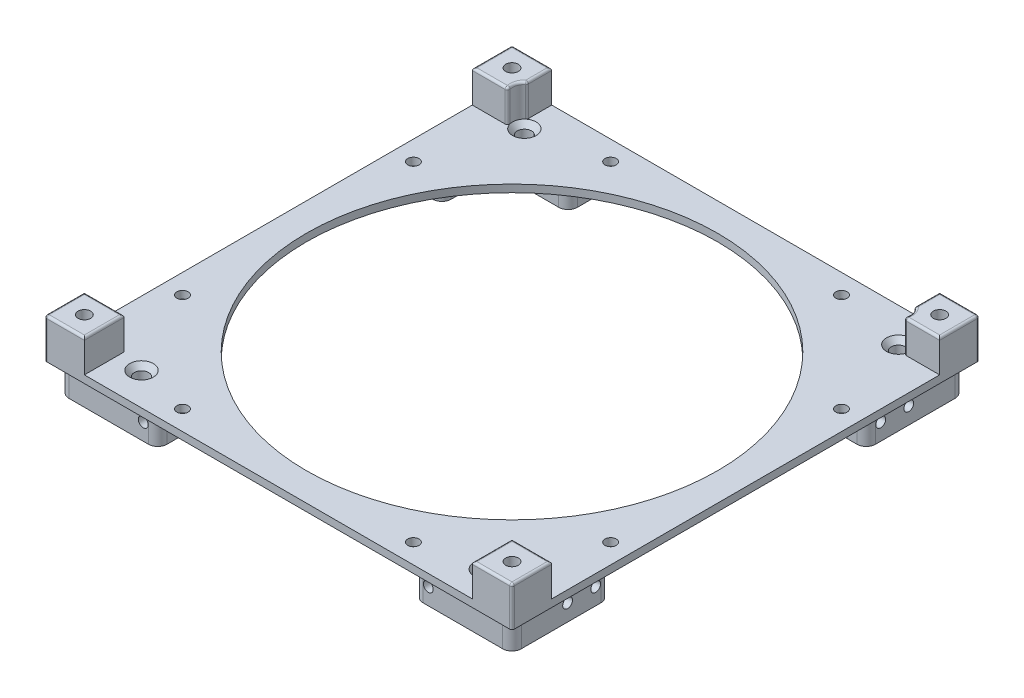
ISO-10303-21;
HEADER;
FILE_DESCRIPTION(('STEP AP214'),'2;1');
FILE_NAME('part.step','',(''),(''),'','','');
FILE_SCHEMA(('AUTOMOTIVE_DESIGN { 1 0 10303 214 1 1 1 1 }'));
ENDSEC;
DATA;
#1=APPLICATION_CONTEXT('core data for automotive mechanical design processes');
#2=APPLICATION_PROTOCOL_DEFINITION('international standard','automotive_design',2000,#1);
#3=PRODUCT_CONTEXT('',#1,'mechanical');
#4=PRODUCT('Part','Part','',(#3));
#5=PRODUCT_RELATED_PRODUCT_CATEGORY('part','',(#4));
#6=PRODUCT_DEFINITION_FORMATION('','',#4);
#7=PRODUCT_DEFINITION_CONTEXT('part definition',#1,'design');
#8=PRODUCT_DEFINITION('design','',#6,#7);
#9=PRODUCT_DEFINITION_SHAPE('','',#8);
#10=(LENGTH_UNIT() NAMED_UNIT(*) SI_UNIT(.MILLI.,.METRE.));
#11=(NAMED_UNIT(*) PLANE_ANGLE_UNIT() SI_UNIT($,.RADIAN.));
#12=(NAMED_UNIT(*) SI_UNIT($,.STERADIAN.) SOLID_ANGLE_UNIT());
#13=UNCERTAINTY_MEASURE_WITH_UNIT(LENGTH_MEASURE(1.E-05),#10,'distance_accuracy_value','');
#14=(GEOMETRIC_REPRESENTATION_CONTEXT(3) GLOBAL_UNCERTAINTY_ASSIGNED_CONTEXT((#13)) GLOBAL_UNIT_ASSIGNED_CONTEXT((#10,
#11,#12)) REPRESENTATION_CONTEXT('',''));
#15=CARTESIAN_POINT('',(0.,0.,0.));
#16=DIRECTION('',(0.,0.,1.));
#17=DIRECTION('',(1.,0.,0.));
#18=AXIS2_PLACEMENT_3D('',#15,#16,#17);
#19=CARTESIAN_POINT('',(27.4,-6.,48.4));
#20=DIRECTION('',(0.,0.,-1.));
#21=DIRECTION('',(-1.,0.,0.));
#22=AXIS2_PLACEMENT_3D('',#19,#20,#21);
#23=PLANE('',#22);
#24=DIRECTION('',(-1.,0.,0.));
#25=VECTOR('',#24,1.);
#26=CARTESIAN_POINT('',(27.4,-6.,48.4));
#27=LINE('',#26,#25);
#28=CARTESIAN_POINT('',(46.4,-6.,48.4));
#29=VERTEX_POINT('',#28);
#30=CARTESIAN_POINT('',(29.4,-6.,48.4));
#31=VERTEX_POINT('',#30);
#32=EDGE_CURVE('E1236',#29,#31,#27,.T.);
#33=ORIENTED_EDGE('',*,*,#32,.F.);
#34=DIRECTION('',(0.,1.,0.));
#35=VECTOR('',#34,1.);
#36=CARTESIAN_POINT('',(46.4,-6.,48.4));
#37=LINE('',#36,#35);
#38=CARTESIAN_POINT('',(46.4,0.,48.4));
#39=VERTEX_POINT('',#38);
#40=EDGE_CURVE('E702',#29,#39,#37,.T.);
#41=ORIENTED_EDGE('',*,*,#40,.T.);
#42=DIRECTION('',(-1.,0.,0.));
#43=VECTOR('',#42,1.);
#44=CARTESIAN_POINT('',(27.4,0.,48.4));
#45=LINE('',#44,#43);
#46=CARTESIAN_POINT('',(29.4,0.,48.4));
#47=VERTEX_POINT('',#46);
#48=EDGE_CURVE('E1230',#39,#47,#45,.T.);
#49=ORIENTED_EDGE('',*,*,#48,.T.);
#50=DIRECTION('',(0.,1.,0.));
#51=VECTOR('',#50,1.);
#52=CARTESIAN_POINT('',(29.4,-6.,48.4));
#53=LINE('',#52,#51);
#54=EDGE_CURVE('E700',#47,#31,#53,.F.);
#55=ORIENTED_EDGE('',*,*,#54,.T.);
#56=EDGE_LOOP('',(#33,#41,#49,#55));
#57=FACE_BOUND('',#56,.T.);
#58=CARTESIAN_POINT('',(30.5,-2.44745439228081,48.4));
#59=DIRECTION('',(0.,0.,1.));
#60=DIRECTION('',(1.,0.,0.));
#61=AXIS2_PLACEMENT_3D('',#58,#59,#60);
#62=CIRCLE('',#61,1.05);
#63=CARTESIAN_POINT('',(31.55,-2.44745439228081,48.4));
#64=VERTEX_POINT('',#63);
#65=EDGE_CURVE('E2186',#64,#64,#62,.T.);
#66=ORIENTED_EDGE('',*,*,#65,.F.);
#67=EDGE_LOOP('',(#66));
#68=FACE_BOUND('',#67,.T.);
#69=ADVANCED_FACE('F40',(#57,#68),#23,.F.);
#70=CARTESIAN_POINT('',(48.4,-6.,48.4));
#71=DIRECTION('',(-1.,0.,0.));
#72=DIRECTION('',(0.,0.,1.));
#73=AXIS2_PLACEMENT_3D('',#70,#71,#72);
#74=PLANE('',#73);
#75=DIRECTION('',(0.,0.,1.));
#76=VECTOR('',#75,1.);
#77=CARTESIAN_POINT('',(48.4,0.,48.4));
#78=LINE('',#77,#76);
#79=CARTESIAN_POINT('',(48.4,0.,29.4));
#80=VERTEX_POINT('',#79);
#81=CARTESIAN_POINT('',(48.4,0.,46.4));
#82=VERTEX_POINT('',#81);
#83=EDGE_CURVE('E1245',#80,#82,#78,.T.);
#84=ORIENTED_EDGE('',*,*,#83,.T.);
#85=DIRECTION('',(0.,1.,0.));
#86=VECTOR('',#85,1.);
#87=CARTESIAN_POINT('',(48.4,-6.,46.4));
#88=LINE('',#87,#86);
#89=CARTESIAN_POINT('',(48.4,-6.,46.4));
#90=VERTEX_POINT('',#89);
#91=EDGE_CURVE('E708',#82,#90,#88,.F.);
#92=ORIENTED_EDGE('',*,*,#91,.T.);
#93=DIRECTION('',(0.,0.,1.));
#94=VECTOR('',#93,1.);
#95=CARTESIAN_POINT('',(48.4,-6.,48.4));
#96=LINE('',#95,#94);
#97=CARTESIAN_POINT('',(48.4,-6.,29.4));
#98=VERTEX_POINT('',#97);
#99=EDGE_CURVE('E1233',#98,#90,#96,.T.);
#100=ORIENTED_EDGE('',*,*,#99,.F.);
#101=DIRECTION('',(0.,1.,0.));
#102=VECTOR('',#101,1.);
#103=CARTESIAN_POINT('',(48.4,-6.,29.4));
#104=LINE('',#103,#102);
#105=EDGE_CURVE('E705',#98,#80,#104,.T.);
#106=ORIENTED_EDGE('',*,*,#105,.T.);
#107=EDGE_LOOP('',(#84,#92,#100,#106));
#108=FACE_BOUND('',#107,.T.);
#109=CARTESIAN_POINT('',(48.4,-2.45,30.5));
#110=DIRECTION('',(1.,0.,0.));
#111=DIRECTION('',(0.,0.,-1.));
#112=AXIS2_PLACEMENT_3D('',#109,#110,#111);
#113=CIRCLE('',#112,1.05);
#114=CARTESIAN_POINT('',(48.4,-2.45,29.45));
#115=VERTEX_POINT('',#114);
#116=EDGE_CURVE('E1674',#115,#115,#113,.T.);
#117=ORIENTED_EDGE('',*,*,#116,.F.);
#118=EDGE_LOOP('',(#117));
#119=FACE_BOUND('',#118,.T.);
#120=CARTESIAN_POINT('',(48.4,-2.45,36.5));
#121=DIRECTION('',(1.,0.,0.));
#122=DIRECTION('',(0.,0.,-1.));
#123=AXIS2_PLACEMENT_3D('',#120,#121,#122);
#124=CIRCLE('',#123,1.05);
#125=CARTESIAN_POINT('',(48.4,-2.45,35.45));
#126=VERTEX_POINT('',#125);
#127=EDGE_CURVE('E1675',#126,#126,#124,.T.);
#128=ORIENTED_EDGE('',*,*,#127,.F.);
#129=EDGE_LOOP('',(#128));
#130=FACE_BOUND('',#129,.T.);
#131=ADVANCED_FACE('F944',(#108,#119,#130),#74,.F.);
#132=CARTESIAN_POINT('',(48.4,-6.,-48.4));
#133=DIRECTION('',(0.,0.,1.));
#134=DIRECTION('',(1.,0.,0.));
#135=AXIS2_PLACEMENT_3D('',#132,#133,#134);
#136=PLANE('',#135);
#137=DIRECTION('',(1.,0.,0.));
#138=VECTOR('',#137,1.);
#139=CARTESIAN_POINT('',(48.4,0.,-48.4));
#140=LINE('',#139,#138);
#141=CARTESIAN_POINT('',(29.4,0.,-48.4));
#142=VERTEX_POINT('',#141);
#143=CARTESIAN_POINT('',(46.4,0.,-48.4));
#144=VERTEX_POINT('',#143);
#145=EDGE_CURVE('E1206',#142,#144,#140,.T.);
#146=ORIENTED_EDGE('',*,*,#145,.T.);
#147=DIRECTION('',(0.,1.,0.));
#148=VECTOR('',#147,1.);
#149=CARTESIAN_POINT('',(46.4,-6.,-48.4));
#150=LINE('',#149,#148);
#151=CARTESIAN_POINT('',(46.4,-6.,-48.4));
#152=VERTEX_POINT('',#151);
#153=EDGE_CURVE('E729',#144,#152,#150,.F.);
#154=ORIENTED_EDGE('',*,*,#153,.T.);
#155=DIRECTION('',(1.,0.,0.));
#156=VECTOR('',#155,1.);
#157=CARTESIAN_POINT('',(48.4,-6.,-48.4));
#158=LINE('',#157,#156);
#159=CARTESIAN_POINT('',(29.4,-6.,-48.4));
#160=VERTEX_POINT('',#159);
#161=EDGE_CURVE('E1212',#160,#152,#158,.T.);
#162=ORIENTED_EDGE('',*,*,#161,.F.);
#163=DIRECTION('',(0.,1.,0.));
#164=VECTOR('',#163,1.);
#165=CARTESIAN_POINT('',(29.4,-6.,-48.4));
#166=LINE('',#165,#164);
#167=EDGE_CURVE('E726',#160,#142,#166,.T.);
#168=ORIENTED_EDGE('',*,*,#167,.T.);
#169=EDGE_LOOP('',(#146,#154,#162,#168));
#170=FACE_BOUND('',#169,.T.);
#171=CARTESIAN_POINT('',(30.5,-2.44745439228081,-48.4));
#172=DIRECTION('',(0.,0.,-1.));
#173=DIRECTION('',(-1.,0.,0.));
#174=AXIS2_PLACEMENT_3D('',#171,#172,#173);
#175=CIRCLE('',#174,1.05);
#176=CARTESIAN_POINT('',(29.45,-2.44745439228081,-48.4));
#177=VERTEX_POINT('',#176);
#178=EDGE_CURVE('E1723',#177,#177,#175,.T.);
#179=ORIENTED_EDGE('',*,*,#178,.F.);
#180=EDGE_LOOP('',(#179));
#181=FACE_BOUND('',#180,.T.);
#182=ADVANCED_FACE('F950',(#170,#181),#136,.F.);
#183=CARTESIAN_POINT('',(48.4,-6.,-27.4));
#184=DIRECTION('',(-1.,0.,0.));
#185=DIRECTION('',(0.,0.,1.));
#186=AXIS2_PLACEMENT_3D('',#183,#184,#185);
#187=PLANE('',#186);
#188=CARTESIAN_POINT('',(48.4,-2.45,-30.5));
#189=DIRECTION('',(1.,0.,0.));
#190=DIRECTION('',(0.,0.,-1.));
#191=AXIS2_PLACEMENT_3D('',#188,#189,#190);
#192=CIRCLE('',#191,1.05);
#193=CARTESIAN_POINT('',(48.4,-2.45,-31.55));
#194=VERTEX_POINT('',#193);
#195=EDGE_CURVE('E1734',#194,#194,#192,.T.);
#196=ORIENTED_EDGE('',*,*,#195,.F.);
#197=EDGE_LOOP('',(#196));
#198=FACE_BOUND('',#197,.T.);
#199=DIRECTION('',(0.,0.,1.));
#200=VECTOR('',#199,1.);
#201=CARTESIAN_POINT('',(48.4,-6.,-27.4));
#202=LINE('',#201,#200);
#203=CARTESIAN_POINT('',(48.4,-6.,-46.4));
#204=VERTEX_POINT('',#203);
#205=CARTESIAN_POINT('',(48.4,-6.,-29.4));
#206=VERTEX_POINT('',#205);
#207=EDGE_CURVE('E1202',#204,#206,#202,.T.);
#208=ORIENTED_EDGE('',*,*,#207,.F.);
#209=DIRECTION('',(0.,1.,0.));
#210=VECTOR('',#209,1.);
#211=CARTESIAN_POINT('',(48.4,-6.,-46.4));
#212=LINE('',#211,#210);
#213=CARTESIAN_POINT('',(48.4,0.,-46.4));
#214=VERTEX_POINT('',#213);
#215=EDGE_CURVE('E723',#204,#214,#212,.T.);
#216=ORIENTED_EDGE('',*,*,#215,.T.);
#217=DIRECTION('',(0.,0.,1.));
#218=VECTOR('',#217,1.);
#219=CARTESIAN_POINT('',(48.4,0.,-27.4));
#220=LINE('',#219,#218);
#221=CARTESIAN_POINT('',(48.4,0.,-29.4));
#222=VERTEX_POINT('',#221);
#223=EDGE_CURVE('E1201',#214,#222,#220,.T.);
#224=ORIENTED_EDGE('',*,*,#223,.T.);
#225=DIRECTION('',(0.,1.,0.));
#226=VECTOR('',#225,1.);
#227=CARTESIAN_POINT('',(48.4,-6.,-29.4));
#228=LINE('',#227,#226);
#229=EDGE_CURVE('E721',#222,#206,#228,.F.);
#230=ORIENTED_EDGE('',*,*,#229,.T.);
#231=EDGE_LOOP('',(#208,#216,#224,#230));
#232=FACE_BOUND('',#231,.T.);
#233=CARTESIAN_POINT('',(48.4,-2.45,-36.5));
#234=DIRECTION('',(1.,0.,0.));
#235=DIRECTION('',(0.,0.,-1.));
#236=AXIS2_PLACEMENT_3D('',#233,#234,#235);
#237=CIRCLE('',#236,1.05);
#238=CARTESIAN_POINT('',(48.4,-2.45,-37.55));
#239=VERTEX_POINT('',#238);
#240=EDGE_CURVE('E1729',#239,#239,#237,.T.);
#241=ORIENTED_EDGE('',*,*,#240,.F.);
#242=EDGE_LOOP('',(#241));
#243=FACE_BOUND('',#242,.T.);
#244=ADVANCED_FACE('F1014',(#198,#232,#243),#187,.F.);
#245=CARTESIAN_POINT('',(-50.,8.5,-41.5));
#246=DIRECTION('',(0.,0.,-1.));
#247=DIRECTION('',(-1.,0.,0.));
#248=AXIS2_PLACEMENT_3D('',#245,#246,#247);
#249=PLANE('',#248);
#250=DIRECTION('',(0.,1.,0.));
#251=VECTOR('',#250,1.);
#252=CARTESIAN_POINT('',(-42.9837828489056,8.5,-41.5));
#253=LINE('',#252,#251);
#254=CARTESIAN_POINT('',(-42.9837828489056,1.6,-41.5));
#255=VERTEX_POINT('',#254);
#256=CARTESIAN_POINT('',(-42.9837828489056,8.,-41.5));
#257=VERTEX_POINT('',#256);
#258=EDGE_CURVE('E1473',#255,#257,#253,.T.);
#259=ORIENTED_EDGE('',*,*,#258,.T.);
#260=DIRECTION('',(1.,0.,0.));
#261=VECTOR('',#260,1.);
#262=CARTESIAN_POINT('',(-50.,8.,-41.5));
#263=LINE('',#262,#261);
#264=CARTESIAN_POINT('',(-50.,8.,-41.5));
#265=VERTEX_POINT('',#264);
#266=EDGE_CURVE('E1475',#257,#265,#263,.F.);
#267=ORIENTED_EDGE('',*,*,#266,.T.);
#268=DIRECTION('',(0.,-1.,0.));
#269=VECTOR('',#268,1.);
#270=CARTESIAN_POINT('',(-50.,8.5,-41.5));
#271=LINE('',#270,#269);
#272=CARTESIAN_POINT('',(-50.,1.6,-41.5));
#273=VERTEX_POINT('',#272);
#274=EDGE_CURVE('E1275',#265,#273,#271,.T.);
#275=ORIENTED_EDGE('',*,*,#274,.T.);
#276=DIRECTION('',(-1.,0.,0.));
#277=VECTOR('',#276,1.);
#278=CARTESIAN_POINT('',(0.,1.6,-41.5));
#279=LINE('',#278,#277);
#280=EDGE_CURVE('E604',#255,#273,#279,.T.);
#281=ORIENTED_EDGE('',*,*,#280,.F.);
#282=EDGE_LOOP('',(#259,#267,#275,#281));
#283=FACE_BOUND('',#282,.T.);
#284=ADVANCED_FACE('F1010',(#283),#249,.F.);
#285=CARTESIAN_POINT('',(-41.5,8.5,-50.));
#286=DIRECTION('',(-1.,0.,0.));
#287=DIRECTION('',(0.,0.,1.));
#288=AXIS2_PLACEMENT_3D('',#285,#286,#287);
#289=PLANE('',#288);
#290=DIRECTION('',(0.,-1.,0.));
#291=VECTOR('',#290,1.);
#292=CARTESIAN_POINT('',(-41.5,8.5,-50.));
#293=LINE('',#292,#291);
#294=CARTESIAN_POINT('',(-41.5,8.,-50.));
#295=VERTEX_POINT('',#294);
#296=CARTESIAN_POINT('',(-41.5,1.6,-50.));
#297=VERTEX_POINT('',#296);
#298=EDGE_CURVE('E1273',#295,#297,#293,.T.);
#299=ORIENTED_EDGE('',*,*,#298,.F.);
#300=DIRECTION('',(0.,0.,-1.));
#301=VECTOR('',#300,1.);
#302=CARTESIAN_POINT('',(-41.5,8.,-44.7443737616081));
#303=LINE('',#302,#301);
#304=CARTESIAN_POINT('',(-41.5,8.,-44.9878938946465));
#305=VERTEX_POINT('',#304);
#306=EDGE_CURVE('E1465',#295,#305,#303,.F.);
#307=ORIENTED_EDGE('',*,*,#306,.T.);
#308=DIRECTION('',(0.,1.,0.));
#309=VECTOR('',#308,1.);
#310=CARTESIAN_POINT('',(-41.5,1.6,-44.9878938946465));
#311=LINE('',#310,#309);
#312=CARTESIAN_POINT('',(-41.5,1.6,-44.9878938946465));
#313=VERTEX_POINT('',#312);
#314=EDGE_CURVE('E1289',#305,#313,#311,.F.);
#315=ORIENTED_EDGE('',*,*,#314,.T.);
#316=DIRECTION('',(0.,0.,1.));
#317=VECTOR('',#316,1.);
#318=CARTESIAN_POINT('',(-41.5,1.6,0.));
#319=LINE('',#318,#317);
#320=EDGE_CURVE('E1276',#297,#313,#319,.T.);
#321=ORIENTED_EDGE('',*,*,#320,.F.);
#322=EDGE_LOOP('',(#299,#307,#315,#321));
#323=FACE_BOUND('',#322,.T.);
#324=ADVANCED_FACE('F1002',(#323),#289,.F.);
#325=CARTESIAN_POINT('',(41.5,8.5,-50.));
#326=DIRECTION('',(1.,0.,0.));
#327=DIRECTION('',(0.,0.,-1.));
#328=AXIS2_PLACEMENT_3D('',#325,#326,#327);
#329=PLANE('',#328);
#330=DIRECTION('',(0.,1.,0.));
#331=VECTOR('',#330,1.);
#332=CARTESIAN_POINT('',(41.5,8.5,-44.9353155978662));
#333=LINE('',#332,#331);
#334=CARTESIAN_POINT('',(41.5,1.6,-44.9353155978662));
#335=VERTEX_POINT('',#334);
#336=CARTESIAN_POINT('',(41.5,8.,-44.9353155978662));
#337=VERTEX_POINT('',#336);
#338=EDGE_CURVE('E2055',#335,#337,#333,.T.);
#339=ORIENTED_EDGE('',*,*,#338,.T.);
#340=DIRECTION('',(0.,0.,1.));
#341=VECTOR('',#340,1.);
#342=CARTESIAN_POINT('',(41.5,8.,-50.));
#343=LINE('',#342,#341);
#344=CARTESIAN_POINT('',(41.5,8.,-50.));
#345=VERTEX_POINT('',#344);
#346=EDGE_CURVE('E2052',#337,#345,#343,.F.);
#347=ORIENTED_EDGE('',*,*,#346,.T.);
#348=DIRECTION('',(0.,-1.,0.));
#349=VECTOR('',#348,1.);
#350=CARTESIAN_POINT('',(41.5,8.5,-50.));
#351=LINE('',#350,#349);
#352=CARTESIAN_POINT('',(41.5,1.6,-50.));
#353=VERTEX_POINT('',#352);
#354=EDGE_CURVE('E1265',#345,#353,#351,.T.);
#355=ORIENTED_EDGE('',*,*,#354,.T.);
#356=DIRECTION('',(0.,0.,-1.));
#357=VECTOR('',#356,1.);
#358=CARTESIAN_POINT('',(41.5,1.6,0.));
#359=LINE('',#358,#357);
#360=EDGE_CURVE('E1271',#335,#353,#359,.T.);
#361=ORIENTED_EDGE('',*,*,#360,.F.);
#362=EDGE_LOOP('',(#339,#347,#355,#361));
#363=FACE_BOUND('',#362,.T.);
#364=ADVANCED_FACE('F998',(#363),#329,.F.);
#365=CARTESIAN_POINT('',(50.,8.5,-41.5));
#366=DIRECTION('',(0.,0.,-1.));
#367=DIRECTION('',(-1.,0.,0.));
#368=AXIS2_PLACEMENT_3D('',#365,#366,#367);
#369=PLANE('',#368);
#370=DIRECTION('',(0.,-1.,0.));
#371=VECTOR('',#370,1.);
#372=CARTESIAN_POINT('',(50.,8.5,-41.5));
#373=LINE('',#372,#371);
#374=CARTESIAN_POINT('',(50.,8.,-41.5));
#375=VERTEX_POINT('',#374);
#376=CARTESIAN_POINT('',(50.,1.6,-41.5));
#377=VERTEX_POINT('',#376);
#378=EDGE_CURVE('E1263',#375,#377,#373,.T.);
#379=ORIENTED_EDGE('',*,*,#378,.F.);
#380=DIRECTION('',(1.,0.,0.));
#381=VECTOR('',#380,1.);
#382=CARTESIAN_POINT('',(50.,8.,-41.5));
#383=LINE('',#382,#381);
#384=CARTESIAN_POINT('',(42.9237828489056,8.,-41.5));
#385=VERTEX_POINT('',#384);
#386=EDGE_CURVE('E1438',#375,#385,#383,.F.);
#387=ORIENTED_EDGE('',*,*,#386,.T.);
#388=DIRECTION('',(0.,1.,0.));
#389=VECTOR('',#388,1.);
#390=CARTESIAN_POINT('',(42.9237828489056,1.6,-41.5));
#391=LINE('',#390,#389);
#392=CARTESIAN_POINT('',(42.9237828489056,1.6,-41.5));
#393=VERTEX_POINT('',#392);
#394=EDGE_CURVE('E1431',#385,#393,#391,.F.);
#395=ORIENTED_EDGE('',*,*,#394,.T.);
#396=DIRECTION('',(-1.,0.,0.));
#397=VECTOR('',#396,1.);
#398=CARTESIAN_POINT('',(0.,1.6,-41.5));
#399=LINE('',#398,#397);
#400=EDGE_CURVE('E1268',#377,#393,#399,.T.);
#401=ORIENTED_EDGE('',*,*,#400,.F.);
#402=EDGE_LOOP('',(#379,#387,#395,#401));
#403=FACE_BOUND('',#402,.T.);
#404=ADVANCED_FACE('F994',(#403),#369,.F.);
#405=CARTESIAN_POINT('',(0.,0.,0.));
#406=DIRECTION('',(0.,1.,0.));
#407=DIRECTION('',(0.,0.,1.));
#408=AXIS2_PLACEMENT_3D('',#405,#406,#407);
#409=PLANE('',#408);
#410=CARTESIAN_POINT('',(-45.8,0.,24.7));
#411=DIRECTION('',(0.,1.,0.));
#412=DIRECTION('',(0.,0.,1.));
#413=AXIS2_PLACEMENT_3D('',#410,#411,#412);
#414=CIRCLE('',#413,1.2);
#415=CARTESIAN_POINT('',(-45.8,0.,25.9));
#416=VERTEX_POINT('',#415);
#417=EDGE_CURVE('E2141',#416,#416,#414,.T.);
#418=ORIENTED_EDGE('',*,*,#417,.T.);
#419=EDGE_LOOP('',(#418));
#420=FACE_BOUND('',#419,.T.);
#421=CARTESIAN_POINT('',(-24.7,0.,45.8));
#422=DIRECTION('',(0.,1.,0.));
#423=DIRECTION('',(0.,0.,1.));
#424=AXIS2_PLACEMENT_3D('',#421,#422,#423);
#425=CIRCLE('',#424,1.2);
#426=CARTESIAN_POINT('',(-24.7,0.,47.));
#427=VERTEX_POINT('',#426);
#428=EDGE_CURVE('E2147',#427,#427,#425,.T.);
#429=ORIENTED_EDGE('',*,*,#428,.T.);
#430=EDGE_LOOP('',(#429));
#431=FACE_BOUND('',#430,.T.);
#432=CARTESIAN_POINT('',(45.8,0.,24.7));
#433=DIRECTION('',(0.,1.,0.));
#434=DIRECTION('',(0.,0.,1.));
#435=AXIS2_PLACEMENT_3D('',#432,#433,#434);
#436=CIRCLE('',#435,1.2);
#437=CARTESIAN_POINT('',(45.8,0.,25.9));
#438=VERTEX_POINT('',#437);
#439=EDGE_CURVE('E2153',#438,#438,#436,.T.);
#440=ORIENTED_EDGE('',*,*,#439,.T.);
#441=EDGE_LOOP('',(#440));
#442=FACE_BOUND('',#441,.T.);
#443=CARTESIAN_POINT('',(24.7,0.,45.8));
#444=DIRECTION('',(0.,1.,0.));
#445=DIRECTION('',(0.,0.,1.));
#446=AXIS2_PLACEMENT_3D('',#443,#444,#445);
#447=CIRCLE('',#446,1.2);
#448=CARTESIAN_POINT('',(24.7,0.,47.));
#449=VERTEX_POINT('',#448);
#450=EDGE_CURVE('E2159',#449,#449,#447,.T.);
#451=ORIENTED_EDGE('',*,*,#450,.T.);
#452=EDGE_LOOP('',(#451));
#453=FACE_BOUND('',#452,.T.);
#454=CARTESIAN_POINT('',(45.8,0.,-24.7));
#455=DIRECTION('',(0.,1.,0.));
#456=DIRECTION('',(0.,0.,1.));
#457=AXIS2_PLACEMENT_3D('',#454,#455,#456);
#458=CIRCLE('',#457,1.2);
#459=CARTESIAN_POINT('',(45.8,0.,-23.5));
#460=VERTEX_POINT('',#459);
#461=EDGE_CURVE('E2165',#460,#460,#458,.T.);
#462=ORIENTED_EDGE('',*,*,#461,.T.);
#463=EDGE_LOOP('',(#462));
#464=FACE_BOUND('',#463,.T.);
#465=CARTESIAN_POINT('',(24.7,0.,-45.8));
#466=DIRECTION('',(0.,1.,0.));
#467=DIRECTION('',(0.,0.,1.));
#468=AXIS2_PLACEMENT_3D('',#465,#466,#467);
#469=CIRCLE('',#468,1.2);
#470=CARTESIAN_POINT('',(24.7,0.,-44.6));
#471=VERTEX_POINT('',#470);
#472=EDGE_CURVE('E2171',#471,#471,#469,.T.);
#473=ORIENTED_EDGE('',*,*,#472,.T.);
#474=EDGE_LOOP('',(#473));
#475=FACE_BOUND('',#474,.T.);
#476=CARTESIAN_POINT('',(-45.8,0.,-24.7));
#477=DIRECTION('',(0.,1.,0.));
#478=DIRECTION('',(0.,0.,1.));
#479=AXIS2_PLACEMENT_3D('',#476,#477,#478);
#480=CIRCLE('',#479,1.2);
#481=CARTESIAN_POINT('',(-45.8,0.,-23.5));
#482=VERTEX_POINT('',#481);
#483=EDGE_CURVE('E2177',#482,#482,#480,.T.);
#484=ORIENTED_EDGE('',*,*,#483,.T.);
#485=EDGE_LOOP('',(#484));
#486=FACE_BOUND('',#485,.T.);
#487=CARTESIAN_POINT('',(-24.7,0.,-45.8));
#488=DIRECTION('',(0.,1.,0.));
#489=DIRECTION('',(0.,0.,1.));
#490=AXIS2_PLACEMENT_3D('',#487,#488,#489);
#491=CIRCLE('',#490,1.2);
#492=CARTESIAN_POINT('',(-24.7,0.,-44.6));
#493=VERTEX_POINT('',#492);
#494=EDGE_CURVE('E2183',#493,#493,#491,.T.);
#495=ORIENTED_EDGE('',*,*,#494,.T.);
#496=EDGE_LOOP('',(#495));
#497=FACE_BOUND('',#496,.T.);
#498=DIRECTION('',(1.,0.,0.));
#499=VECTOR('',#498,1.);
#500=CARTESIAN_POINT('',(-42.4,0.,39.4));
#501=LINE('',#500,#499);
#502=CARTESIAN_POINT('',(-39.2,0.,39.4));
#503=VERTEX_POINT('',#502);
#504=CARTESIAN_POINT('',(-29.4,0.,39.4));
#505=VERTEX_POINT('',#504);
#506=EDGE_CURVE('E1786',#503,#505,#501,.T.);
#507=ORIENTED_EDGE('',*,*,#506,.F.);
#508=CARTESIAN_POINT('',(-39.2,0.,36.2));
#509=DIRECTION('',(0.,1.,0.));
#510=DIRECTION('',(0.,0.,1.));
#511=AXIS2_PLACEMENT_3D('',#508,#509,#510);
#512=CIRCLE('',#511,3.2);
#513=CARTESIAN_POINT('',(-42.4,0.,36.2));
#514=VERTEX_POINT('',#513);
#515=EDGE_CURVE('E855',#503,#514,#512,.F.);
#516=ORIENTED_EDGE('',*,*,#515,.T.);
#517=DIRECTION('',(0.,0.,1.));
#518=VECTOR('',#517,1.);
#519=CARTESIAN_POINT('',(-42.4,0.,39.4));
#520=LINE('',#519,#518);
#521=CARTESIAN_POINT('',(-42.4,0.,29.4));
#522=VERTEX_POINT('',#521);
#523=EDGE_CURVE('E1778',#522,#514,#520,.T.);
#524=ORIENTED_EDGE('',*,*,#523,.F.);
#525=CARTESIAN_POINT('',(-44.4,0.,29.4));
#526=DIRECTION('',(0.,1.,0.));
#527=DIRECTION('',(0.,0.,1.));
#528=AXIS2_PLACEMENT_3D('',#525,#526,#527);
#529=CIRCLE('',#528,2.);
#530=CARTESIAN_POINT('',(-44.4,0.,27.4));
#531=VERTEX_POINT('',#530);
#532=EDGE_CURVE('E835',#522,#531,#529,.T.);
#533=ORIENTED_EDGE('',*,*,#532,.T.);
#534=DIRECTION('',(-1.,0.,0.));
#535=VECTOR('',#534,1.);
#536=CARTESIAN_POINT('',(-48.4,0.,27.4));
#537=LINE('',#536,#535);
#538=CARTESIAN_POINT('',(-46.4,0.,27.4));
#539=VERTEX_POINT('',#538);
#540=EDGE_CURVE('E1179',#531,#539,#537,.T.);
#541=ORIENTED_EDGE('',*,*,#540,.T.);
#542=CARTESIAN_POINT('',(-46.4,0.,29.4));
#543=DIRECTION('',(0.,1.,0.));
#544=DIRECTION('',(0.,0.,1.));
#545=AXIS2_PLACEMENT_3D('',#542,#543,#544);
#546=CIRCLE('',#545,2.);
#547=CARTESIAN_POINT('',(-48.4,0.,29.4));
#548=VERTEX_POINT('',#547);
#549=EDGE_CURVE('E837',#539,#548,#546,.T.);
#550=ORIENTED_EDGE('',*,*,#549,.T.);
#551=DIRECTION('',(0.,0.,1.));
#552=VECTOR('',#551,1.);
#553=CARTESIAN_POINT('',(-48.4,0.,48.4));
#554=LINE('',#553,#552);
#555=CARTESIAN_POINT('',(-48.4,0.,46.4));
#556=VERTEX_POINT('',#555);
#557=EDGE_CURVE('E1191',#548,#556,#554,.T.);
#558=ORIENTED_EDGE('',*,*,#557,.T.);
#559=CARTESIAN_POINT('',(-46.4,0.,46.4));
#560=DIRECTION('',(0.,1.,0.));
#561=DIRECTION('',(0.,0.,1.));
#562=AXIS2_PLACEMENT_3D('',#559,#560,#561);
#563=CIRCLE('',#562,2.);
#564=CARTESIAN_POINT('',(-46.4,0.,48.4));
#565=VERTEX_POINT('',#564);
#566=EDGE_CURVE('E804',#556,#565,#563,.T.);
#567=ORIENTED_EDGE('',*,*,#566,.T.);
#568=DIRECTION('',(1.,0.,0.));
#569=VECTOR('',#568,1.);
#570=CARTESIAN_POINT('',(-27.4,0.,48.4));
#571=LINE('',#570,#569);
#572=CARTESIAN_POINT('',(-29.4,0.,48.4));
#573=VERTEX_POINT('',#572);
#574=EDGE_CURVE('E1155',#565,#573,#571,.T.);
#575=ORIENTED_EDGE('',*,*,#574,.T.);
#576=CARTESIAN_POINT('',(-29.4,0.,46.4));
#577=DIRECTION('',(0.,1.,0.));
#578=DIRECTION('',(0.,0.,1.));
#579=AXIS2_PLACEMENT_3D('',#576,#577,#578);
#580=CIRCLE('',#579,2.);
#581=CARTESIAN_POINT('',(-27.4,0.,46.4));
#582=VERTEX_POINT('',#581);
#583=EDGE_CURVE('E833',#573,#582,#580,.T.);
#584=ORIENTED_EDGE('',*,*,#583,.T.);
#585=DIRECTION('',(0.,0.,-1.));
#586=VECTOR('',#585,1.);
#587=CARTESIAN_POINT('',(-27.4,0.,48.4));
#588=LINE('',#587,#586);
#589=CARTESIAN_POINT('',(-27.4,0.,41.4));
#590=VERTEX_POINT('',#589);
#591=EDGE_CURVE('E1151',#582,#590,#588,.T.);
#592=ORIENTED_EDGE('',*,*,#591,.T.);
#593=CARTESIAN_POINT('',(-29.4,0.,41.4));
#594=DIRECTION('',(0.,1.,0.));
#595=DIRECTION('',(0.,0.,1.));
#596=AXIS2_PLACEMENT_3D('',#593,#594,#595);
#597=CIRCLE('',#596,2.);
#598=EDGE_CURVE('E810',#590,#505,#597,.T.);
#599=ORIENTED_EDGE('',*,*,#598,.T.);
#600=EDGE_LOOP('',(#507,#516,#524,#533,#541,#550,#558,#567,#575,#584,#592,#599));
#601=FACE_BOUND('',#600,.T.);
#602=DIRECTION('',(0.,0.,1.));
#603=VECTOR('',#602,1.);
#604=CARTESIAN_POINT('',(-42.4,0.,-39.4));
#605=LINE('',#604,#603);
#606=CARTESIAN_POINT('',(-42.4,0.,-36.2));
#607=VERTEX_POINT('',#606);
#608=CARTESIAN_POINT('',(-42.4,0.,-29.4));
#609=VERTEX_POINT('',#608);
#610=EDGE_CURVE('E1803',#607,#609,#605,.T.);
#611=ORIENTED_EDGE('',*,*,#610,.F.);
#612=CARTESIAN_POINT('',(-39.2,0.,-36.2));
#613=DIRECTION('',(0.,1.,0.));
#614=DIRECTION('',(0.,0.,1.));
#615=AXIS2_PLACEMENT_3D('',#612,#613,#614);
#616=CIRCLE('',#615,3.2);
#617=CARTESIAN_POINT('',(-39.2,0.,-39.4));
#618=VERTEX_POINT('',#617);
#619=EDGE_CURVE('E849',#607,#618,#616,.F.);
#620=ORIENTED_EDGE('',*,*,#619,.T.);
#621=DIRECTION('',(-1.,0.,0.));
#622=VECTOR('',#621,1.);
#623=CARTESIAN_POINT('',(-42.4,0.,-39.4));
#624=LINE('',#623,#622);
#625=CARTESIAN_POINT('',(-29.4,0.,-39.4));
#626=VERTEX_POINT('',#625);
#627=EDGE_CURVE('E1795',#626,#618,#624,.T.);
#628=ORIENTED_EDGE('',*,*,#627,.F.);
#629=CARTESIAN_POINT('',(-29.4,0.,-41.4));
#630=DIRECTION('',(0.,1.,0.));
#631=DIRECTION('',(0.,0.,1.));
#632=AXIS2_PLACEMENT_3D('',#629,#630,#631);
#633=CIRCLE('',#632,2.);
#634=CARTESIAN_POINT('',(-27.4,0.,-41.4));
#635=VERTEX_POINT('',#634);
#636=EDGE_CURVE('E818',#626,#635,#633,.T.);
#637=ORIENTED_EDGE('',*,*,#636,.T.);
#638=DIRECTION('',(0.,0.,-1.));
#639=VECTOR('',#638,1.);
#640=CARTESIAN_POINT('',(-27.4,0.,-48.4));
#641=LINE('',#640,#639);
#642=CARTESIAN_POINT('',(-27.4,0.,-46.4));
#643=VERTEX_POINT('',#642);
#644=EDGE_CURVE('E1169',#635,#643,#641,.T.);
#645=ORIENTED_EDGE('',*,*,#644,.T.);
#646=CARTESIAN_POINT('',(-29.4,0.,-46.4));
#647=DIRECTION('',(0.,1.,0.));
#648=DIRECTION('',(0.,0.,1.));
#649=AXIS2_PLACEMENT_3D('',#646,#647,#648);
#650=CIRCLE('',#649,2.);
#651=CARTESIAN_POINT('',(-29.4,0.,-48.4));
#652=VERTEX_POINT('',#651);
#653=EDGE_CURVE('E844',#643,#652,#650,.T.);
#654=ORIENTED_EDGE('',*,*,#653,.T.);
#655=DIRECTION('',(-1.,0.,0.));
#656=VECTOR('',#655,1.);
#657=CARTESIAN_POINT('',(-48.4,0.,-48.4));
#658=LINE('',#657,#656);
#659=CARTESIAN_POINT('',(-46.4,0.,-48.4));
#660=VERTEX_POINT('',#659);
#661=EDGE_CURVE('E1165',#652,#660,#658,.T.);
#662=ORIENTED_EDGE('',*,*,#661,.T.);
#663=CARTESIAN_POINT('',(-46.4,0.,-46.4));
#664=DIRECTION('',(0.,1.,0.));
#665=DIRECTION('',(0.,0.,1.));
#666=AXIS2_PLACEMENT_3D('',#663,#664,#665);
#667=CIRCLE('',#666,2.);
#668=CARTESIAN_POINT('',(-48.4,0.,-46.4));
#669=VERTEX_POINT('',#668);
#670=EDGE_CURVE('E802',#660,#669,#667,.T.);
#671=ORIENTED_EDGE('',*,*,#670,.T.);
#672=DIRECTION('',(0.,0.,1.));
#673=VECTOR('',#672,1.);
#674=CARTESIAN_POINT('',(-48.4,0.,-27.4));
#675=LINE('',#674,#673);
#676=CARTESIAN_POINT('',(-48.4,0.,-29.4));
#677=VERTEX_POINT('',#676);
#678=EDGE_CURVE('E1162',#669,#677,#675,.T.);
#679=ORIENTED_EDGE('',*,*,#678,.T.);
#680=CARTESIAN_POINT('',(-46.4,0.,-29.4));
#681=DIRECTION('',(0.,1.,0.));
#682=DIRECTION('',(0.,0.,1.));
#683=AXIS2_PLACEMENT_3D('',#680,#681,#682);
#684=CIRCLE('',#683,2.);
#685=CARTESIAN_POINT('',(-46.4,0.,-27.4));
#686=VERTEX_POINT('',#685);
#687=EDGE_CURVE('E839',#677,#686,#684,.T.);
#688=ORIENTED_EDGE('',*,*,#687,.T.);
#689=DIRECTION('',(1.,0.,0.));
#690=VECTOR('',#689,1.);
#691=CARTESIAN_POINT('',(-48.4,0.,-27.4));
#692=LINE('',#691,#690);
#693=CARTESIAN_POINT('',(-44.4,0.,-27.4));
#694=VERTEX_POINT('',#693);
#695=EDGE_CURVE('E1172',#686,#694,#692,.T.);
#696=ORIENTED_EDGE('',*,*,#695,.T.);
#697=CARTESIAN_POINT('',(-44.4,0.,-29.4));
#698=DIRECTION('',(0.,1.,0.));
#699=DIRECTION('',(0.,0.,1.));
#700=AXIS2_PLACEMENT_3D('',#697,#698,#699);
#701=CIRCLE('',#700,2.);
#702=EDGE_CURVE('E841',#694,#609,#701,.T.);
#703=ORIENTED_EDGE('',*,*,#702,.T.);
#704=EDGE_LOOP('',(#611,#620,#628,#637,#645,#654,#662,#671,#679,#688,#696,#703));
#705=FACE_BOUND('',#704,.T.);
#706=CARTESIAN_POINT('',(0.,0.,0.));
#707=DIRECTION('',(0.,1.,0.));
#708=DIRECTION('',(0.,0.,1.));
#709=AXIS2_PLACEMENT_3D('',#706,#707,#708);
#710=CIRCLE('',#709,44.);
#711=CARTESIAN_POINT('',(0.,0.,44.));
#712=VERTEX_POINT('',#711);
#713=EDGE_CURVE('E1187',#712,#712,#710,.T.);
#714=ORIENTED_EDGE('',*,*,#713,.T.);
#715=EDGE_LOOP('',(#714));
#716=FACE_BOUND('',#715,.T.);
#717=DIRECTION('',(1.,0.,0.));
#718=VECTOR('',#717,1.);
#719=CARTESIAN_POINT('',(-50.,0.,50.));
#720=LINE('',#719,#718);
#721=CARTESIAN_POINT('',(-49.5,0.,50.));
#722=VERTEX_POINT('',#721);
#723=CARTESIAN_POINT('',(49.5,0.,50.));
#724=VERTEX_POINT('',#723);
#725=EDGE_CURVE('E627',#722,#724,#720,.T.);
#726=ORIENTED_EDGE('',*,*,#725,.F.);
#727=CARTESIAN_POINT('',(-49.5,0.,49.5));
#728=DIRECTION('',(0.,1.,0.));
#729=DIRECTION('',(0.,0.,1.));
#730=AXIS2_PLACEMENT_3D('',#727,#728,#729);
#731=CIRCLE('',#730,0.5);
#732=CARTESIAN_POINT('',(-50.,0.,49.5));
#733=VERTEX_POINT('',#732);
#734=EDGE_CURVE('E642',#722,#733,#731,.F.);
#735=ORIENTED_EDGE('',*,*,#734,.T.);
#736=DIRECTION('',(0.,0.,1.));
#737=VECTOR('',#736,1.);
#738=CARTESIAN_POINT('',(-50.,0.,-50.));
#739=LINE('',#738,#737);
#740=CARTESIAN_POINT('',(-50.,0.,-49.5));
#741=VERTEX_POINT('',#740);
#742=EDGE_CURVE('E624',#741,#733,#739,.T.);
#743=ORIENTED_EDGE('',*,*,#742,.F.);
#744=CARTESIAN_POINT('',(-49.5,0.,-49.5));
#745=DIRECTION('',(0.,1.,0.));
#746=DIRECTION('',(0.,0.,1.));
#747=AXIS2_PLACEMENT_3D('',#744,#745,#746);
#748=CIRCLE('',#747,0.5);
#749=CARTESIAN_POINT('',(-49.5,0.,-50.));
#750=VERTEX_POINT('',#749);
#751=EDGE_CURVE('E640',#741,#750,#748,.F.);
#752=ORIENTED_EDGE('',*,*,#751,.T.);
#753=DIRECTION('',(-1.,0.,0.));
#754=VECTOR('',#753,1.);
#755=CARTESIAN_POINT('',(-50.,0.,-50.));
#756=LINE('',#755,#754);
#757=CARTESIAN_POINT('',(49.5,0.,-50.));
#758=VERTEX_POINT('',#757);
#759=EDGE_CURVE('E607',#758,#750,#756,.T.);
#760=ORIENTED_EDGE('',*,*,#759,.F.);
#761=CARTESIAN_POINT('',(49.5,0.,-49.5));
#762=DIRECTION('',(0.,1.,0.));
#763=DIRECTION('',(0.,0.,1.));
#764=AXIS2_PLACEMENT_3D('',#761,#762,#763);
#765=CIRCLE('',#764,0.5);
#766=CARTESIAN_POINT('',(50.,0.,-49.5));
#767=VERTEX_POINT('',#766);
#768=EDGE_CURVE('E638',#758,#767,#765,.F.);
#769=ORIENTED_EDGE('',*,*,#768,.T.);
#770=DIRECTION('',(0.,0.,-1.));
#771=VECTOR('',#770,1.);
#772=CARTESIAN_POINT('',(50.,0.,-50.));
#773=LINE('',#772,#771);
#774=CARTESIAN_POINT('',(50.,0.,49.5));
#775=VERTEX_POINT('',#774);
#776=EDGE_CURVE('E613',#775,#767,#773,.T.);
#777=ORIENTED_EDGE('',*,*,#776,.F.);
#778=CARTESIAN_POINT('',(49.5,0.,49.5));
#779=DIRECTION('',(0.,1.,0.));
#780=DIRECTION('',(0.,0.,1.));
#781=AXIS2_PLACEMENT_3D('',#778,#779,#780);
#782=CIRCLE('',#781,0.5);
#783=EDGE_CURVE('E636',#775,#724,#782,.F.);
#784=ORIENTED_EDGE('',*,*,#783,.T.);
#785=EDGE_LOOP('',(#726,#735,#743,#752,#760,#769,#777,#784));
#786=FACE_BOUND('',#785,.T.);
#787=DIRECTION('',(-1.,0.,0.));
#788=VECTOR('',#787,1.);
#789=CARTESIAN_POINT('',(27.4,0.,-39.4));
#790=LINE('',#789,#788);
#791=CARTESIAN_POINT('',(39.2,0.,-39.4));
#792=VERTEX_POINT('',#791);
#793=CARTESIAN_POINT('',(29.4,0.,-39.4));
#794=VERTEX_POINT('',#793);
#795=EDGE_CURVE('E1788',#792,#794,#790,.T.);
#796=ORIENTED_EDGE('',*,*,#795,.F.);
#797=CARTESIAN_POINT('',(39.2,0.,-36.2));
#798=DIRECTION('',(0.,1.,0.));
#799=DIRECTION('',(0.,0.,1.));
#800=AXIS2_PLACEMENT_3D('',#797,#798,#799);
#801=CIRCLE('',#800,3.2);
#802=CARTESIAN_POINT('',(42.4,0.,-36.2));
#803=VERTEX_POINT('',#802);
#804=EDGE_CURVE('E851',#792,#803,#801,.F.);
#805=ORIENTED_EDGE('',*,*,#804,.T.);
#806=DIRECTION('',(0.,0.,-1.));
#807=VECTOR('',#806,1.);
#808=CARTESIAN_POINT('',(42.4,0.,-39.4));
#809=LINE('',#808,#807);
#810=CARTESIAN_POINT('',(42.4,0.,-29.4));
#811=VERTEX_POINT('',#810);
#812=EDGE_CURVE('E1798',#811,#803,#809,.T.);
#813=ORIENTED_EDGE('',*,*,#812,.F.);
#814=CARTESIAN_POINT('',(44.4,0.,-29.4));
#815=DIRECTION('',(0.,1.,0.));
#816=DIRECTION('',(0.,0.,1.));
#817=AXIS2_PLACEMENT_3D('',#814,#815,#816);
#818=CIRCLE('',#817,2.);
#819=CARTESIAN_POINT('',(44.4,0.,-27.4));
#820=VERTEX_POINT('',#819);
#821=EDGE_CURVE('E822',#811,#820,#818,.T.);
#822=ORIENTED_EDGE('',*,*,#821,.T.);
#823=DIRECTION('',(-1.,0.,0.));
#824=VECTOR('',#823,1.);
#825=CARTESIAN_POINT('',(48.4,0.,-27.4));
#826=LINE('',#825,#824);
#827=CARTESIAN_POINT('',(46.4,0.,-27.4));
#828=VERTEX_POINT('',#827);
#829=EDGE_CURVE('E1218',#828,#820,#826,.T.);
#830=ORIENTED_EDGE('',*,*,#829,.F.);
#831=CARTESIAN_POINT('',(46.4,0.,-29.4));
#832=DIRECTION('',(0.,1.,0.));
#833=DIRECTION('',(0.,0.,1.));
#834=AXIS2_PLACEMENT_3D('',#831,#832,#833);
#835=CIRCLE('',#834,2.);
#836=EDGE_CURVE('E824',#828,#222,#835,.T.);
#837=ORIENTED_EDGE('',*,*,#836,.T.);
#838=ORIENTED_EDGE('',*,*,#223,.F.);
#839=CARTESIAN_POINT('',(46.4,0.,-46.4));
#840=DIRECTION('',(0.,1.,0.));
#841=DIRECTION('',(0.,0.,1.));
#842=AXIS2_PLACEMENT_3D('',#839,#840,#841);
#843=CIRCLE('',#842,2.);
#844=EDGE_CURVE('E808',#214,#144,#843,.T.);
#845=ORIENTED_EDGE('',*,*,#844,.T.);
#846=ORIENTED_EDGE('',*,*,#145,.F.);
#847=CARTESIAN_POINT('',(29.4,0.,-46.4));
#848=DIRECTION('',(0.,1.,0.));
#849=DIRECTION('',(0.,0.,1.));
#850=AXIS2_PLACEMENT_3D('',#847,#848,#849);
#851=CIRCLE('',#850,2.);
#852=CARTESIAN_POINT('',(27.4,0.,-46.4));
#853=VERTEX_POINT('',#852);
#854=EDGE_CURVE('E820',#142,#853,#851,.T.);
#855=ORIENTED_EDGE('',*,*,#854,.T.);
#856=DIRECTION('',(0.,0.,-1.));
#857=VECTOR('',#856,1.);
#858=CARTESIAN_POINT('',(27.4,0.,-48.4));
#859=LINE('',#858,#857);
#860=CARTESIAN_POINT('',(27.4,0.,-41.4));
#861=VERTEX_POINT('',#860);
#862=EDGE_CURVE('E1221',#861,#853,#859,.T.);
#863=ORIENTED_EDGE('',*,*,#862,.F.);
#864=CARTESIAN_POINT('',(29.4,0.,-41.4));
#865=DIRECTION('',(0.,1.,0.));
#866=DIRECTION('',(0.,0.,1.));
#867=AXIS2_PLACEMENT_3D('',#864,#865,#866);
#868=CIRCLE('',#867,2.);
#869=EDGE_CURVE('E815',#861,#794,#868,.T.);
#870=ORIENTED_EDGE('',*,*,#869,.T.);
#871=EDGE_LOOP('',(#796,#805,#813,#822,#830,#837,#838,#845,#846,#855,#863,#870));
#872=FACE_BOUND('',#871,.T.);
#873=DIRECTION('',(0.,0.,-1.));
#874=VECTOR('',#873,1.);
#875=CARTESIAN_POINT('',(42.4,0.,39.4));
#876=LINE('',#875,#874);
#877=CARTESIAN_POINT('',(42.4,0.,36.2));
#878=VERTEX_POINT('',#877);
#879=CARTESIAN_POINT('',(42.4,0.,29.4));
#880=VERTEX_POINT('',#879);
#881=EDGE_CURVE('E1667',#878,#880,#876,.T.);
#882=ORIENTED_EDGE('',*,*,#881,.F.);
#883=CARTESIAN_POINT('',(39.2,0.,36.2));
#884=DIRECTION('',(0.,1.,0.));
#885=DIRECTION('',(0.,0.,1.));
#886=AXIS2_PLACEMENT_3D('',#883,#884,#885);
#887=CIRCLE('',#886,3.2);
#888=CARTESIAN_POINT('',(39.2,0.,39.4));
#889=VERTEX_POINT('',#888);
#890=EDGE_CURVE('E853',#878,#889,#887,.F.);
#891=ORIENTED_EDGE('',*,*,#890,.T.);
#892=DIRECTION('',(1.,0.,0.));
#893=VECTOR('',#892,1.);
#894=CARTESIAN_POINT('',(42.4,0.,39.4));
#895=LINE('',#894,#893);
#896=CARTESIAN_POINT('',(29.4,0.,39.4));
#897=VERTEX_POINT('',#896);
#898=EDGE_CURVE('E1775',#897,#889,#895,.T.);
#899=ORIENTED_EDGE('',*,*,#898,.F.);
#900=CARTESIAN_POINT('',(29.4,0.,41.4));
#901=DIRECTION('',(0.,1.,0.));
#902=DIRECTION('',(0.,0.,1.));
#903=AXIS2_PLACEMENT_3D('',#900,#901,#902);
#904=CIRCLE('',#903,2.);
#905=CARTESIAN_POINT('',(27.4,0.,41.4));
#906=VERTEX_POINT('',#905);
#907=EDGE_CURVE('E813',#897,#906,#904,.T.);
#908=ORIENTED_EDGE('',*,*,#907,.T.);
#909=DIRECTION('',(0.,0.,-1.));
#910=VECTOR('',#909,1.);
#911=CARTESIAN_POINT('',(27.4,0.,48.4));
#912=LINE('',#911,#910);
#913=CARTESIAN_POINT('',(27.4,0.,46.4));
#914=VERTEX_POINT('',#913);
#915=EDGE_CURVE('E1215',#914,#906,#912,.T.);
#916=ORIENTED_EDGE('',*,*,#915,.F.);
#917=CARTESIAN_POINT('',(29.4,0.,46.4));
#918=DIRECTION('',(0.,1.,0.));
#919=DIRECTION('',(0.,0.,1.));
#920=AXIS2_PLACEMENT_3D('',#917,#918,#919);
#921=CIRCLE('',#920,2.);
#922=EDGE_CURVE('E831',#914,#47,#921,.T.);
#923=ORIENTED_EDGE('',*,*,#922,.T.);
#924=ORIENTED_EDGE('',*,*,#48,.F.);
#925=CARTESIAN_POINT('',(46.4,0.,46.4));
#926=DIRECTION('',(0.,1.,0.));
#927=DIRECTION('',(0.,0.,1.));
#928=AXIS2_PLACEMENT_3D('',#925,#926,#927);
#929=CIRCLE('',#928,2.);
#930=EDGE_CURVE('E806',#39,#82,#929,.T.);
#931=ORIENTED_EDGE('',*,*,#930,.T.);
#932=ORIENTED_EDGE('',*,*,#83,.F.);
#933=CARTESIAN_POINT('',(46.4,0.,29.4));
#934=DIRECTION('',(0.,1.,0.));
#935=DIRECTION('',(0.,0.,1.));
#936=AXIS2_PLACEMENT_3D('',#933,#934,#935);
#937=CIRCLE('',#936,2.);
#938=CARTESIAN_POINT('',(46.4,0.,27.4));
#939=VERTEX_POINT('',#938);
#940=EDGE_CURVE('E826',#80,#939,#937,.T.);
#941=ORIENTED_EDGE('',*,*,#940,.T.);
#942=DIRECTION('',(1.,0.,0.));
#943=VECTOR('',#942,1.);
#944=CARTESIAN_POINT('',(48.4,0.,27.4));
#945=LINE('',#944,#943);
#946=CARTESIAN_POINT('',(44.4,0.,27.4));
#947=VERTEX_POINT('',#946);
#948=EDGE_CURVE('E1242',#947,#939,#945,.T.);
#949=ORIENTED_EDGE('',*,*,#948,.F.);
#950=CARTESIAN_POINT('',(44.4,0.,29.4));
#951=DIRECTION('',(0.,1.,0.));
#952=DIRECTION('',(0.,0.,1.));
#953=AXIS2_PLACEMENT_3D('',#950,#951,#952);
#954=CIRCLE('',#953,2.);
#955=EDGE_CURVE('E828',#947,#880,#954,.T.);
#956=ORIENTED_EDGE('',*,*,#955,.T.);
#957=EDGE_LOOP('',(#882,#891,#899,#908,#916,#923,#924,#931,#932,#941,#949,#956));
#958=FACE_BOUND('',#957,.T.);
#959=ADVANCED_FACE('F997',(#420,#431,#442,#453,#464,#475,#486,#497,#601,#705,#716,#786,#872,
#958),#409,.F.);
#960=CARTESIAN_POINT('',(0.,1.6,0.));
#961=DIRECTION('',(0.,1.,0.));
#962=DIRECTION('',(0.,0.,1.));
#963=AXIS2_PLACEMENT_3D('',#960,#961,#962);
#964=PLANE('',#963);
#965=CARTESIAN_POINT('',(-45.8,1.6,24.7));
#966=DIRECTION('',(0.,1.,0.));
#967=DIRECTION('',(0.,0.,1.));
#968=AXIS2_PLACEMENT_3D('',#965,#966,#967);
#969=CIRCLE('',#968,1.2);
#970=CARTESIAN_POINT('',(-45.8,1.6,25.9));
#971=VERTEX_POINT('',#970);
#972=EDGE_CURVE('E1331',#971,#971,#969,.T.);
#973=ORIENTED_EDGE('',*,*,#972,.F.);
#974=EDGE_LOOP('',(#973));
#975=FACE_BOUND('',#974,.T.);
#976=CARTESIAN_POINT('',(-24.7,1.6,45.8));
#977=DIRECTION('',(0.,1.,0.));
#978=DIRECTION('',(0.,0.,1.));
#979=AXIS2_PLACEMENT_3D('',#976,#977,#978);
#980=CIRCLE('',#979,1.2);
#981=CARTESIAN_POINT('',(-24.7,1.6,47.));
#982=VERTEX_POINT('',#981);
#983=EDGE_CURVE('E2144',#982,#982,#980,.T.);
#984=ORIENTED_EDGE('',*,*,#983,.F.);
#985=EDGE_LOOP('',(#984));
#986=FACE_BOUND('',#985,.T.);
#987=CARTESIAN_POINT('',(45.8,1.6,24.7));
#988=DIRECTION('',(0.,1.,0.));
#989=DIRECTION('',(0.,0.,1.));
#990=AXIS2_PLACEMENT_3D('',#987,#988,#989);
#991=CIRCLE('',#990,1.2);
#992=CARTESIAN_POINT('',(45.8,1.6,25.9));
#993=VERTEX_POINT('',#992);
#994=EDGE_CURVE('E2150',#993,#993,#991,.T.);
#995=ORIENTED_EDGE('',*,*,#994,.F.);
#996=EDGE_LOOP('',(#995));
#997=FACE_BOUND('',#996,.T.);
#998=CARTESIAN_POINT('',(24.7,1.6,45.8));
#999=DIRECTION('',(0.,1.,0.));
#1000=DIRECTION('',(0.,0.,1.));
#1001=AXIS2_PLACEMENT_3D('',#998,#999,#1000);
#1002=CIRCLE('',#1001,1.2);
#1003=CARTESIAN_POINT('',(24.7,1.6,47.));
#1004=VERTEX_POINT('',#1003);
#1005=EDGE_CURVE('E2156',#1004,#1004,#1002,.T.);
#1006=ORIENTED_EDGE('',*,*,#1005,.F.);
#1007=EDGE_LOOP('',(#1006));
#1008=FACE_BOUND('',#1007,.T.);
#1009=CARTESIAN_POINT('',(45.8,1.6,-24.7));
#1010=DIRECTION('',(0.,1.,0.));
#1011=DIRECTION('',(0.,0.,1.));
#1012=AXIS2_PLACEMENT_3D('',#1009,#1010,#1011);
#1013=CIRCLE('',#1012,1.2);
#1014=CARTESIAN_POINT('',(45.8,1.6,-23.5));
#1015=VERTEX_POINT('',#1014);
#1016=EDGE_CURVE('E2162',#1015,#1015,#1013,.T.);
#1017=ORIENTED_EDGE('',*,*,#1016,.F.);
#1018=EDGE_LOOP('',(#1017));
#1019=FACE_BOUND('',#1018,.T.);
#1020=CARTESIAN_POINT('',(24.7,1.6,-45.8));
#1021=DIRECTION('',(0.,1.,0.));
#1022=DIRECTION('',(0.,0.,1.));
#1023=AXIS2_PLACEMENT_3D('',#1020,#1021,#1022);
#1024=CIRCLE('',#1023,1.2);
#1025=CARTESIAN_POINT('',(24.7,1.6,-44.6));
#1026=VERTEX_POINT('',#1025);
#1027=EDGE_CURVE('E2168',#1026,#1026,#1024,.T.);
#1028=ORIENTED_EDGE('',*,*,#1027,.F.);
#1029=EDGE_LOOP('',(#1028));
#1030=FACE_BOUND('',#1029,.T.);
#1031=CARTESIAN_POINT('',(-45.8,1.6,-24.7));
#1032=DIRECTION('',(0.,1.,0.));
#1033=DIRECTION('',(0.,0.,1.));
#1034=AXIS2_PLACEMENT_3D('',#1031,#1032,#1033);
#1035=CIRCLE('',#1034,1.2);
#1036=CARTESIAN_POINT('',(-45.8,1.6,-23.5));
#1037=VERTEX_POINT('',#1036);
#1038=EDGE_CURVE('E2174',#1037,#1037,#1035,.T.);
#1039=ORIENTED_EDGE('',*,*,#1038,.F.);
#1040=EDGE_LOOP('',(#1039));
#1041=FACE_BOUND('',#1040,.T.);
#1042=CARTESIAN_POINT('',(-24.7,1.6,-45.8));
#1043=DIRECTION('',(0.,1.,0.));
#1044=DIRECTION('',(0.,0.,1.));
#1045=AXIS2_PLACEMENT_3D('',#1042,#1043,#1044);
#1046=CIRCLE('',#1045,1.2);
#1047=CARTESIAN_POINT('',(-24.7,1.6,-44.6));
#1048=VERTEX_POINT('',#1047);
#1049=EDGE_CURVE('E2180',#1048,#1048,#1046,.T.);
#1050=ORIENTED_EDGE('',*,*,#1049,.F.);
#1051=EDGE_LOOP('',(#1050));
#1052=FACE_BOUND('',#1051,.T.);
#1053=CARTESIAN_POINT('',(37.435,1.6,43.045));
#1054=DIRECTION('',(0.,1.,0.));
#1055=DIRECTION('',(0.,0.,1.));
#1056=AXIS2_PLACEMENT_3D('',#1053,#1054,#1055);
#1057=CIRCLE('',#1056,2.5273);
#1058=CARTESIAN_POINT('',(37.435,1.6,45.5723));
#1059=VERTEX_POINT('',#1058);
#1060=EDGE_CURVE('E1740',#1059,#1059,#1057,.T.);
#1061=ORIENTED_EDGE('',*,*,#1060,.F.);
#1062=EDGE_LOOP('',(#1061));
#1063=FACE_BOUND('',#1062,.T.);
#1064=CARTESIAN_POINT('',(-40.035,1.6,-42.685));
#1065=DIRECTION('',(0.,1.,0.));
#1066=DIRECTION('',(0.,0.,1.));
#1067=AXIS2_PLACEMENT_3D('',#1064,#1065,#1066);
#1068=CIRCLE('',#1067,2.5273);
#1069=CARTESIAN_POINT('',(-42.496751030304,1.6,-42.1131371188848));
#1070=VERTEX_POINT('',#1069);
#1071=CARTESIAN_POINT('',(-41.6754533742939,1.6,-44.6075394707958));
#1072=VERTEX_POINT('',#1071);
#1073=EDGE_CURVE('E1749',#1070,#1072,#1068,.T.);
#1074=ORIENTED_EDGE('',*,*,#1073,.F.);
#1075=CARTESIAN_POINT('',(-42.9837828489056,1.6,-42.));
#1076=DIRECTION('',(0.,1.,0.));
#1077=DIRECTION('',(0.,0.,1.));
#1078=AXIS2_PLACEMENT_3D('',#1075,#1076,#1077);
#1079=CIRCLE('',#1078,0.5);
#1080=EDGE_CURVE('E1292',#1070,#255,#1079,.F.);
#1081=ORIENTED_EDGE('',*,*,#1080,.T.);
#1082=ORIENTED_EDGE('',*,*,#280,.T.);
#1083=DIRECTION('',(0.,0.,1.));
#1084=VECTOR('',#1083,1.);
#1085=CARTESIAN_POINT('',(-50.,1.6,-50.));
#1086=LINE('',#1085,#1084);
#1087=CARTESIAN_POINT('',(-50.,1.6,41.5));
#1088=VERTEX_POINT('',#1087);
#1089=EDGE_CURVE('E581',#273,#1088,#1086,.T.);
#1090=ORIENTED_EDGE('',*,*,#1089,.T.);
#1091=DIRECTION('',(1.,0.,0.));
#1092=VECTOR('',#1091,1.);
#1093=CARTESIAN_POINT('',(0.,1.6,41.5));
#1094=LINE('',#1093,#1092);
#1095=CARTESIAN_POINT('',(-41.5,1.6,41.5));
#1096=VERTEX_POINT('',#1095);
#1097=EDGE_CURVE('E592',#1088,#1096,#1094,.T.);
#1098=ORIENTED_EDGE('',*,*,#1097,.T.);
#1099=DIRECTION('',(0.,0.,1.));
#1100=VECTOR('',#1099,1.);
#1101=CARTESIAN_POINT('',(-41.5,1.6,0.));
#1102=LINE('',#1101,#1100);
#1103=CARTESIAN_POINT('',(-41.5,1.6,50.));
#1104=VERTEX_POINT('',#1103);
#1105=EDGE_CURVE('E598',#1096,#1104,#1102,.T.);
#1106=ORIENTED_EDGE('',*,*,#1105,.T.);
#1107=DIRECTION('',(1.,0.,0.));
#1108=VECTOR('',#1107,1.);
#1109=CARTESIAN_POINT('',(-50.,1.6,50.));
#1110=LINE('',#1109,#1108);
#1111=CARTESIAN_POINT('',(41.5,1.6,50.));
#1112=VERTEX_POINT('',#1111);
#1113=EDGE_CURVE('E606',#1104,#1112,#1110,.T.);
#1114=ORIENTED_EDGE('',*,*,#1113,.T.);
#1115=DIRECTION('',(0.,0.,-1.));
#1116=VECTOR('',#1115,1.);
#1117=CARTESIAN_POINT('',(41.5,1.6,0.));
#1118=LINE('',#1117,#1116);
#1119=CARTESIAN_POINT('',(41.5,1.6,41.5));
#1120=VERTEX_POINT('',#1119);
#1121=EDGE_CURVE('E1255',#1112,#1120,#1118,.T.);
#1122=ORIENTED_EDGE('',*,*,#1121,.T.);
#1123=DIRECTION('',(1.,0.,0.));
#1124=VECTOR('',#1123,1.);
#1125=CARTESIAN_POINT('',(0.,1.6,41.5));
#1126=LINE('',#1125,#1124);
#1127=CARTESIAN_POINT('',(50.,1.6,41.5));
#1128=VERTEX_POINT('',#1127);
#1129=EDGE_CURVE('E589',#1120,#1128,#1126,.T.);
#1130=ORIENTED_EDGE('',*,*,#1129,.T.);
#1131=DIRECTION('',(0.,0.,-1.));
#1132=VECTOR('',#1131,1.);
#1133=CARTESIAN_POINT('',(50.,1.6,-50.));
#1134=LINE('',#1133,#1132);
#1135=EDGE_CURVE('E610',#1128,#377,#1134,.T.);
#1136=ORIENTED_EDGE('',*,*,#1135,.T.);
#1137=ORIENTED_EDGE('',*,*,#400,.T.);
#1138=CARTESIAN_POINT('',(42.9237828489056,1.6,-42.));
#1139=DIRECTION('',(0.,1.,0.));
#1140=DIRECTION('',(0.,0.,1.));
#1141=AXIS2_PLACEMENT_3D('',#1138,#1139,#1140);
#1142=CIRCLE('',#1141,0.5);
#1143=CARTESIAN_POINT('',(42.436751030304,1.6,-42.1131371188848));
#1144=VERTEX_POINT('',#1143);
#1145=EDGE_CURVE('E50',#393,#1144,#1142,.F.);
#1146=ORIENTED_EDGE('',*,*,#1145,.T.);
#1147=CARTESIAN_POINT('',(39.975,1.6,-42.685));
#1148=DIRECTION('',(0.,1.,0.));
#1149=DIRECTION('',(0.,0.,1.));
#1150=AXIS2_PLACEMENT_3D('',#1147,#1148,#1149);
#1151=CIRCLE('',#1150,2.5273);
#1152=CARTESIAN_POINT('',(41.6655435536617,1.6,-44.5636451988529));
#1153=VERTEX_POINT('',#1152);
#1154=EDGE_CURVE('E57',#1153,#1144,#1151,.T.);
#1155=ORIENTED_EDGE('',*,*,#1154,.F.);
#1156=CARTESIAN_POINT('',(42.,1.6,-44.9353155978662));
#1157=DIRECTION('',(0.,1.,0.));
#1158=DIRECTION('',(0.,0.,1.));
#1159=AXIS2_PLACEMENT_3D('',#1156,#1157,#1158);
#1160=CIRCLE('',#1159,0.5);
#1161=EDGE_CURVE('E12',#1153,#335,#1160,.F.);
#1162=ORIENTED_EDGE('',*,*,#1161,.T.);
#1163=ORIENTED_EDGE('',*,*,#360,.T.);
#1164=DIRECTION('',(-1.,0.,0.));
#1165=VECTOR('',#1164,1.);
#1166=CARTESIAN_POINT('',(-50.,1.6,-50.));
#1167=LINE('',#1166,#1165);
#1168=EDGE_CURVE('E620',#353,#297,#1167,.T.);
#1169=ORIENTED_EDGE('',*,*,#1168,.T.);
#1170=ORIENTED_EDGE('',*,*,#320,.T.);
#1171=CARTESIAN_POINT('',(-42.,1.6,-44.9878938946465));
#1172=DIRECTION('',(0.,1.,0.));
#1173=DIRECTION('',(0.,0.,1.));
#1174=AXIS2_PLACEMENT_3D('',#1171,#1172,#1173);
#1175=CIRCLE('',#1174,0.5);
#1176=EDGE_CURVE('E1281',#313,#1072,#1175,.F.);
#1177=ORIENTED_EDGE('',*,*,#1176,.T.);
#1178=EDGE_LOOP('',(#1074,#1081,#1082,#1090,#1098,#1106,#1114,#1122,#1130,#1136,#1137,#1146,
#1155,#1162,#1163,#1169,#1170,#1177));
#1179=FACE_BOUND('',#1178,.T.);
#1180=CARTESIAN_POINT('',(-36.225,1.6,43.045));
#1181=DIRECTION('',(0.,1.,0.));
#1182=DIRECTION('',(0.,0.,1.));
#1183=AXIS2_PLACEMENT_3D('',#1180,#1181,#1182);
#1184=CIRCLE('',#1183,2.5273);
#1185=CARTESIAN_POINT('',(-36.225,1.6,45.5723));
#1186=VERTEX_POINT('',#1185);
#1187=EDGE_CURVE('E1767',#1186,#1186,#1184,.T.);
#1188=ORIENTED_EDGE('',*,*,#1187,.F.);
#1189=EDGE_LOOP('',(#1188));
#1190=FACE_BOUND('',#1189,.T.);
#1191=CARTESIAN_POINT('',(0.,1.6,0.));
#1192=DIRECTION('',(0.,1.,0.));
#1193=DIRECTION('',(0.,0.,1.));
#1194=AXIS2_PLACEMENT_3D('',#1191,#1192,#1193);
#1195=CIRCLE('',#1194,44.);
#1196=CARTESIAN_POINT('',(0.,1.6,44.));
#1197=VERTEX_POINT('',#1196);
#1198=EDGE_CURVE('E1198',#1197,#1197,#1195,.T.);
#1199=ORIENTED_EDGE('',*,*,#1198,.F.);
#1200=EDGE_LOOP('',(#1199));
#1201=FACE_BOUND('',#1200,.T.);
#1202=ADVANCED_FACE('F601',(#975,#986,#997,#1008,#1019,#1030,#1041,#1052,#1063,#1179,#1190,
#1201),#964,.T.);
#1203=CARTESIAN_POINT('',(-50.,1.6,-50.));
#1204=DIRECTION('',(1.,0.,0.));
#1205=DIRECTION('',(0.,0.,-1.));
#1206=AXIS2_PLACEMENT_3D('',#1203,#1204,#1205);
#1207=PLANE('',#1206);
#1208=ORIENTED_EDGE('',*,*,#274,.F.);
#1209=DIRECTION('',(0.,0.,1.));
#1210=VECTOR('',#1209,1.);
#1211=CARTESIAN_POINT('',(-50.,8.,-49.5));
#1212=LINE('',#1211,#1210);
#1213=CARTESIAN_POINT('',(-50.,8.,-49.5));
#1214=VERTEX_POINT('',#1213);
#1215=EDGE_CURVE('E1459',#265,#1214,#1212,.F.);
#1216=ORIENTED_EDGE('',*,*,#1215,.T.);
#1217=DIRECTION('',(0.,-1.,0.));
#1218=VECTOR('',#1217,1.);
#1219=CARTESIAN_POINT('',(-50.,1.6,-49.5));
#1220=LINE('',#1219,#1218);
#1221=EDGE_CURVE('E644',#1214,#741,#1220,.T.);
#1222=ORIENTED_EDGE('',*,*,#1221,.T.);
#1223=ORIENTED_EDGE('',*,*,#742,.T.);
#1224=DIRECTION('',(0.,-1.,0.));
#1225=VECTOR('',#1224,1.);
#1226=CARTESIAN_POINT('',(-50.,1.6,49.5));
#1227=LINE('',#1226,#1225);
#1228=CARTESIAN_POINT('',(-50.,8.,49.5));
#1229=VERTEX_POINT('',#1228);
#1230=EDGE_CURVE('E646',#733,#1229,#1227,.F.);
#1231=ORIENTED_EDGE('',*,*,#1230,.T.);
#1232=DIRECTION('',(0.,0.,1.));
#1233=VECTOR('',#1232,1.);
#1234=CARTESIAN_POINT('',(-50.,8.,-50.));
#1235=LINE('',#1234,#1233);
#1236=CARTESIAN_POINT('',(-50.,8.,41.5));
#1237=VERTEX_POINT('',#1236);
#1238=EDGE_CURVE('E584',#1229,#1237,#1235,.F.);
#1239=ORIENTED_EDGE('',*,*,#1238,.T.);
#1240=DIRECTION('',(0.,-1.,0.));
#1241=VECTOR('',#1240,1.);
#1242=CARTESIAN_POINT('',(-50.,8.5,41.5));
#1243=LINE('',#1242,#1241);
#1244=EDGE_CURVE('E576',#1237,#1088,#1243,.T.);
#1245=ORIENTED_EDGE('',*,*,#1244,.T.);
#1246=ORIENTED_EDGE('',*,*,#1089,.F.);
#1247=EDGE_LOOP('',(#1208,#1216,#1222,#1223,#1231,#1239,#1245,#1246));
#1248=FACE_BOUND('',#1247,.T.);
#1249=ADVANCED_FACE('F579',(#1248),#1207,.F.);
#1250=CARTESIAN_POINT('',(-50.,1.6,50.));
#1251=DIRECTION('',(0.,0.,-1.));
#1252=DIRECTION('',(-1.,0.,0.));
#1253=AXIS2_PLACEMENT_3D('',#1250,#1251,#1252);
#1254=PLANE('',#1253);
#1255=DIRECTION('',(0.,-1.,0.));
#1256=VECTOR('',#1255,1.);
#1257=CARTESIAN_POINT('',(-41.5,8.5,50.));
#1258=LINE('',#1257,#1256);
#1259=CARTESIAN_POINT('',(-41.5,8.,50.));
#1260=VERTEX_POINT('',#1259);
#1261=EDGE_CURVE('E599',#1260,#1104,#1258,.T.);
#1262=ORIENTED_EDGE('',*,*,#1261,.F.);
#1263=DIRECTION('',(1.,0.,0.));
#1264=VECTOR('',#1263,1.);
#1265=CARTESIAN_POINT('',(-50.,8.,50.));
#1266=LINE('',#1265,#1264);
#1267=CARTESIAN_POINT('',(-49.5,8.,50.));
#1268=VERTEX_POINT('',#1267);
#1269=EDGE_CURVE('E1402',#1260,#1268,#1266,.F.);
#1270=ORIENTED_EDGE('',*,*,#1269,.T.);
#1271=DIRECTION('',(0.,-1.,0.));
#1272=VECTOR('',#1271,1.);
#1273=CARTESIAN_POINT('',(-49.5,1.6,50.));
#1274=LINE('',#1273,#1272);
#1275=EDGE_CURVE('E634',#1268,#722,#1274,.T.);
#1276=ORIENTED_EDGE('',*,*,#1275,.T.);
#1277=ORIENTED_EDGE('',*,*,#725,.T.);
#1278=DIRECTION('',(0.,-1.,0.));
#1279=VECTOR('',#1278,1.);
#1280=CARTESIAN_POINT('',(49.5,1.6,50.));
#1281=LINE('',#1280,#1279);
#1282=CARTESIAN_POINT('',(49.5,8.,50.));
#1283=VERTEX_POINT('',#1282);
#1284=EDGE_CURVE('E623',#724,#1283,#1281,.F.);
#1285=ORIENTED_EDGE('',*,*,#1284,.T.);
#1286=DIRECTION('',(1.,0.,0.));
#1287=VECTOR('',#1286,1.);
#1288=CARTESIAN_POINT('',(41.5,8.,50.));
#1289=LINE('',#1288,#1287);
#1290=CARTESIAN_POINT('',(41.5,8.,50.));
#1291=VERTEX_POINT('',#1290);
#1292=EDGE_CURVE('E1400',#1283,#1291,#1289,.F.);
#1293=ORIENTED_EDGE('',*,*,#1292,.T.);
#1294=DIRECTION('',(0.,-1.,0.));
#1295=VECTOR('',#1294,1.);
#1296=CARTESIAN_POINT('',(41.5,8.5,50.));
#1297=LINE('',#1296,#1295);
#1298=EDGE_CURVE('E1239',#1291,#1112,#1297,.T.);
#1299=ORIENTED_EDGE('',*,*,#1298,.T.);
#1300=ORIENTED_EDGE('',*,*,#1113,.F.);
#1301=EDGE_LOOP('',(#1262,#1270,#1276,#1277,#1285,#1293,#1299,#1300));
#1302=FACE_BOUND('',#1301,.T.);
#1303=ADVANCED_FACE('F1028',(#1302),#1254,.F.);
#1304=CARTESIAN_POINT('',(50.,1.6,-50.));
#1305=DIRECTION('',(-1.,0.,0.));
#1306=DIRECTION('',(0.,0.,1.));
#1307=AXIS2_PLACEMENT_3D('',#1304,#1305,#1306);
#1308=PLANE('',#1307);
#1309=DIRECTION('',(0.,-1.,0.));
#1310=VECTOR('',#1309,1.);
#1311=CARTESIAN_POINT('',(50.,1.6,-49.5));
#1312=LINE('',#1311,#1310);
#1313=CARTESIAN_POINT('',(50.,8.,-49.5));
#1314=VERTEX_POINT('',#1313);
#1315=EDGE_CURVE('E655',#767,#1314,#1312,.F.);
#1316=ORIENTED_EDGE('',*,*,#1315,.T.);
#1317=DIRECTION('',(0.,0.,-1.));
#1318=VECTOR('',#1317,1.);
#1319=CARTESIAN_POINT('',(50.,8.,-50.));
#1320=LINE('',#1319,#1318);
#1321=EDGE_CURVE('E1428',#1314,#375,#1320,.F.);
#1322=ORIENTED_EDGE('',*,*,#1321,.T.);
#1323=ORIENTED_EDGE('',*,*,#378,.T.);
#1324=ORIENTED_EDGE('',*,*,#1135,.F.);
#1325=DIRECTION('',(0.,-1.,0.));
#1326=VECTOR('',#1325,1.);
#1327=CARTESIAN_POINT('',(50.,8.5,41.5));
#1328=LINE('',#1327,#1326);
#1329=CARTESIAN_POINT('',(50.,8.,41.5));
#1330=VERTEX_POINT('',#1329);
#1331=EDGE_CURVE('E1253',#1330,#1128,#1328,.T.);
#1332=ORIENTED_EDGE('',*,*,#1331,.F.);
#1333=DIRECTION('',(0.,0.,-1.));
#1334=VECTOR('',#1333,1.);
#1335=CARTESIAN_POINT('',(50.,8.,49.5));
#1336=LINE('',#1335,#1334);
#1337=CARTESIAN_POINT('',(50.,8.,49.5));
#1338=VERTEX_POINT('',#1337);
#1339=EDGE_CURVE('E1426',#1330,#1338,#1336,.F.);
#1340=ORIENTED_EDGE('',*,*,#1339,.T.);
#1341=DIRECTION('',(0.,-1.,0.));
#1342=VECTOR('',#1341,1.);
#1343=CARTESIAN_POINT('',(50.,1.6,49.5));
#1344=LINE('',#1343,#1342);
#1345=EDGE_CURVE('E653',#1338,#775,#1344,.T.);
#1346=ORIENTED_EDGE('',*,*,#1345,.T.);
#1347=ORIENTED_EDGE('',*,*,#776,.T.);
#1348=EDGE_LOOP('',(#1316,#1322,#1323,#1324,#1332,#1340,#1346,#1347));
#1349=FACE_BOUND('',#1348,.T.);
#1350=ADVANCED_FACE('F1024',(#1349),#1308,.F.);
#1351=CARTESIAN_POINT('',(-50.,1.6,-50.));
#1352=DIRECTION('',(0.,0.,1.));
#1353=DIRECTION('',(1.,0.,0.));
#1354=AXIS2_PLACEMENT_3D('',#1351,#1352,#1353);
#1355=PLANE('',#1354);
#1356=ORIENTED_EDGE('',*,*,#354,.F.);
#1357=DIRECTION('',(-1.,0.,0.));
#1358=VECTOR('',#1357,1.);
#1359=CARTESIAN_POINT('',(-50.,8.,-50.));
#1360=LINE('',#1359,#1358);
#1361=CARTESIAN_POINT('',(49.5,8.,-50.));
#1362=VERTEX_POINT('',#1361);
#1363=EDGE_CURVE('E1433',#345,#1362,#1360,.F.);
#1364=ORIENTED_EDGE('',*,*,#1363,.T.);
#1365=DIRECTION('',(0.,-1.,0.));
#1366=VECTOR('',#1365,1.);
#1367=CARTESIAN_POINT('',(49.5,1.6,-50.));
#1368=LINE('',#1367,#1366);
#1369=EDGE_CURVE('E648',#1362,#758,#1368,.T.);
#1370=ORIENTED_EDGE('',*,*,#1369,.T.);
#1371=ORIENTED_EDGE('',*,*,#759,.T.);
#1372=DIRECTION('',(0.,-1.,0.));
#1373=VECTOR('',#1372,1.);
#1374=CARTESIAN_POINT('',(-49.5,1.6,-50.));
#1375=LINE('',#1374,#1373);
#1376=CARTESIAN_POINT('',(-49.5,8.,-50.));
#1377=VERTEX_POINT('',#1376);
#1378=EDGE_CURVE('E650',#750,#1377,#1375,.F.);
#1379=ORIENTED_EDGE('',*,*,#1378,.T.);
#1380=DIRECTION('',(-1.,0.,0.));
#1381=VECTOR('',#1380,1.);
#1382=CARTESIAN_POINT('',(-41.5,8.,-50.));
#1383=LINE('',#1382,#1381);
#1384=EDGE_CURVE('E2048',#1377,#295,#1383,.F.);
#1385=ORIENTED_EDGE('',*,*,#1384,.T.);
#1386=ORIENTED_EDGE('',*,*,#298,.T.);
#1387=ORIENTED_EDGE('',*,*,#1168,.F.);
#1388=EDGE_LOOP('',(#1356,#1364,#1370,#1371,#1379,#1385,#1386,#1387));
#1389=FACE_BOUND('',#1388,.T.);
#1390=ADVANCED_FACE('F1006',(#1389),#1355,.F.);
#1391=CARTESIAN_POINT('',(0.,8.5,0.));
#1392=DIRECTION('',(0.,1.,0.));
#1393=DIRECTION('',(0.,0.,1.));
#1394=AXIS2_PLACEMENT_3D('',#1391,#1392,#1393);
#1395=PLANE('',#1394);
#1396=CARTESIAN_POINT('',(-45.75,8.5,-45.75));
#1397=DIRECTION('',(0.,1.,0.));
#1398=DIRECTION('',(0.,0.,1.));
#1399=AXIS2_PLACEMENT_3D('',#1396,#1397,#1398);
#1400=CIRCLE('',#1399,1.35255);
#1401=CARTESIAN_POINT('',(-45.75,8.5,-44.39745));
#1402=VERTEX_POINT('',#1401);
#1403=EDGE_CURVE('E2128',#1402,#1402,#1400,.T.);
#1404=ORIENTED_EDGE('',*,*,#1403,.F.);
#1405=EDGE_LOOP('',(#1404));
#1406=FACE_BOUND('',#1405,.T.);
#1407=DIRECTION('',(-1.,0.,0.));
#1408=VECTOR('',#1407,1.);
#1409=CARTESIAN_POINT('',(-49.5,8.5,-49.5));
#1410=LINE('',#1409,#1408);
#1411=CARTESIAN_POINT('',(-42.,8.5,-49.5));
#1412=VERTEX_POINT('',#1411);
#1413=CARTESIAN_POINT('',(-49.5,8.5,-49.5));
#1414=VERTEX_POINT('',#1413);
#1415=EDGE_CURVE('E1453',#1412,#1414,#1410,.T.);
#1416=ORIENTED_EDGE('',*,*,#1415,.T.);
#1417=DIRECTION('',(0.,0.,1.));
#1418=VECTOR('',#1417,1.);
#1419=CARTESIAN_POINT('',(-49.5,8.5,-41.5));
#1420=LINE('',#1419,#1418);
#1421=CARTESIAN_POINT('',(-49.5,8.5,-42.));
#1422=VERTEX_POINT('',#1421);
#1423=EDGE_CURVE('E1455',#1414,#1422,#1420,.T.);
#1424=ORIENTED_EDGE('',*,*,#1423,.T.);
#1425=DIRECTION('',(1.,0.,0.));
#1426=VECTOR('',#1425,1.);
#1427=CARTESIAN_POINT('',(-42.2672679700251,8.5,-42.));
#1428=LINE('',#1427,#1426);
#1429=CARTESIAN_POINT('',(-42.9837828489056,8.5,-42.));
#1430=VERTEX_POINT('',#1429);
#1431=EDGE_CURVE('E1447',#1422,#1430,#1428,.T.);
#1432=ORIENTED_EDGE('',*,*,#1431,.T.);
#1433=CARTESIAN_POINT('',(-40.035,8.5,-42.685));
#1434=DIRECTION('',(0.,1.,0.));
#1435=DIRECTION('',(0.,0.,1.));
#1436=AXIS2_PLACEMENT_3D('',#1433,#1434,#1435);
#1437=CIRCLE('',#1436,3.0273);
#1438=CARTESIAN_POINT('',(-42.,8.5,-44.9878938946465));
#1439=VERTEX_POINT('',#1438);
#1440=EDGE_CURVE('E1449',#1430,#1439,#1437,.F.);
#1441=ORIENTED_EDGE('',*,*,#1440,.T.);
#1442=DIRECTION('',(0.,0.,-1.));
#1443=VECTOR('',#1442,1.);
#1444=CARTESIAN_POINT('',(-42.,8.5,-50.));
#1445=LINE('',#1444,#1443);
#1446=EDGE_CURVE('E1451',#1439,#1412,#1445,.T.);
#1447=ORIENTED_EDGE('',*,*,#1446,.T.);
#1448=EDGE_LOOP('',(#1416,#1424,#1432,#1441,#1447));
#1449=FACE_BOUND('',#1448,.T.);
#1450=ADVANCED_FACE('F992',(#1406,#1449),#1395,.T.);
#1451=CARTESIAN_POINT('',(0.,8.5,0.));
#1452=DIRECTION('',(0.,-1.,0.));
#1453=DIRECTION('',(0.,0.,-1.));
#1454=AXIS2_PLACEMENT_3D('',#1451,#1452,#1453);
#1455=PLANE('',#1454);
#1456=CARTESIAN_POINT('',(45.75,8.5,-45.75));
#1457=DIRECTION('',(0.,1.,0.));
#1458=DIRECTION('',(0.,0.,1.));
#1459=AXIS2_PLACEMENT_3D('',#1456,#1457,#1458);
#1460=CIRCLE('',#1459,1.35255);
#1461=CARTESIAN_POINT('',(45.75,8.5,-44.39745));
#1462=VERTEX_POINT('',#1461);
#1463=EDGE_CURVE('E2253',#1462,#1462,#1460,.T.);
#1464=ORIENTED_EDGE('',*,*,#1463,.F.);
#1465=EDGE_LOOP('',(#1464));
#1466=FACE_BOUND('',#1465,.T.);
#1467=DIRECTION('',(-1.,0.,0.));
#1468=VECTOR('',#1467,1.);
#1469=CARTESIAN_POINT('',(0.,8.5,-49.5));
#1470=LINE('',#1469,#1468);
#1471=CARTESIAN_POINT('',(49.5,8.5,-49.5));
#1472=VERTEX_POINT('',#1471);
#1473=CARTESIAN_POINT('',(42.,8.5,-49.5));
#1474=VERTEX_POINT('',#1473);
#1475=EDGE_CURVE('E2062',#1472,#1474,#1470,.T.);
#1476=ORIENTED_EDGE('',*,*,#1475,.T.);
#1477=DIRECTION('',(0.,0.,1.));
#1478=VECTOR('',#1477,1.);
#1479=CARTESIAN_POINT('',(42.,8.5,0.));
#1480=LINE('',#1479,#1478);
#1481=CARTESIAN_POINT('',(42.,8.5,-44.9353155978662));
#1482=VERTEX_POINT('',#1481);
#1483=EDGE_CURVE('E2059',#1474,#1482,#1480,.T.);
#1484=ORIENTED_EDGE('',*,*,#1483,.T.);
#1485=CARTESIAN_POINT('',(39.975,8.5,-42.685));
#1486=DIRECTION('',(0.,-1.,0.));
#1487=DIRECTION('',(0.,0.,-1.));
#1488=AXIS2_PLACEMENT_3D('',#1485,#1486,#1487);
#1489=CIRCLE('',#1488,3.0273);
#1490=CARTESIAN_POINT('',(42.9237828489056,8.5,-42.));
#1491=VERTEX_POINT('',#1490);
#1492=EDGE_CURVE('E2067',#1482,#1491,#1489,.T.);
#1493=ORIENTED_EDGE('',*,*,#1492,.T.);
#1494=DIRECTION('',(1.,0.,0.));
#1495=VECTOR('',#1494,1.);
#1496=CARTESIAN_POINT('',(0.,8.5,-42.));
#1497=LINE('',#1496,#1495);
#1498=CARTESIAN_POINT('',(49.5,8.5,-42.));
#1499=VERTEX_POINT('',#1498);
#1500=EDGE_CURVE('E2066',#1491,#1499,#1497,.T.);
#1501=ORIENTED_EDGE('',*,*,#1500,.T.);
#1502=DIRECTION('',(0.,0.,-1.));
#1503=VECTOR('',#1502,1.);
#1504=CARTESIAN_POINT('',(49.5,8.5,0.));
#1505=LINE('',#1504,#1503);
#1506=EDGE_CURVE('E2064',#1499,#1472,#1505,.T.);
#1507=ORIENTED_EDGE('',*,*,#1506,.T.);
#1508=EDGE_LOOP('',(#1476,#1484,#1493,#1501,#1507));
#1509=FACE_BOUND('',#1508,.T.);
#1510=ADVANCED_FACE('F988',(#1466,#1509),#1455,.F.);
#1511=CARTESIAN_POINT('',(-41.5,8.5,50.));
#1512=DIRECTION('',(-1.,0.,0.));
#1513=DIRECTION('',(0.,0.,1.));
#1514=AXIS2_PLACEMENT_3D('',#1511,#1512,#1513);
#1515=PLANE('',#1514);
#1516=DIRECTION('',(0.,-1.,0.));
#1517=VECTOR('',#1516,1.);
#1518=CARTESIAN_POINT('',(-41.5,8.5,41.5));
#1519=LINE('',#1518,#1517);
#1520=CARTESIAN_POINT('',(-41.5,8.,41.5));
#1521=VERTEX_POINT('',#1520);
#1522=EDGE_CURVE('E588',#1521,#1096,#1519,.T.);
#1523=ORIENTED_EDGE('',*,*,#1522,.F.);
#1524=DIRECTION('',(0.,0.,-1.));
#1525=VECTOR('',#1524,1.);
#1526=CARTESIAN_POINT('',(-41.5,8.,50.));
#1527=LINE('',#1526,#1525);
#1528=EDGE_CURVE('E1403',#1521,#1260,#1527,.F.);
#1529=ORIENTED_EDGE('',*,*,#1528,.T.);
#1530=ORIENTED_EDGE('',*,*,#1261,.T.);
#1531=ORIENTED_EDGE('',*,*,#1105,.F.);
#1532=EDGE_LOOP('',(#1523,#1529,#1530,#1531));
#1533=FACE_BOUND('',#1532,.T.);
#1534=ADVANCED_FACE('F985',(#1533),#1515,.F.);
#1535=CARTESIAN_POINT('',(-50.,8.5,41.5));
#1536=DIRECTION('',(0.,0.,1.));
#1537=DIRECTION('',(1.,0.,0.));
#1538=AXIS2_PLACEMENT_3D('',#1535,#1536,#1537);
#1539=PLANE('',#1538);
#1540=ORIENTED_EDGE('',*,*,#1244,.F.);
#1541=DIRECTION('',(-1.,0.,0.));
#1542=VECTOR('',#1541,1.);
#1543=CARTESIAN_POINT('',(-50.,8.,41.5));
#1544=LINE('',#1543,#1542);
#1545=EDGE_CURVE('E1407',#1237,#1521,#1544,.F.);
#1546=ORIENTED_EDGE('',*,*,#1545,.T.);
#1547=ORIENTED_EDGE('',*,*,#1522,.T.);
#1548=ORIENTED_EDGE('',*,*,#1097,.F.);
#1549=EDGE_LOOP('',(#1540,#1546,#1547,#1548));
#1550=FACE_BOUND('',#1549,.T.);
#1551=ADVANCED_FACE('F593',(#1550),#1539,.F.);
#1552=CARTESIAN_POINT('',(0.,8.5,0.));
#1553=DIRECTION('',(0.,-1.,0.));
#1554=DIRECTION('',(0.,0.,-1.));
#1555=AXIS2_PLACEMENT_3D('',#1552,#1553,#1554);
#1556=PLANE('',#1555);
#1557=CARTESIAN_POINT('',(-45.75,8.5,45.75));
#1558=DIRECTION('',(0.,1.,0.));
#1559=DIRECTION('',(0.,0.,1.));
#1560=AXIS2_PLACEMENT_3D('',#1557,#1558,#1559);
#1561=CIRCLE('',#1560,1.35255);
#1562=CARTESIAN_POINT('',(-45.75,8.5,47.10255));
#1563=VERTEX_POINT('',#1562);
#1564=EDGE_CURVE('E2255',#1563,#1563,#1561,.T.);
#1565=ORIENTED_EDGE('',*,*,#1564,.F.);
#1566=EDGE_LOOP('',(#1565));
#1567=FACE_BOUND('',#1566,.T.);
#1568=DIRECTION('',(0.,0.,-1.));
#1569=VECTOR('',#1568,1.);
#1570=CARTESIAN_POINT('',(-42.,8.5,0.));
#1571=LINE('',#1570,#1569);
#1572=CARTESIAN_POINT('',(-42.,8.5,49.5));
#1573=VERTEX_POINT('',#1572);
#1574=CARTESIAN_POINT('',(-42.,8.5,42.));
#1575=VERTEX_POINT('',#1574);
#1576=EDGE_CURVE('E1481',#1573,#1575,#1571,.T.);
#1577=ORIENTED_EDGE('',*,*,#1576,.T.);
#1578=DIRECTION('',(-1.,0.,0.));
#1579=VECTOR('',#1578,1.);
#1580=CARTESIAN_POINT('',(0.,8.5,42.));
#1581=LINE('',#1580,#1579);
#1582=CARTESIAN_POINT('',(-49.5,8.5,42.));
#1583=VERTEX_POINT('',#1582);
#1584=EDGE_CURVE('E1483',#1575,#1583,#1581,.T.);
#1585=ORIENTED_EDGE('',*,*,#1584,.T.);
#1586=DIRECTION('',(0.,0.,1.));
#1587=VECTOR('',#1586,1.);
#1588=CARTESIAN_POINT('',(-49.5,8.5,0.));
#1589=LINE('',#1588,#1587);
#1590=CARTESIAN_POINT('',(-49.5,8.5,49.5));
#1591=VERTEX_POINT('',#1590);
#1592=EDGE_CURVE('E1477',#1583,#1591,#1589,.T.);
#1593=ORIENTED_EDGE('',*,*,#1592,.T.);
#1594=DIRECTION('',(1.,0.,0.));
#1595=VECTOR('',#1594,1.);
#1596=CARTESIAN_POINT('',(0.,8.5,49.5));
#1597=LINE('',#1596,#1595);
#1598=EDGE_CURVE('E1479',#1591,#1573,#1597,.T.);
#1599=ORIENTED_EDGE('',*,*,#1598,.T.);
#1600=EDGE_LOOP('',(#1577,#1585,#1593,#1599));
#1601=FACE_BOUND('',#1600,.T.);
#1602=ADVANCED_FACE('F978',(#1567,#1601),#1556,.F.);
#1603=CARTESIAN_POINT('',(50.,8.5,41.5));
#1604=DIRECTION('',(0.,0.,1.));
#1605=DIRECTION('',(1.,0.,0.));
#1606=AXIS2_PLACEMENT_3D('',#1603,#1604,#1605);
#1607=PLANE('',#1606);
#1608=DIRECTION('',(0.,-1.,0.));
#1609=VECTOR('',#1608,1.);
#1610=CARTESIAN_POINT('',(41.5,8.5,41.5));
#1611=LINE('',#1610,#1609);
#1612=CARTESIAN_POINT('',(41.5,8.,41.5));
#1613=VERTEX_POINT('',#1612);
#1614=EDGE_CURVE('E1251',#1613,#1120,#1611,.T.);
#1615=ORIENTED_EDGE('',*,*,#1614,.F.);
#1616=DIRECTION('',(-1.,0.,0.));
#1617=VECTOR('',#1616,1.);
#1618=CARTESIAN_POINT('',(50.,8.,41.5));
#1619=LINE('',#1618,#1617);
#1620=EDGE_CURVE('E1296',#1613,#1330,#1619,.F.);
#1621=ORIENTED_EDGE('',*,*,#1620,.T.);
#1622=ORIENTED_EDGE('',*,*,#1331,.T.);
#1623=ORIENTED_EDGE('',*,*,#1129,.F.);
#1624=EDGE_LOOP('',(#1615,#1621,#1622,#1623));
#1625=FACE_BOUND('',#1624,.T.);
#1626=ADVANCED_FACE('F974',(#1625),#1607,.F.);
#1627=CARTESIAN_POINT('',(41.5,8.5,50.));
#1628=DIRECTION('',(1.,0.,0.));
#1629=DIRECTION('',(0.,0.,-1.));
#1630=AXIS2_PLACEMENT_3D('',#1627,#1628,#1629);
#1631=PLANE('',#1630);
#1632=ORIENTED_EDGE('',*,*,#1298,.F.);
#1633=DIRECTION('',(0.,0.,1.));
#1634=VECTOR('',#1633,1.);
#1635=CARTESIAN_POINT('',(41.5,8.,41.5));
#1636=LINE('',#1635,#1634);
#1637=EDGE_CURVE('E1419',#1291,#1613,#1636,.F.);
#1638=ORIENTED_EDGE('',*,*,#1637,.T.);
#1639=ORIENTED_EDGE('',*,*,#1614,.T.);
#1640=ORIENTED_EDGE('',*,*,#1121,.F.);
#1641=EDGE_LOOP('',(#1632,#1638,#1639,#1640));
#1642=FACE_BOUND('',#1641,.T.);
#1643=ADVANCED_FACE('F970',(#1642),#1631,.F.);
#1644=CARTESIAN_POINT('',(0.,8.5,0.));
#1645=DIRECTION('',(0.,1.,0.));
#1646=DIRECTION('',(0.,0.,1.));
#1647=AXIS2_PLACEMENT_3D('',#1644,#1645,#1646);
#1648=PLANE('',#1647);
#1649=CARTESIAN_POINT('',(45.75,8.5,45.75));
#1650=DIRECTION('',(0.,1.,0.));
#1651=DIRECTION('',(0.,0.,1.));
#1652=AXIS2_PLACEMENT_3D('',#1649,#1650,#1651);
#1653=CIRCLE('',#1652,1.35255);
#1654=CARTESIAN_POINT('',(45.75,8.5,47.10255));
#1655=VERTEX_POINT('',#1654);
#1656=EDGE_CURVE('E2127',#1655,#1655,#1653,.T.);
#1657=ORIENTED_EDGE('',*,*,#1656,.F.);
#1658=EDGE_LOOP('',(#1657));
#1659=FACE_BOUND('',#1658,.T.);
#1660=DIRECTION('',(-1.,0.,0.));
#1661=VECTOR('',#1660,1.);
#1662=CARTESIAN_POINT('',(41.5,8.5,42.));
#1663=LINE('',#1662,#1661);
#1664=CARTESIAN_POINT('',(49.5,8.5,42.));
#1665=VERTEX_POINT('',#1664);
#1666=CARTESIAN_POINT('',(42.,8.5,42.));
#1667=VERTEX_POINT('',#1666);
#1668=EDGE_CURVE('E1415',#1665,#1667,#1663,.T.);
#1669=ORIENTED_EDGE('',*,*,#1668,.T.);
#1670=DIRECTION('',(0.,0.,1.));
#1671=VECTOR('',#1670,1.);
#1672=CARTESIAN_POINT('',(42.,8.5,50.));
#1673=LINE('',#1672,#1671);
#1674=CARTESIAN_POINT('',(42.,8.5,49.5));
#1675=VERTEX_POINT('',#1674);
#1676=EDGE_CURVE('E1417',#1667,#1675,#1673,.T.);
#1677=ORIENTED_EDGE('',*,*,#1676,.T.);
#1678=DIRECTION('',(1.,0.,0.));
#1679=VECTOR('',#1678,1.);
#1680=CARTESIAN_POINT('',(49.5,8.5,49.5));
#1681=LINE('',#1680,#1679);
#1682=CARTESIAN_POINT('',(49.5,8.5,49.5));
#1683=VERTEX_POINT('',#1682);
#1684=EDGE_CURVE('E1398',#1675,#1683,#1681,.T.);
#1685=ORIENTED_EDGE('',*,*,#1684,.T.);
#1686=DIRECTION('',(0.,0.,-1.));
#1687=VECTOR('',#1686,1.);
#1688=CARTESIAN_POINT('',(49.5,8.5,41.5));
#1689=LINE('',#1688,#1687);
#1690=EDGE_CURVE('E1413',#1683,#1665,#1689,.T.);
#1691=ORIENTED_EDGE('',*,*,#1690,.T.);
#1692=EDGE_LOOP('',(#1669,#1677,#1685,#1691));
#1693=FACE_BOUND('',#1692,.T.);
#1694=ADVANCED_FACE('F966',(#1659,#1693),#1648,.T.);
#1695=CARTESIAN_POINT('',(27.4,-6.,48.4));
#1696=DIRECTION('',(1.,0.,0.));
#1697=DIRECTION('',(0.,0.,-1.));
#1698=AXIS2_PLACEMENT_3D('',#1695,#1696,#1697);
#1699=PLANE('',#1698);
#1700=ORIENTED_EDGE('',*,*,#915,.T.);
#1701=DIRECTION('',(0.,1.,0.));
#1702=VECTOR('',#1701,1.);
#1703=CARTESIAN_POINT('',(27.4,-6.,41.4));
#1704=LINE('',#1703,#1702);
#1705=CARTESIAN_POINT('',(27.4,-6.,41.4));
#1706=VERTEX_POINT('',#1705);
#1707=EDGE_CURVE('E755',#906,#1706,#1704,.F.);
#1708=ORIENTED_EDGE('',*,*,#1707,.T.);
#1709=DIRECTION('',(0.,0.,-1.));
#1710=VECTOR('',#1709,1.);
#1711=CARTESIAN_POINT('',(27.4,-6.,48.4));
#1712=LINE('',#1711,#1710);
#1713=CARTESIAN_POINT('',(27.4,-6.,46.4));
#1714=VERTEX_POINT('',#1713);
#1715=EDGE_CURVE('E1226',#1714,#1706,#1712,.T.);
#1716=ORIENTED_EDGE('',*,*,#1715,.F.);
#1717=DIRECTION('',(0.,1.,0.));
#1718=VECTOR('',#1717,1.);
#1719=CARTESIAN_POINT('',(27.4,-6.,46.4));
#1720=LINE('',#1719,#1718);
#1721=EDGE_CURVE('E752',#1714,#914,#1720,.T.);
#1722=ORIENTED_EDGE('',*,*,#1721,.T.);
#1723=EDGE_LOOP('',(#1700,#1708,#1716,#1722));
#1724=FACE_BOUND('',#1723,.T.);
#1725=ADVANCED_FACE('F962',(#1724),#1699,.F.);
#1726=CARTESIAN_POINT('',(48.4,-6.,27.4));
#1727=DIRECTION('',(0.,0.,1.));
#1728=DIRECTION('',(1.,0.,0.));
#1729=AXIS2_PLACEMENT_3D('',#1726,#1727,#1728);
#1730=PLANE('',#1729);
#1731=ORIENTED_EDGE('',*,*,#948,.T.);
#1732=DIRECTION('',(0.,1.,0.));
#1733=VECTOR('',#1732,1.);
#1734=CARTESIAN_POINT('',(46.4,-6.,27.4));
#1735=LINE('',#1734,#1733);
#1736=CARTESIAN_POINT('',(46.4,-6.,27.4));
#1737=VERTEX_POINT('',#1736);
#1738=EDGE_CURVE('E783',#939,#1737,#1735,.F.);
#1739=ORIENTED_EDGE('',*,*,#1738,.T.);
#1740=DIRECTION('',(1.,0.,0.));
#1741=VECTOR('',#1740,1.);
#1742=CARTESIAN_POINT('',(48.4,-6.,27.4));
#1743=LINE('',#1742,#1741);
#1744=CARTESIAN_POINT('',(44.4,-6.,27.4));
#1745=VERTEX_POINT('',#1744);
#1746=EDGE_CURVE('E1229',#1745,#1737,#1743,.T.);
#1747=ORIENTED_EDGE('',*,*,#1746,.F.);
#1748=DIRECTION('',(0.,1.,0.));
#1749=VECTOR('',#1748,1.);
#1750=CARTESIAN_POINT('',(44.4,-6.,27.4));
#1751=LINE('',#1750,#1749);
#1752=EDGE_CURVE('E780',#1745,#947,#1751,.T.);
#1753=ORIENTED_EDGE('',*,*,#1752,.T.);
#1754=EDGE_LOOP('',(#1731,#1739,#1747,#1753));
#1755=FACE_BOUND('',#1754,.T.);
#1756=ADVANCED_FACE('F959',(#1755),#1730,.F.);
#1757=CARTESIAN_POINT('',(0.,-6.,0.));
#1758=DIRECTION('',(0.,1.,0.));
#1759=DIRECTION('',(0.,0.,1.));
#1760=AXIS2_PLACEMENT_3D('',#1757,#1758,#1759);
#1761=PLANE('',#1760);
#1762=CARTESIAN_POINT('',(45.75,-6.,45.75));
#1763=DIRECTION('',(0.,1.,0.));
#1764=DIRECTION('',(0.,0.,1.));
#1765=AXIS2_PLACEMENT_3D('',#1762,#1763,#1764);
#1766=CIRCLE('',#1765,1.35254999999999);
#1767=CARTESIAN_POINT('',(45.75,-6.,47.10255));
#1768=VERTEX_POINT('',#1767);
#1769=EDGE_CURVE('E1374',#1768,#1768,#1766,.T.);
#1770=ORIENTED_EDGE('',*,*,#1769,.T.);
#1771=EDGE_LOOP('',(#1770));
#1772=FACE_BOUND('',#1771,.T.);
#1773=CARTESIAN_POINT('',(37.435,-6.,43.045));
#1774=DIRECTION('',(0.,1.,0.));
#1775=DIRECTION('',(0.,0.,1.));
#1776=AXIS2_PLACEMENT_3D('',#1773,#1774,#1775);
#1777=CIRCLE('',#1776,1.524);
#1778=CARTESIAN_POINT('',(37.435,-6.,44.569));
#1779=VERTEX_POINT('',#1778);
#1780=EDGE_CURVE('E1746',#1779,#1779,#1777,.T.);
#1781=ORIENTED_EDGE('',*,*,#1780,.T.);
#1782=EDGE_LOOP('',(#1781));
#1783=FACE_BOUND('',#1782,.T.);
#1784=ORIENTED_EDGE('',*,*,#99,.T.);
#1785=CARTESIAN_POINT('',(46.4,-6.,46.4));
#1786=DIRECTION('',(0.,1.,0.));
#1787=DIRECTION('',(0.,0.,1.));
#1788=AXIS2_PLACEMENT_3D('',#1785,#1786,#1787);
#1789=CIRCLE('',#1788,2.);
#1790=EDGE_CURVE('E719',#90,#29,#1789,.F.);
#1791=ORIENTED_EDGE('',*,*,#1790,.T.);
#1792=ORIENTED_EDGE('',*,*,#32,.T.);
#1793=CARTESIAN_POINT('',(29.4,-6.,46.4));
#1794=DIRECTION('',(0.,1.,0.));
#1795=DIRECTION('',(0.,0.,1.));
#1796=AXIS2_PLACEMENT_3D('',#1793,#1794,#1795);
#1797=CIRCLE('',#1796,2.);
#1798=EDGE_CURVE('E710',#31,#1714,#1797,.F.);
#1799=ORIENTED_EDGE('',*,*,#1798,.T.);
#1800=ORIENTED_EDGE('',*,*,#1715,.T.);
#1801=CARTESIAN_POINT('',(29.4,-6.,41.4));
#1802=DIRECTION('',(0.,1.,0.));
#1803=DIRECTION('',(0.,0.,1.));
#1804=AXIS2_PLACEMENT_3D('',#1801,#1802,#1803);
#1805=CIRCLE('',#1804,2.);
#1806=CARTESIAN_POINT('',(29.4,-6.,39.4));
#1807=VERTEX_POINT('',#1806);
#1808=EDGE_CURVE('E716',#1706,#1807,#1805,.F.);
#1809=ORIENTED_EDGE('',*,*,#1808,.T.);
#1810=DIRECTION('',(-1.,0.,0.));
#1811=VECTOR('',#1810,1.);
#1812=CARTESIAN_POINT('',(42.4,-6.,39.4));
#1813=LINE('',#1812,#1811);
#1814=CARTESIAN_POINT('',(39.2,-6.,39.4));
#1815=VERTEX_POINT('',#1814);
#1816=EDGE_CURVE('E1658',#1815,#1807,#1813,.T.);
#1817=ORIENTED_EDGE('',*,*,#1816,.F.);
#1818=CARTESIAN_POINT('',(39.2,-6.,36.2));
#1819=DIRECTION('',(0.,1.,0.));
#1820=DIRECTION('',(0.,0.,1.));
#1821=AXIS2_PLACEMENT_3D('',#1818,#1819,#1820);
#1822=CIRCLE('',#1821,3.2);
#1823=CARTESIAN_POINT('',(42.4,-6.,36.2));
#1824=VERTEX_POINT('',#1823);
#1825=EDGE_CURVE('E920',#1815,#1824,#1822,.T.);
#1826=ORIENTED_EDGE('',*,*,#1825,.T.);
#1827=DIRECTION('',(0.,0.,1.));
#1828=VECTOR('',#1827,1.);
#1829=CARTESIAN_POINT('',(42.4,-6.,39.4));
#1830=LINE('',#1829,#1828);
#1831=CARTESIAN_POINT('',(42.4,-6.,29.4));
#1832=VERTEX_POINT('',#1831);
#1833=EDGE_CURVE('E1656',#1832,#1824,#1830,.T.);
#1834=ORIENTED_EDGE('',*,*,#1833,.F.);
#1835=CARTESIAN_POINT('',(44.4,-6.,29.4));
#1836=DIRECTION('',(0.,1.,0.));
#1837=DIRECTION('',(0.,0.,1.));
#1838=AXIS2_PLACEMENT_3D('',#1835,#1836,#1837);
#1839=CIRCLE('',#1838,2.);
#1840=EDGE_CURVE('E712',#1832,#1745,#1839,.F.);
#1841=ORIENTED_EDGE('',*,*,#1840,.T.);
#1842=ORIENTED_EDGE('',*,*,#1746,.T.);
#1843=CARTESIAN_POINT('',(46.4,-6.,29.4));
#1844=DIRECTION('',(0.,1.,0.));
#1845=DIRECTION('',(0.,0.,1.));
#1846=AXIS2_PLACEMENT_3D('',#1843,#1844,#1845);
#1847=CIRCLE('',#1846,2.);
#1848=EDGE_CURVE('E714',#1737,#98,#1847,.F.);
#1849=ORIENTED_EDGE('',*,*,#1848,.T.);
#1850=EDGE_LOOP('',(#1784,#1791,#1792,#1799,#1800,#1809,#1817,#1826,#1834,#1841,#1842,#1849));
#1851=FACE_BOUND('',#1850,.T.);
#1852=ADVANCED_FACE('F956',(#1772,#1783,#1851),#1761,.F.);
#1853=CARTESIAN_POINT('',(48.4,-6.,-27.4));
#1854=DIRECTION('',(0.,0.,-1.));
#1855=DIRECTION('',(-1.,0.,0.));
#1856=AXIS2_PLACEMENT_3D('',#1853,#1854,#1855);
#1857=PLANE('',#1856);
#1858=ORIENTED_EDGE('',*,*,#829,.T.);
#1859=DIRECTION('',(0.,1.,0.));
#1860=VECTOR('',#1859,1.);
#1861=CARTESIAN_POINT('',(44.4,-6.,-27.4));
#1862=LINE('',#1861,#1860);
#1863=CARTESIAN_POINT('',(44.4,-6.,-27.4));
#1864=VERTEX_POINT('',#1863);
#1865=EDGE_CURVE('E778',#820,#1864,#1862,.F.);
#1866=ORIENTED_EDGE('',*,*,#1865,.T.);
#1867=DIRECTION('',(-1.,0.,0.));
#1868=VECTOR('',#1867,1.);
#1869=CARTESIAN_POINT('',(48.4,-6.,-27.4));
#1870=LINE('',#1869,#1868);
#1871=CARTESIAN_POINT('',(46.4,-6.,-27.4));
#1872=VERTEX_POINT('',#1871);
#1873=EDGE_CURVE('E1205',#1872,#1864,#1870,.T.);
#1874=ORIENTED_EDGE('',*,*,#1873,.F.);
#1875=DIRECTION('',(0.,1.,0.));
#1876=VECTOR('',#1875,1.);
#1877=CARTESIAN_POINT('',(46.4,-6.,-27.4));
#1878=LINE('',#1877,#1876);
#1879=EDGE_CURVE('E775',#1872,#828,#1878,.T.);
#1880=ORIENTED_EDGE('',*,*,#1879,.T.);
#1881=EDGE_LOOP('',(#1858,#1866,#1874,#1880));
#1882=FACE_BOUND('',#1881,.T.);
#1883=ADVANCED_FACE('F1890',(#1882),#1857,.F.);
#1884=CARTESIAN_POINT('',(27.4,-6.,-48.4));
#1885=DIRECTION('',(1.,0.,0.));
#1886=DIRECTION('',(0.,0.,-1.));
#1887=AXIS2_PLACEMENT_3D('',#1884,#1885,#1886);
#1888=PLANE('',#1887);
#1889=DIRECTION('',(0.,0.,-1.));
#1890=VECTOR('',#1889,1.);
#1891=CARTESIAN_POINT('',(27.4,-6.,-48.4));
#1892=LINE('',#1891,#1890);
#1893=CARTESIAN_POINT('',(27.4,-6.,-41.4));
#1894=VERTEX_POINT('',#1893);
#1895=CARTESIAN_POINT('',(27.4,-6.,-46.4));
#1896=VERTEX_POINT('',#1895);
#1897=EDGE_CURVE('E1209',#1894,#1896,#1892,.T.);
#1898=ORIENTED_EDGE('',*,*,#1897,.F.);
#1899=DIRECTION('',(0.,1.,0.));
#1900=VECTOR('',#1899,1.);
#1901=CARTESIAN_POINT('',(27.4,-6.,-41.4));
#1902=LINE('',#1901,#1900);
#1903=EDGE_CURVE('E759',#1894,#861,#1902,.T.);
#1904=ORIENTED_EDGE('',*,*,#1903,.T.);
#1905=ORIENTED_EDGE('',*,*,#862,.T.);
#1906=DIRECTION('',(0.,1.,0.));
#1907=VECTOR('',#1906,1.);
#1908=CARTESIAN_POINT('',(27.4,-6.,-46.4));
#1909=LINE('',#1908,#1907);
#1910=EDGE_CURVE('E757',#853,#1896,#1909,.F.);
#1911=ORIENTED_EDGE('',*,*,#1910,.T.);
#1912=EDGE_LOOP('',(#1898,#1904,#1905,#1911));
#1913=FACE_BOUND('',#1912,.T.);
#1914=ADVANCED_FACE('F1883',(#1913),#1888,.F.);
#1915=CARTESIAN_POINT('',(0.,-6.,0.));
#1916=DIRECTION('',(0.,1.,0.));
#1917=DIRECTION('',(0.,0.,1.));
#1918=AXIS2_PLACEMENT_3D('',#1915,#1916,#1917);
#1919=PLANE('',#1918);
#1920=CARTESIAN_POINT('',(45.75,-6.,-45.75));
#1921=DIRECTION('',(0.,1.,0.));
#1922=DIRECTION('',(0.,0.,1.));
#1923=AXIS2_PLACEMENT_3D('',#1920,#1921,#1922);
#1924=CIRCLE('',#1923,1.35255);
#1925=CARTESIAN_POINT('',(45.75,-6.,-44.39745));
#1926=VERTEX_POINT('',#1925);
#1927=EDGE_CURVE('E2250',#1926,#1926,#1924,.F.);
#1928=ORIENTED_EDGE('',*,*,#1927,.F.);
#1929=EDGE_LOOP('',(#1928));
#1930=FACE_BOUND('',#1929,.T.);
#1931=CARTESIAN_POINT('',(39.975,-6.,-42.685));
#1932=DIRECTION('',(0.,1.,0.));
#1933=DIRECTION('',(0.,0.,1.));
#1934=AXIS2_PLACEMENT_3D('',#1931,#1932,#1933);
#1935=CIRCLE('',#1934,1.524);
#1936=CARTESIAN_POINT('',(39.975,-6.,-41.161));
#1937=VERTEX_POINT('',#1936);
#1938=EDGE_CURVE('E1764',#1937,#1937,#1935,.T.);
#1939=ORIENTED_EDGE('',*,*,#1938,.T.);
#1940=EDGE_LOOP('',(#1939));
#1941=FACE_BOUND('',#1940,.T.);
#1942=ORIENTED_EDGE('',*,*,#161,.T.);
#1943=CARTESIAN_POINT('',(46.4,-6.,-46.4));
#1944=DIRECTION('',(0.,1.,0.));
#1945=DIRECTION('',(0.,0.,1.));
#1946=AXIS2_PLACEMENT_3D('',#1943,#1944,#1945);
#1947=CIRCLE('',#1946,2.);
#1948=EDGE_CURVE('E740',#152,#204,#1947,.F.);
#1949=ORIENTED_EDGE('',*,*,#1948,.T.);
#1950=ORIENTED_EDGE('',*,*,#207,.T.);
#1951=CARTESIAN_POINT('',(46.4,-6.,-29.4));
#1952=DIRECTION('',(0.,1.,0.));
#1953=DIRECTION('',(0.,0.,1.));
#1954=AXIS2_PLACEMENT_3D('',#1951,#1952,#1953);
#1955=CIRCLE('',#1954,2.);
#1956=EDGE_CURVE('E731',#206,#1872,#1955,.F.);
#1957=ORIENTED_EDGE('',*,*,#1956,.T.);
#1958=ORIENTED_EDGE('',*,*,#1873,.T.);
#1959=CARTESIAN_POINT('',(44.4,-6.,-29.4));
#1960=DIRECTION('',(0.,1.,0.));
#1961=DIRECTION('',(0.,0.,1.));
#1962=AXIS2_PLACEMENT_3D('',#1959,#1960,#1961);
#1963=CIRCLE('',#1962,2.);
#1964=CARTESIAN_POINT('',(42.4,-6.,-29.4));
#1965=VERTEX_POINT('',#1964);
#1966=EDGE_CURVE('E733',#1864,#1965,#1963,.F.);
#1967=ORIENTED_EDGE('',*,*,#1966,.T.);
#1968=DIRECTION('',(0.,0.,1.));
#1969=VECTOR('',#1968,1.);
#1970=CARTESIAN_POINT('',(42.4,-6.,-39.4));
#1971=LINE('',#1970,#1969);
#1972=CARTESIAN_POINT('',(42.4,-6.,-36.2));
#1973=VERTEX_POINT('',#1972);
#1974=EDGE_CURVE('E1796',#1973,#1965,#1971,.T.);
#1975=ORIENTED_EDGE('',*,*,#1974,.F.);
#1976=CARTESIAN_POINT('',(39.2,-6.,-36.2));
#1977=DIRECTION('',(0.,1.,0.));
#1978=DIRECTION('',(0.,0.,1.));
#1979=AXIS2_PLACEMENT_3D('',#1976,#1977,#1978);
#1980=CIRCLE('',#1979,3.2);
#1981=CARTESIAN_POINT('',(39.2,-6.,-39.4));
#1982=VERTEX_POINT('',#1981);
#1983=EDGE_CURVE('E1619',#1973,#1982,#1980,.T.);
#1984=ORIENTED_EDGE('',*,*,#1983,.T.);
#1985=DIRECTION('',(1.,0.,0.));
#1986=VECTOR('',#1985,1.);
#1987=CARTESIAN_POINT('',(27.4,-6.,-39.4));
#1988=LINE('',#1987,#1986);
#1989=CARTESIAN_POINT('',(29.4,-6.,-39.4));
#1990=VERTEX_POINT('',#1989);
#1991=EDGE_CURVE('E1792',#1990,#1982,#1988,.T.);
#1992=ORIENTED_EDGE('',*,*,#1991,.F.);
#1993=CARTESIAN_POINT('',(29.4,-6.,-41.4));
#1994=DIRECTION('',(0.,1.,0.));
#1995=DIRECTION('',(0.,0.,1.));
#1996=AXIS2_PLACEMENT_3D('',#1993,#1994,#1995);
#1997=CIRCLE('',#1996,2.);
#1998=EDGE_CURVE('E738',#1990,#1894,#1997,.F.);
#1999=ORIENTED_EDGE('',*,*,#1998,.T.);
#2000=ORIENTED_EDGE('',*,*,#1897,.T.);
#2001=CARTESIAN_POINT('',(29.4,-6.,-46.4));
#2002=DIRECTION('',(0.,1.,0.));
#2003=DIRECTION('',(0.,0.,1.));
#2004=AXIS2_PLACEMENT_3D('',#2001,#2002,#2003);
#2005=CIRCLE('',#2004,2.);
#2006=EDGE_CURVE('E736',#1896,#160,#2005,.F.);
#2007=ORIENTED_EDGE('',*,*,#2006,.T.);
#2008=EDGE_LOOP('',(#1942,#1949,#1950,#1957,#1958,#1967,#1975,#1984,#1992,#1999,#2000,#2007));
#2009=FACE_BOUND('',#2008,.T.);
#2010=ADVANCED_FACE('F1879',(#1930,#1941,#2009),#1919,.F.);
#2011=CARTESIAN_POINT('',(0.,126.050793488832,0.));
#2012=DIRECTION('',(0.,-1.,0.));
#2013=DIRECTION('',(0.,0.,-1.));
#2014=AXIS2_PLACEMENT_3D('',#2011,#2012,#2013);
#2015=CYLINDRICAL_SURFACE('',#2014,44.);
#2016=ORIENTED_EDGE('',*,*,#713,.F.);
#2017=EDGE_LOOP('',(#2016));
#2018=FACE_BOUND('',#2017,.T.);
#2019=ORIENTED_EDGE('',*,*,#1198,.T.);
#2020=EDGE_LOOP('',(#2019));
#2021=FACE_BOUND('',#2020,.T.);
#2022=ADVANCED_FACE('F1039',(#2018,#2021),#2015,.F.);
#2023=CARTESIAN_POINT('',(-49.5,1.6,49.5));
#2024=DIRECTION('',(0.,-1.,0.));
#2025=DIRECTION('',(0.,0.,-1.));
#2026=AXIS2_PLACEMENT_3D('',#2023,#2024,#2025);
#2027=CYLINDRICAL_SURFACE('',#2026,0.5);
#2028=ORIENTED_EDGE('',*,*,#1275,.F.);
#2029=CARTESIAN_POINT('',(-49.5,8.,49.5));
#2030=DIRECTION('',(0.,-1.,0.));
#2031=DIRECTION('',(0.,0.,-1.));
#2032=AXIS2_PLACEMENT_3D('',#2029,#2030,#2031);
#2033=CIRCLE('',#2032,0.5);
#2034=EDGE_CURVE('E1405',#1268,#1229,#2033,.T.);
#2035=ORIENTED_EDGE('',*,*,#2034,.T.);
#2036=ORIENTED_EDGE('',*,*,#1230,.F.);
#2037=ORIENTED_EDGE('',*,*,#734,.F.);
#2038=EDGE_LOOP('',(#2028,#2035,#2036,#2037));
#2039=FACE_BOUND('',#2038,.T.);
#2040=ADVANCED_FACE('F1035',(#2039),#2027,.T.);
#2041=CARTESIAN_POINT('',(-49.5,1.6,-49.5));
#2042=DIRECTION('',(0.,-1.,0.));
#2043=DIRECTION('',(0.,0.,-1.));
#2044=AXIS2_PLACEMENT_3D('',#2041,#2042,#2043);
#2045=CYLINDRICAL_SURFACE('',#2044,0.5);
#2046=ORIENTED_EDGE('',*,*,#1221,.F.);
#2047=CARTESIAN_POINT('',(-49.5,8.,-49.5));
#2048=DIRECTION('',(0.,-1.,0.));
#2049=DIRECTION('',(0.,0.,-1.));
#2050=AXIS2_PLACEMENT_3D('',#2047,#2048,#2049);
#2051=CIRCLE('',#2050,0.5);
#2052=EDGE_CURVE('E1462',#1214,#1377,#2051,.T.);
#2053=ORIENTED_EDGE('',*,*,#2052,.T.);
#2054=ORIENTED_EDGE('',*,*,#1378,.F.);
#2055=ORIENTED_EDGE('',*,*,#751,.F.);
#2056=EDGE_LOOP('',(#2046,#2053,#2054,#2055));
#2057=FACE_BOUND('',#2056,.T.);
#2058=ADVANCED_FACE('F1038',(#2057),#2045,.T.);
#2059=CARTESIAN_POINT('',(49.5,1.6,-49.5));
#2060=DIRECTION('',(0.,-1.,0.));
#2061=DIRECTION('',(0.,0.,-1.));
#2062=AXIS2_PLACEMENT_3D('',#2059,#2060,#2061);
#2063=CYLINDRICAL_SURFACE('',#2062,0.5);
#2064=ORIENTED_EDGE('',*,*,#1369,.F.);
#2065=CARTESIAN_POINT('',(49.5,8.,-49.5));
#2066=DIRECTION('',(0.,-1.,0.));
#2067=DIRECTION('',(0.,0.,-1.));
#2068=AXIS2_PLACEMENT_3D('',#2065,#2066,#2067);
#2069=CIRCLE('',#2068,0.5);
#2070=EDGE_CURVE('E1429',#1362,#1314,#2069,.T.);
#2071=ORIENTED_EDGE('',*,*,#2070,.T.);
#2072=ORIENTED_EDGE('',*,*,#1315,.F.);
#2073=ORIENTED_EDGE('',*,*,#768,.F.);
#2074=EDGE_LOOP('',(#2064,#2071,#2072,#2073));
#2075=FACE_BOUND('',#2074,.T.);
#2076=ADVANCED_FACE('F1043',(#2075),#2063,.T.);
#2077=CARTESIAN_POINT('',(49.5,1.6,49.5));
#2078=DIRECTION('',(0.,-1.,0.));
#2079=DIRECTION('',(0.,0.,-1.));
#2080=AXIS2_PLACEMENT_3D('',#2077,#2078,#2079);
#2081=CYLINDRICAL_SURFACE('',#2080,0.5);
#2082=ORIENTED_EDGE('',*,*,#1345,.F.);
#2083=CARTESIAN_POINT('',(49.5,8.,49.5));
#2084=DIRECTION('',(0.,-1.,0.));
#2085=DIRECTION('',(0.,0.,-1.));
#2086=AXIS2_PLACEMENT_3D('',#2083,#2084,#2085);
#2087=CIRCLE('',#2086,0.5);
#2088=EDGE_CURVE('E1293',#1338,#1283,#2087,.T.);
#2089=ORIENTED_EDGE('',*,*,#2088,.T.);
#2090=ORIENTED_EDGE('',*,*,#1284,.F.);
#2091=ORIENTED_EDGE('',*,*,#783,.F.);
#2092=EDGE_LOOP('',(#2082,#2089,#2090,#2091));
#2093=FACE_BOUND('',#2092,.T.);
#2094=ADVANCED_FACE('F1047',(#2093),#2081,.T.);
#2095=CARTESIAN_POINT('',(-27.4,-6.,48.4));
#2096=DIRECTION('',(1.,0.,0.));
#2097=DIRECTION('',(0.,0.,-1.));
#2098=AXIS2_PLACEMENT_3D('',#2095,#2096,#2097);
#2099=PLANE('',#2098);
#2100=DIRECTION('',(0.,0.,-1.));
#2101=VECTOR('',#2100,1.);
#2102=CARTESIAN_POINT('',(-27.4,-6.,48.4));
#2103=LINE('',#2102,#2101);
#2104=CARTESIAN_POINT('',(-27.4,-6.,46.4));
#2105=VERTEX_POINT('',#2104);
#2106=CARTESIAN_POINT('',(-27.4,-6.,41.4));
#2107=VERTEX_POINT('',#2106);
#2108=EDGE_CURVE('E1175',#2105,#2107,#2103,.T.);
#2109=ORIENTED_EDGE('',*,*,#2108,.T.);
#2110=DIRECTION('',(0.,1.,0.));
#2111=VECTOR('',#2110,1.);
#2112=CARTESIAN_POINT('',(-27.4,0.,41.4));
#2113=LINE('',#2112,#2111);
#2114=EDGE_CURVE('E744',#2107,#590,#2113,.T.);
#2115=ORIENTED_EDGE('',*,*,#2114,.T.);
#2116=ORIENTED_EDGE('',*,*,#591,.F.);
#2117=DIRECTION('',(0.,1.,0.));
#2118=VECTOR('',#2117,1.);
#2119=CARTESIAN_POINT('',(-27.4,-6.,46.4));
#2120=LINE('',#2119,#2118);
#2121=EDGE_CURVE('E742',#582,#2105,#2120,.F.);
#2122=ORIENTED_EDGE('',*,*,#2121,.T.);
#2123=EDGE_LOOP('',(#2109,#2115,#2116,#2122));
#2124=FACE_BOUND('',#2123,.T.);
#2125=ADVANCED_FACE('F1051',(#2124),#2099,.T.);
#2126=CARTESIAN_POINT('',(-27.4,-6.,48.4));
#2127=DIRECTION('',(0.,0.,1.));
#2128=DIRECTION('',(1.,0.,0.));
#2129=AXIS2_PLACEMENT_3D('',#2126,#2127,#2128);
#2130=PLANE('',#2129);
#2131=CARTESIAN_POINT('',(-30.5,-2.44745439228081,48.4));
#2132=DIRECTION('',(0.,0.,1.));
#2133=DIRECTION('',(1.,0.,0.));
#2134=AXIS2_PLACEMENT_3D('',#2131,#2132,#2133);
#2135=CIRCLE('',#2134,1.05);
#2136=CARTESIAN_POINT('',(-29.45,-2.44745439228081,48.4));
#2137=VERTEX_POINT('',#2136);
#2138=EDGE_CURVE('E1687',#2137,#2137,#2135,.T.);
#2139=ORIENTED_EDGE('',*,*,#2138,.F.);
#2140=EDGE_LOOP('',(#2139));
#2141=FACE_BOUND('',#2140,.T.);
#2142=ORIENTED_EDGE('',*,*,#574,.F.);
#2143=DIRECTION('',(0.,1.,0.));
#2144=VECTOR('',#2143,1.);
#2145=CARTESIAN_POINT('',(-46.4,-6.,48.4));
#2146=LINE('',#2145,#2144);
#2147=CARTESIAN_POINT('',(-46.4,-6.,48.4));
#2148=VERTEX_POINT('',#2147);
#2149=EDGE_CURVE('E687',#565,#2148,#2146,.F.);
#2150=ORIENTED_EDGE('',*,*,#2149,.T.);
#2151=DIRECTION('',(1.,0.,0.));
#2152=VECTOR('',#2151,1.);
#2153=CARTESIAN_POINT('',(-27.4,-6.,48.4));
#2154=LINE('',#2153,#2152);
#2155=CARTESIAN_POINT('',(-29.4,-6.,48.4));
#2156=VERTEX_POINT('',#2155);
#2157=EDGE_CURVE('E1178',#2148,#2156,#2154,.T.);
#2158=ORIENTED_EDGE('',*,*,#2157,.T.);
#2159=DIRECTION('',(0.,1.,0.));
#2160=VECTOR('',#2159,1.);
#2161=CARTESIAN_POINT('',(-29.4,-6.,48.4));
#2162=LINE('',#2161,#2160);
#2163=EDGE_CURVE('E684',#2156,#573,#2162,.T.);
#2164=ORIENTED_EDGE('',*,*,#2163,.T.);
#2165=EDGE_LOOP('',(#2142,#2150,#2158,#2164));
#2166=FACE_BOUND('',#2165,.T.);
#2167=ADVANCED_FACE('F1869',(#2141,#2166),#2130,.T.);
#2168=CARTESIAN_POINT('',(-48.4,-6.,48.4));
#2169=DIRECTION('',(-1.,0.,0.));
#2170=DIRECTION('',(0.,0.,1.));
#2171=AXIS2_PLACEMENT_3D('',#2168,#2169,#2170);
#2172=PLANE('',#2171);
#2173=CARTESIAN_POINT('',(-48.4,-2.45,36.5));
#2174=DIRECTION('',(-1.,0.,0.));
#2175=DIRECTION('',(0.,0.,1.));
#2176=AXIS2_PLACEMENT_3D('',#2173,#2174,#2175);
#2177=CIRCLE('',#2176,1.05);
#2178=CARTESIAN_POINT('',(-48.4,-2.45,37.55));
#2179=VERTEX_POINT('',#2178);
#2180=EDGE_CURVE('E1693',#2179,#2179,#2177,.T.);
#2181=ORIENTED_EDGE('',*,*,#2180,.F.);
#2182=EDGE_LOOP('',(#2181));
#2183=FACE_BOUND('',#2182,.T.);
#2184=CARTESIAN_POINT('',(-48.4,-2.45,30.5));
#2185=DIRECTION('',(-1.,0.,0.));
#2186=DIRECTION('',(0.,0.,1.));
#2187=AXIS2_PLACEMENT_3D('',#2184,#2185,#2186);
#2188=CIRCLE('',#2187,1.05);
#2189=CARTESIAN_POINT('',(-48.4,-2.45,31.55));
#2190=VERTEX_POINT('',#2189);
#2191=EDGE_CURVE('E1699',#2190,#2190,#2188,.T.);
#2192=ORIENTED_EDGE('',*,*,#2191,.F.);
#2193=EDGE_LOOP('',(#2192));
#2194=FACE_BOUND('',#2193,.T.);
#2195=DIRECTION('',(0.,0.,1.));
#2196=VECTOR('',#2195,1.);
#2197=CARTESIAN_POINT('',(-48.4,-6.,48.4));
#2198=LINE('',#2197,#2196);
#2199=CARTESIAN_POINT('',(-48.4,-6.,29.4));
#2200=VERTEX_POINT('',#2199);
#2201=CARTESIAN_POINT('',(-48.4,-6.,46.4));
#2202=VERTEX_POINT('',#2201);
#2203=EDGE_CURVE('E1182',#2200,#2202,#2198,.T.);
#2204=ORIENTED_EDGE('',*,*,#2203,.T.);
#2205=DIRECTION('',(0.,1.,0.));
#2206=VECTOR('',#2205,1.);
#2207=CARTESIAN_POINT('',(-48.4,-6.,46.4));
#2208=LINE('',#2207,#2206);
#2209=EDGE_CURVE('E681',#2202,#556,#2208,.T.);
#2210=ORIENTED_EDGE('',*,*,#2209,.T.);
#2211=ORIENTED_EDGE('',*,*,#557,.F.);
#2212=DIRECTION('',(0.,1.,0.));
#2213=VECTOR('',#2212,1.);
#2214=CARTESIAN_POINT('',(-48.4,-6.,29.4));
#2215=LINE('',#2214,#2213);
#2216=EDGE_CURVE('E679',#548,#2200,#2215,.F.);
#2217=ORIENTED_EDGE('',*,*,#2216,.T.);
#2218=EDGE_LOOP('',(#2204,#2210,#2211,#2217));
#2219=FACE_BOUND('',#2218,.T.);
#2220=ADVANCED_FACE('F1865',(#2183,#2194,#2219),#2172,.T.);
#2221=CARTESIAN_POINT('',(-48.4,-6.,27.4));
#2222=DIRECTION('',(0.,0.,-1.));
#2223=DIRECTION('',(-1.,0.,0.));
#2224=AXIS2_PLACEMENT_3D('',#2221,#2222,#2223);
#2225=PLANE('',#2224);
#2226=ORIENTED_EDGE('',*,*,#540,.F.);
#2227=DIRECTION('',(0.,1.,0.));
#2228=VECTOR('',#2227,1.);
#2229=CARTESIAN_POINT('',(-44.4,-6.,27.4));
#2230=LINE('',#2229,#2228);
#2231=CARTESIAN_POINT('',(-44.4,-6.,27.4));
#2232=VERTEX_POINT('',#2231);
#2233=EDGE_CURVE('E793',#531,#2232,#2230,.F.);
#2234=ORIENTED_EDGE('',*,*,#2233,.T.);
#2235=DIRECTION('',(-1.,0.,0.));
#2236=VECTOR('',#2235,1.);
#2237=CARTESIAN_POINT('',(-48.4,-6.,27.4));
#2238=LINE('',#2237,#2236);
#2239=CARTESIAN_POINT('',(-46.4,-6.,27.4));
#2240=VERTEX_POINT('',#2239);
#2241=EDGE_CURVE('E1185',#2232,#2240,#2238,.T.);
#2242=ORIENTED_EDGE('',*,*,#2241,.T.);
#2243=DIRECTION('',(0.,1.,0.));
#2244=VECTOR('',#2243,1.);
#2245=CARTESIAN_POINT('',(-46.4,-6.,27.4));
#2246=LINE('',#2245,#2244);
#2247=EDGE_CURVE('E790',#2240,#539,#2246,.T.);
#2248=ORIENTED_EDGE('',*,*,#2247,.T.);
#2249=EDGE_LOOP('',(#2226,#2234,#2242,#2248));
#2250=FACE_BOUND('',#2249,.T.);
#2251=ADVANCED_FACE('F1861',(#2250),#2225,.T.);
#2252=CARTESIAN_POINT('',(0.,-6.,0.));
#2253=DIRECTION('',(0.,1.,0.));
#2254=DIRECTION('',(0.,0.,1.));
#2255=AXIS2_PLACEMENT_3D('',#2252,#2253,#2254);
#2256=PLANE('',#2255);
#2257=CARTESIAN_POINT('',(-45.75,-6.,45.75));
#2258=DIRECTION('',(0.,1.,0.));
#2259=DIRECTION('',(0.,0.,1.));
#2260=AXIS2_PLACEMENT_3D('',#2257,#2258,#2259);
#2261=CIRCLE('',#2260,1.35254999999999);
#2262=CARTESIAN_POINT('',(-45.75,-6.,47.10255));
#2263=VERTEX_POINT('',#2262);
#2264=EDGE_CURVE('E2133',#2263,#2263,#2261,.T.);
#2265=ORIENTED_EDGE('',*,*,#2264,.T.);
#2266=EDGE_LOOP('',(#2265));
#2267=FACE_BOUND('',#2266,.T.);
#2268=CARTESIAN_POINT('',(-36.225,-6.,43.045));
#2269=DIRECTION('',(0.,1.,0.));
#2270=DIRECTION('',(0.,0.,1.));
#2271=AXIS2_PLACEMENT_3D('',#2268,#2269,#2270);
#2272=CIRCLE('',#2271,1.524);
#2273=CARTESIAN_POINT('',(-36.225,-6.,44.569));
#2274=VERTEX_POINT('',#2273);
#2275=EDGE_CURVE('E1773',#2274,#2274,#2272,.T.);
#2276=ORIENTED_EDGE('',*,*,#2275,.T.);
#2277=EDGE_LOOP('',(#2276));
#2278=FACE_BOUND('',#2277,.T.);
#2279=ORIENTED_EDGE('',*,*,#2157,.F.);
#2280=CARTESIAN_POINT('',(-46.4,-6.,46.4));
#2281=DIRECTION('',(0.,1.,0.));
#2282=DIRECTION('',(0.,0.,1.));
#2283=AXIS2_PLACEMENT_3D('',#2280,#2281,#2282);
#2284=CIRCLE('',#2283,2.);
#2285=EDGE_CURVE('E698',#2148,#2202,#2284,.F.);
#2286=ORIENTED_EDGE('',*,*,#2285,.T.);
#2287=ORIENTED_EDGE('',*,*,#2203,.F.);
#2288=CARTESIAN_POINT('',(-46.4,-6.,29.4));
#2289=DIRECTION('',(0.,1.,0.));
#2290=DIRECTION('',(0.,0.,1.));
#2291=AXIS2_PLACEMENT_3D('',#2288,#2289,#2290);
#2292=CIRCLE('',#2291,2.);
#2293=EDGE_CURVE('E689',#2200,#2240,#2292,.F.);
#2294=ORIENTED_EDGE('',*,*,#2293,.T.);
#2295=ORIENTED_EDGE('',*,*,#2241,.F.);
#2296=CARTESIAN_POINT('',(-44.4,-6.,29.4));
#2297=DIRECTION('',(0.,1.,0.));
#2298=DIRECTION('',(0.,0.,1.));
#2299=AXIS2_PLACEMENT_3D('',#2296,#2297,#2298);
#2300=CIRCLE('',#2299,2.);
#2301=CARTESIAN_POINT('',(-42.4,-6.,29.4));
#2302=VERTEX_POINT('',#2301);
#2303=EDGE_CURVE('E691',#2232,#2302,#2300,.F.);
#2304=ORIENTED_EDGE('',*,*,#2303,.T.);
#2305=DIRECTION('',(0.,0.,-1.));
#2306=VECTOR('',#2305,1.);
#2307=CARTESIAN_POINT('',(-42.4,-6.,39.4));
#2308=LINE('',#2307,#2306);
#2309=CARTESIAN_POINT('',(-42.4,-6.,36.2));
#2310=VERTEX_POINT('',#2309);
#2311=EDGE_CURVE('E1785',#2310,#2302,#2308,.T.);
#2312=ORIENTED_EDGE('',*,*,#2311,.F.);
#2313=CARTESIAN_POINT('',(-39.2,-6.,36.2));
#2314=DIRECTION('',(0.,1.,0.));
#2315=DIRECTION('',(0.,0.,1.));
#2316=AXIS2_PLACEMENT_3D('',#2313,#2314,#2315);
#2317=CIRCLE('',#2316,3.2);
#2318=CARTESIAN_POINT('',(-39.2,-6.,39.4));
#2319=VERTEX_POINT('',#2318);
#2320=EDGE_CURVE('E890',#2310,#2319,#2317,.T.);
#2321=ORIENTED_EDGE('',*,*,#2320,.T.);
#2322=DIRECTION('',(-1.,0.,0.));
#2323=VECTOR('',#2322,1.);
#2324=CARTESIAN_POINT('',(-42.4,-6.,39.4));
#2325=LINE('',#2324,#2323);
#2326=CARTESIAN_POINT('',(-29.4,-6.,39.4));
#2327=VERTEX_POINT('',#2326);
#2328=EDGE_CURVE('E1782',#2327,#2319,#2325,.T.);
#2329=ORIENTED_EDGE('',*,*,#2328,.F.);
#2330=CARTESIAN_POINT('',(-29.4,-6.,41.4));
#2331=DIRECTION('',(0.,1.,0.));
#2332=DIRECTION('',(0.,0.,1.));
#2333=AXIS2_PLACEMENT_3D('',#2330,#2331,#2332);
#2334=CIRCLE('',#2333,2.);
#2335=EDGE_CURVE('E696',#2327,#2107,#2334,.F.);
#2336=ORIENTED_EDGE('',*,*,#2335,.T.);
#2337=ORIENTED_EDGE('',*,*,#2108,.F.);
#2338=CARTESIAN_POINT('',(-29.4,-6.,46.4));
#2339=DIRECTION('',(0.,1.,0.));
#2340=DIRECTION('',(0.,0.,1.));
#2341=AXIS2_PLACEMENT_3D('',#2338,#2339,#2340);
#2342=CIRCLE('',#2341,2.);
#2343=EDGE_CURVE('E694',#2105,#2156,#2342,.F.);
#2344=ORIENTED_EDGE('',*,*,#2343,.T.);
#2345=EDGE_LOOP('',(#2279,#2286,#2287,#2294,#2295,#2304,#2312,#2321,#2329,#2336,#2337,#2344));
#2346=FACE_BOUND('',#2345,.T.);
#2347=ADVANCED_FACE('F1857',(#2267,#2278,#2346),#2256,.F.);
#2348=CARTESIAN_POINT('',(-48.4,-6.,-27.4));
#2349=DIRECTION('',(-1.,0.,0.));
#2350=DIRECTION('',(0.,0.,1.));
#2351=AXIS2_PLACEMENT_3D('',#2348,#2349,#2350);
#2352=PLANE('',#2351);
#2353=CARTESIAN_POINT('',(-48.4,-2.45,-36.5));
#2354=DIRECTION('',(-1.,0.,0.));
#2355=DIRECTION('',(0.,0.,1.));
#2356=AXIS2_PLACEMENT_3D('',#2353,#2354,#2355);
#2357=CIRCLE('',#2356,1.05);
#2358=CARTESIAN_POINT('',(-48.4,-2.45,-35.45));
#2359=VERTEX_POINT('',#2358);
#2360=EDGE_CURVE('E1711',#2359,#2359,#2357,.T.);
#2361=ORIENTED_EDGE('',*,*,#2360,.F.);
#2362=EDGE_LOOP('',(#2361));
#2363=FACE_BOUND('',#2362,.T.);
#2364=CARTESIAN_POINT('',(-48.4,-2.45,-30.5));
#2365=DIRECTION('',(-1.,0.,0.));
#2366=DIRECTION('',(0.,0.,1.));
#2367=AXIS2_PLACEMENT_3D('',#2364,#2365,#2366);
#2368=CIRCLE('',#2367,1.05);
#2369=CARTESIAN_POINT('',(-48.4,-2.45,-29.45));
#2370=VERTEX_POINT('',#2369);
#2371=EDGE_CURVE('E1717',#2370,#2370,#2368,.T.);
#2372=ORIENTED_EDGE('',*,*,#2371,.F.);
#2373=EDGE_LOOP('',(#2372));
#2374=FACE_BOUND('',#2373,.T.);
#2375=ORIENTED_EDGE('',*,*,#678,.F.);
#2376=DIRECTION('',(0.,1.,0.));
#2377=VECTOR('',#2376,1.);
#2378=CARTESIAN_POINT('',(-48.4,-6.,-46.4));
#2379=LINE('',#2378,#2377);
#2380=CARTESIAN_POINT('',(-48.4,-6.,-46.4));
#2381=VERTEX_POINT('',#2380);
#2382=EDGE_CURVE('E666',#669,#2381,#2379,.F.);
#2383=ORIENTED_EDGE('',*,*,#2382,.T.);
#2384=DIRECTION('',(0.,0.,1.));
#2385=VECTOR('',#2384,1.);
#2386=CARTESIAN_POINT('',(-48.4,-6.,-27.4));
#2387=LINE('',#2386,#2385);
#2388=CARTESIAN_POINT('',(-48.4,-6.,-29.4));
#2389=VERTEX_POINT('',#2388);
#2390=EDGE_CURVE('E1174',#2381,#2389,#2387,.T.);
#2391=ORIENTED_EDGE('',*,*,#2390,.T.);
#2392=DIRECTION('',(0.,1.,0.));
#2393=VECTOR('',#2392,1.);
#2394=CARTESIAN_POINT('',(-48.4,-6.,-29.4));
#2395=LINE('',#2394,#2393);
#2396=EDGE_CURVE('E663',#2389,#677,#2395,.T.);
#2397=ORIENTED_EDGE('',*,*,#2396,.T.);
#2398=EDGE_LOOP('',(#2375,#2383,#2391,#2397));
#2399=FACE_BOUND('',#2398,.T.);
#2400=ADVANCED_FACE('F1824',(#2363,#2374,#2399),#2352,.T.);
#2401=CARTESIAN_POINT('',(-48.4,-6.,-48.4));
#2402=DIRECTION('',(0.,0.,-1.));
#2403=DIRECTION('',(-1.,0.,0.));
#2404=AXIS2_PLACEMENT_3D('',#2401,#2402,#2403);
#2405=PLANE('',#2404);
#2406=CARTESIAN_POINT('',(-30.5,-2.44745439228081,-48.4));
#2407=DIRECTION('',(0.,0.,-1.));
#2408=DIRECTION('',(-1.,0.,0.));
#2409=AXIS2_PLACEMENT_3D('',#2406,#2407,#2408);
#2410=CIRCLE('',#2409,1.05);
#2411=CARTESIAN_POINT('',(-31.55,-2.44745439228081,-48.4));
#2412=VERTEX_POINT('',#2411);
#2413=EDGE_CURVE('E1705',#2412,#2412,#2410,.T.);
#2414=ORIENTED_EDGE('',*,*,#2413,.F.);
#2415=EDGE_LOOP('',(#2414));
#2416=FACE_BOUND('',#2415,.T.);
#2417=DIRECTION('',(-1.,0.,0.));
#2418=VECTOR('',#2417,1.);
#2419=CARTESIAN_POINT('',(-48.4,-6.,-48.4));
#2420=LINE('',#2419,#2418);
#2421=CARTESIAN_POINT('',(-29.4,-6.,-48.4));
#2422=VERTEX_POINT('',#2421);
#2423=CARTESIAN_POINT('',(-46.4,-6.,-48.4));
#2424=VERTEX_POINT('',#2423);
#2425=EDGE_CURVE('E1158',#2422,#2424,#2420,.T.);
#2426=ORIENTED_EDGE('',*,*,#2425,.T.);
#2427=DIRECTION('',(0.,1.,0.));
#2428=VECTOR('',#2427,1.);
#2429=CARTESIAN_POINT('',(-46.4,-6.,-48.4));
#2430=LINE('',#2429,#2428);
#2431=EDGE_CURVE('E660',#2424,#660,#2430,.T.);
#2432=ORIENTED_EDGE('',*,*,#2431,.T.);
#2433=ORIENTED_EDGE('',*,*,#661,.F.);
#2434=DIRECTION('',(0.,1.,0.));
#2435=VECTOR('',#2434,1.);
#2436=CARTESIAN_POINT('',(-29.4,-6.,-48.4));
#2437=LINE('',#2436,#2435);
#2438=EDGE_CURVE('E658',#652,#2422,#2437,.F.);
#2439=ORIENTED_EDGE('',*,*,#2438,.T.);
#2440=EDGE_LOOP('',(#2426,#2432,#2433,#2439));
#2441=FACE_BOUND('',#2440,.T.);
#2442=ADVANCED_FACE('F1813',(#2416,#2441),#2405,.T.);
#2443=CARTESIAN_POINT('',(-27.4,-6.,-48.4));
#2444=DIRECTION('',(1.,0.,0.));
#2445=DIRECTION('',(0.,0.,-1.));
#2446=AXIS2_PLACEMENT_3D('',#2443,#2444,#2445);
#2447=PLANE('',#2446);
#2448=ORIENTED_EDGE('',*,*,#644,.F.);
#2449=DIRECTION('',(0.,1.,0.));
#2450=VECTOR('',#2449,1.);
#2451=CARTESIAN_POINT('',(-27.4,-6.,-41.4));
#2452=LINE('',#2451,#2450);
#2453=CARTESIAN_POINT('',(-27.4,-6.,-41.4));
#2454=VERTEX_POINT('',#2453);
#2455=EDGE_CURVE('E770',#635,#2454,#2452,.F.);
#2456=ORIENTED_EDGE('',*,*,#2455,.T.);
#2457=DIRECTION('',(0.,0.,-1.));
#2458=VECTOR('',#2457,1.);
#2459=CARTESIAN_POINT('',(-27.4,-6.,-48.4));
#2460=LINE('',#2459,#2458);
#2461=CARTESIAN_POINT('',(-27.4,-6.,-46.4));
#2462=VERTEX_POINT('',#2461);
#2463=EDGE_CURVE('E1152',#2454,#2462,#2460,.T.);
#2464=ORIENTED_EDGE('',*,*,#2463,.T.);
#2465=DIRECTION('',(0.,1.,0.));
#2466=VECTOR('',#2465,1.);
#2467=CARTESIAN_POINT('',(-27.4,-6.,-46.4));
#2468=LINE('',#2467,#2466);
#2469=EDGE_CURVE('E767',#2462,#643,#2468,.T.);
#2470=ORIENTED_EDGE('',*,*,#2469,.T.);
#2471=EDGE_LOOP('',(#2448,#2456,#2464,#2470));
#2472=FACE_BOUND('',#2471,.T.);
#2473=ADVANCED_FACE('F1842',(#2472),#2447,.T.);
#2474=CARTESIAN_POINT('',(-48.4,-6.,-27.4));
#2475=DIRECTION('',(0.,0.,1.));
#2476=DIRECTION('',(1.,0.,0.));
#2477=AXIS2_PLACEMENT_3D('',#2474,#2475,#2476);
#2478=PLANE('',#2477);
#2479=ORIENTED_EDGE('',*,*,#695,.F.);
#2480=DIRECTION('',(0.,1.,0.));
#2481=VECTOR('',#2480,1.);
#2482=CARTESIAN_POINT('',(-46.4,-6.,-27.4));
#2483=LINE('',#2482,#2481);
#2484=CARTESIAN_POINT('',(-46.4,-6.,-27.4));
#2485=VERTEX_POINT('',#2484);
#2486=EDGE_CURVE('E798',#686,#2485,#2483,.F.);
#2487=ORIENTED_EDGE('',*,*,#2486,.T.);
#2488=DIRECTION('',(1.,0.,0.));
#2489=VECTOR('',#2488,1.);
#2490=CARTESIAN_POINT('',(-48.4,-6.,-27.4));
#2491=LINE('',#2490,#2489);
#2492=CARTESIAN_POINT('',(-44.4,-6.,-27.4));
#2493=VERTEX_POINT('',#2492);
#2494=EDGE_CURVE('E1142',#2485,#2493,#2491,.T.);
#2495=ORIENTED_EDGE('',*,*,#2494,.T.);
#2496=DIRECTION('',(0.,1.,0.));
#2497=VECTOR('',#2496,1.);
#2498=CARTESIAN_POINT('',(-44.4,0.,-27.4));
#2499=LINE('',#2498,#2497);
#2500=EDGE_CURVE('E795',#2493,#694,#2499,.T.);
#2501=ORIENTED_EDGE('',*,*,#2500,.T.);
#2502=EDGE_LOOP('',(#2479,#2487,#2495,#2501));
#2503=FACE_BOUND('',#2502,.T.);
#2504=ADVANCED_FACE('F1148',(#2503),#2478,.T.);
#2505=CARTESIAN_POINT('',(0.,-6.,0.));
#2506=DIRECTION('',(0.,1.,0.));
#2507=DIRECTION('',(0.,0.,1.));
#2508=AXIS2_PLACEMENT_3D('',#2505,#2506,#2507);
#2509=PLANE('',#2508);
#2510=CARTESIAN_POINT('',(-45.75,-6.,-45.75));
#2511=DIRECTION('',(0.,1.,0.));
#2512=DIRECTION('',(0.,0.,1.));
#2513=AXIS2_PLACEMENT_3D('',#2510,#2511,#2512);
#2514=CIRCLE('',#2513,1.35254999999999);
#2515=CARTESIAN_POINT('',(-45.75,-6.,-44.39745));
#2516=VERTEX_POINT('',#2515);
#2517=EDGE_CURVE('E2021',#2516,#2516,#2514,.T.);
#2518=ORIENTED_EDGE('',*,*,#2517,.T.);
#2519=EDGE_LOOP('',(#2518));
#2520=FACE_BOUND('',#2519,.T.);
#2521=CARTESIAN_POINT('',(-40.035,-6.,-42.685));
#2522=DIRECTION('',(0.,1.,0.));
#2523=DIRECTION('',(0.,0.,1.));
#2524=AXIS2_PLACEMENT_3D('',#2521,#2522,#2523);
#2525=CIRCLE('',#2524,1.52399999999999);
#2526=CARTESIAN_POINT('',(-40.035,-6.,-41.161));
#2527=VERTEX_POINT('',#2526);
#2528=EDGE_CURVE('E1750',#2527,#2527,#2525,.F.);
#2529=ORIENTED_EDGE('',*,*,#2528,.F.);
#2530=EDGE_LOOP('',(#2529));
#2531=FACE_BOUND('',#2530,.T.);
#2532=ORIENTED_EDGE('',*,*,#2390,.F.);
#2533=CARTESIAN_POINT('',(-46.4,-6.,-46.4));
#2534=DIRECTION('',(0.,1.,0.));
#2535=DIRECTION('',(0.,0.,1.));
#2536=AXIS2_PLACEMENT_3D('',#2533,#2534,#2535);
#2537=CIRCLE('',#2536,2.);
#2538=EDGE_CURVE('E677',#2381,#2424,#2537,.F.);
#2539=ORIENTED_EDGE('',*,*,#2538,.T.);
#2540=ORIENTED_EDGE('',*,*,#2425,.F.);
#2541=CARTESIAN_POINT('',(-29.4,-6.,-46.4));
#2542=DIRECTION('',(0.,1.,0.));
#2543=DIRECTION('',(0.,0.,1.));
#2544=AXIS2_PLACEMENT_3D('',#2541,#2542,#2543);
#2545=CIRCLE('',#2544,2.);
#2546=EDGE_CURVE('E668',#2422,#2462,#2545,.F.);
#2547=ORIENTED_EDGE('',*,*,#2546,.T.);
#2548=ORIENTED_EDGE('',*,*,#2463,.F.);
#2549=CARTESIAN_POINT('',(-29.4,-6.,-41.4));
#2550=DIRECTION('',(0.,1.,0.));
#2551=DIRECTION('',(0.,0.,1.));
#2552=AXIS2_PLACEMENT_3D('',#2549,#2550,#2551);
#2553=CIRCLE('',#2552,2.);
#2554=CARTESIAN_POINT('',(-29.4,-6.,-39.4));
#2555=VERTEX_POINT('',#2554);
#2556=EDGE_CURVE('E674',#2454,#2555,#2553,.F.);
#2557=ORIENTED_EDGE('',*,*,#2556,.T.);
#2558=DIRECTION('',(1.,0.,0.));
#2559=VECTOR('',#2558,1.);
#2560=CARTESIAN_POINT('',(-42.4,-6.,-39.4));
#2561=LINE('',#2560,#2559);
#2562=CARTESIAN_POINT('',(-39.2,-6.,-39.4));
#2563=VERTEX_POINT('',#2562);
#2564=EDGE_CURVE('E1166',#2563,#2555,#2561,.T.);
#2565=ORIENTED_EDGE('',*,*,#2564,.F.);
#2566=CARTESIAN_POINT('',(-39.2,-6.,-36.2));
#2567=DIRECTION('',(0.,1.,0.));
#2568=DIRECTION('',(0.,0.,1.));
#2569=AXIS2_PLACEMENT_3D('',#2566,#2567,#2568);
#2570=CIRCLE('',#2569,3.2);
#2571=CARTESIAN_POINT('',(-42.4,-6.,-36.2));
#2572=VERTEX_POINT('',#2571);
#2573=EDGE_CURVE('E1618',#2563,#2572,#2570,.T.);
#2574=ORIENTED_EDGE('',*,*,#2573,.T.);
#2575=DIRECTION('',(0.,0.,-1.));
#2576=VECTOR('',#2575,1.);
#2577=CARTESIAN_POINT('',(-42.4,-6.,-39.4));
#2578=LINE('',#2577,#2576);
#2579=CARTESIAN_POINT('',(-42.4,-6.,-29.4));
#2580=VERTEX_POINT('',#2579);
#2581=EDGE_CURVE('E1145',#2580,#2572,#2578,.T.);
#2582=ORIENTED_EDGE('',*,*,#2581,.F.);
#2583=CARTESIAN_POINT('',(-44.4,-6.,-29.4));
#2584=DIRECTION('',(0.,1.,0.));
#2585=DIRECTION('',(0.,0.,1.));
#2586=AXIS2_PLACEMENT_3D('',#2583,#2584,#2585);
#2587=CIRCLE('',#2586,2.);
#2588=EDGE_CURVE('E670',#2580,#2493,#2587,.F.);
#2589=ORIENTED_EDGE('',*,*,#2588,.T.);
#2590=ORIENTED_EDGE('',*,*,#2494,.F.);
#2591=CARTESIAN_POINT('',(-46.4,-6.,-29.4));
#2592=DIRECTION('',(0.,1.,0.));
#2593=DIRECTION('',(0.,0.,1.));
#2594=AXIS2_PLACEMENT_3D('',#2591,#2592,#2593);
#2595=CIRCLE('',#2594,2.);
#2596=EDGE_CURVE('E672',#2485,#2389,#2595,.F.);
#2597=ORIENTED_EDGE('',*,*,#2596,.T.);
#2598=EDGE_LOOP('',(#2532,#2539,#2540,#2547,#2548,#2557,#2565,#2574,#2582,#2589,#2590,#2597));
#2599=FACE_BOUND('',#2598,.T.);
#2600=ADVANCED_FACE('F1141',(#2520,#2531,#2599),#2509,.F.);
#2601=CARTESIAN_POINT('',(-42.4,-31.4558441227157,-39.4));
#2602=DIRECTION('',(-1.,0.,0.));
#2603=DIRECTION('',(0.,0.,1.));
#2604=AXIS2_PLACEMENT_3D('',#2601,#2602,#2603);
#2605=PLANE('',#2604);
#2606=ORIENTED_EDGE('',*,*,#2581,.T.);
#2607=DIRECTION('',(0.,1.,0.));
#2608=VECTOR('',#2607,1.);
#2609=CARTESIAN_POINT('',(-42.4,0.,-36.2));
#2610=LINE('',#2609,#2608);
#2611=CARTESIAN_POINT('',(-42.4,-3.45623058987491,-36.2));
#2612=VERTEX_POINT('',#2611);
#2613=EDGE_CURVE('E877',#2572,#2612,#2610,.T.);
#2614=ORIENTED_EDGE('',*,*,#2613,.T.);
#2615=CARTESIAN_POINT('',(-42.4,-2.45,-36.5));
#2616=DIRECTION('',(-1.,0.,0.));
#2617=DIRECTION('',(0.,0.,1.));
#2618=AXIS2_PLACEMENT_3D('',#2615,#2616,#2617);
#2619=CIRCLE('',#2618,1.05);
#2620=CARTESIAN_POINT('',(-42.4,-1.44376941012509,-36.2));
#2621=VERTEX_POINT('',#2620);
#2622=EDGE_CURVE('E1714',#2612,#2621,#2619,.T.);
#2623=ORIENTED_EDGE('',*,*,#2622,.T.);
#2624=DIRECTION('',(0.,1.,0.));
#2625=VECTOR('',#2624,1.);
#2626=CARTESIAN_POINT('',(-42.4,0.,-36.2));
#2627=LINE('',#2626,#2625);
#2628=EDGE_CURVE('E875',#2621,#607,#2627,.T.);
#2629=ORIENTED_EDGE('',*,*,#2628,.T.);
#2630=ORIENTED_EDGE('',*,*,#610,.T.);
#2631=DIRECTION('',(0.,1.,0.));
#2632=VECTOR('',#2631,1.);
#2633=CARTESIAN_POINT('',(-42.4,-6.,-29.4));
#2634=LINE('',#2633,#2632);
#2635=EDGE_CURVE('E800',#609,#2580,#2634,.F.);
#2636=ORIENTED_EDGE('',*,*,#2635,.T.);
#2637=EDGE_LOOP('',(#2606,#2614,#2623,#2629,#2630,#2636));
#2638=FACE_BOUND('',#2637,.T.);
#2639=CARTESIAN_POINT('',(-42.4,-2.45,-30.5));
#2640=DIRECTION('',(-1.,0.,0.));
#2641=DIRECTION('',(0.,0.,1.));
#2642=AXIS2_PLACEMENT_3D('',#2639,#2640,#2641);
#2643=CIRCLE('',#2642,1.05);
#2644=CARTESIAN_POINT('',(-42.4,-2.45,-29.45));
#2645=VERTEX_POINT('',#2644);
#2646=EDGE_CURVE('E1720',#2645,#2645,#2643,.T.);
#2647=ORIENTED_EDGE('',*,*,#2646,.T.);
#2648=EDGE_LOOP('',(#2647));
#2649=FACE_BOUND('',#2648,.T.);
#2650=ADVANCED_FACE('F2009',(#2638,#2649),#2605,.F.);
#2651=CARTESIAN_POINT('',(-42.4,-31.4558441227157,-39.4));
#2652=DIRECTION('',(0.,0.,-1.));
#2653=DIRECTION('',(-1.,0.,0.));
#2654=AXIS2_PLACEMENT_3D('',#2651,#2652,#2653);
#2655=PLANE('',#2654);
#2656=CARTESIAN_POINT('',(-30.5,-2.44745439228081,-39.4));
#2657=DIRECTION('',(0.,0.,-1.));
#2658=DIRECTION('',(-1.,0.,0.));
#2659=AXIS2_PLACEMENT_3D('',#2656,#2657,#2658);
#2660=CIRCLE('',#2659,1.05);
#2661=CARTESIAN_POINT('',(-31.55,-2.44745439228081,-39.4));
#2662=VERTEX_POINT('',#2661);
#2663=EDGE_CURVE('E1708',#2662,#2662,#2660,.T.);
#2664=ORIENTED_EDGE('',*,*,#2663,.T.);
#2665=EDGE_LOOP('',(#2664));
#2666=FACE_BOUND('',#2665,.T.);
#2667=ORIENTED_EDGE('',*,*,#627,.T.);
#2668=DIRECTION('',(0.,1.,0.));
#2669=VECTOR('',#2668,1.);
#2670=CARTESIAN_POINT('',(-39.2,-6.,-39.4));
#2671=LINE('',#2670,#2669);
#2672=EDGE_CURVE('E880',#618,#2563,#2671,.F.);
#2673=ORIENTED_EDGE('',*,*,#2672,.T.);
#2674=ORIENTED_EDGE('',*,*,#2564,.T.);
#2675=DIRECTION('',(0.,1.,0.));
#2676=VECTOR('',#2675,1.);
#2677=CARTESIAN_POINT('',(-29.4,0.,-39.4));
#2678=LINE('',#2677,#2676);
#2679=EDGE_CURVE('E764',#2555,#626,#2678,.T.);
#2680=ORIENTED_EDGE('',*,*,#2679,.T.);
#2681=EDGE_LOOP('',(#2667,#2673,#2674,#2680));
#2682=FACE_BOUND('',#2681,.T.);
#2683=ADVANCED_FACE('F1835',(#2666,#2682),#2655,.F.);
#2684=CARTESIAN_POINT('',(42.4,-31.4558441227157,-39.4));
#2685=DIRECTION('',(1.,0.,0.));
#2686=DIRECTION('',(0.,0.,-1.));
#2687=AXIS2_PLACEMENT_3D('',#2684,#2685,#2686);
#2688=PLANE('',#2687);
#2689=ORIENTED_EDGE('',*,*,#812,.T.);
#2690=DIRECTION('',(0.,1.,0.));
#2691=VECTOR('',#2690,1.);
#2692=CARTESIAN_POINT('',(42.4,-6.,-36.2));
#2693=LINE('',#2692,#2691);
#2694=CARTESIAN_POINT('',(42.4,-1.44376941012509,-36.2));
#2695=VERTEX_POINT('',#2694);
#2696=EDGE_CURVE('E873',#803,#2695,#2693,.F.);
#2697=ORIENTED_EDGE('',*,*,#2696,.T.);
#2698=CARTESIAN_POINT('',(42.4,-2.45,-36.5));
#2699=DIRECTION('',(1.,0.,0.));
#2700=DIRECTION('',(0.,0.,-1.));
#2701=AXIS2_PLACEMENT_3D('',#2698,#2699,#2700);
#2702=CIRCLE('',#2701,1.05);
#2703=CARTESIAN_POINT('',(42.4,-3.45623058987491,-36.2));
#2704=VERTEX_POINT('',#2703);
#2705=EDGE_CURVE('E1732',#2695,#2704,#2702,.T.);
#2706=ORIENTED_EDGE('',*,*,#2705,.T.);
#2707=DIRECTION('',(0.,1.,0.));
#2708=VECTOR('',#2707,1.);
#2709=CARTESIAN_POINT('',(42.4,-6.,-36.2));
#2710=LINE('',#2709,#2708);
#2711=EDGE_CURVE('E871',#2704,#1973,#2710,.F.);
#2712=ORIENTED_EDGE('',*,*,#2711,.T.);
#2713=ORIENTED_EDGE('',*,*,#1974,.T.);
#2714=DIRECTION('',(0.,1.,0.));
#2715=VECTOR('',#2714,1.);
#2716=CARTESIAN_POINT('',(42.4,-31.4558441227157,-29.4));
#2717=LINE('',#2716,#2715);
#2718=EDGE_CURVE('E772',#1965,#811,#2717,.T.);
#2719=ORIENTED_EDGE('',*,*,#2718,.T.);
#2720=EDGE_LOOP('',(#2689,#2697,#2706,#2712,#2713,#2719));
#2721=FACE_BOUND('',#2720,.T.);
#2722=CARTESIAN_POINT('',(42.4,-2.45,-30.5));
#2723=DIRECTION('',(1.,0.,0.));
#2724=DIRECTION('',(0.,0.,-1.));
#2725=AXIS2_PLACEMENT_3D('',#2722,#2723,#2724);
#2726=CIRCLE('',#2725,1.05);
#2727=CARTESIAN_POINT('',(42.4,-2.45,-31.55));
#2728=VERTEX_POINT('',#2727);
#2729=EDGE_CURVE('E1737',#2728,#2728,#2726,.T.);
#2730=ORIENTED_EDGE('',*,*,#2729,.T.);
#2731=EDGE_LOOP('',(#2730));
#2732=FACE_BOUND('',#2731,.T.);
#2733=ADVANCED_FACE('F1935',(#2721,#2732),#2688,.F.);
#2734=CARTESIAN_POINT('',(27.4,-31.4558441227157,-39.4));
#2735=DIRECTION('',(0.,0.,-1.));
#2736=DIRECTION('',(-1.,0.,0.));
#2737=AXIS2_PLACEMENT_3D('',#2734,#2735,#2736);
#2738=PLANE('',#2737);
#2739=CARTESIAN_POINT('',(30.5,-2.44745439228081,-39.4));
#2740=DIRECTION('',(0.,0.,-1.));
#2741=DIRECTION('',(-1.,0.,0.));
#2742=AXIS2_PLACEMENT_3D('',#2739,#2740,#2741);
#2743=CIRCLE('',#2742,1.05);
#2744=CARTESIAN_POINT('',(29.45,-2.44745439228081,-39.4));
#2745=VERTEX_POINT('',#2744);
#2746=EDGE_CURVE('E1726',#2745,#2745,#2743,.T.);
#2747=ORIENTED_EDGE('',*,*,#2746,.T.);
#2748=EDGE_LOOP('',(#2747));
#2749=FACE_BOUND('',#2748,.T.);
#2750=ORIENTED_EDGE('',*,*,#1991,.T.);
#2751=DIRECTION('',(0.,1.,0.));
#2752=VECTOR('',#2751,1.);
#2753=CARTESIAN_POINT('',(39.2,0.,-39.4));
#2754=LINE('',#2753,#2752);
#2755=EDGE_CURVE('E868',#1982,#792,#2754,.T.);
#2756=ORIENTED_EDGE('',*,*,#2755,.T.);
#2757=ORIENTED_EDGE('',*,*,#795,.T.);
#2758=DIRECTION('',(0.,1.,0.));
#2759=VECTOR('',#2758,1.);
#2760=CARTESIAN_POINT('',(29.4,-31.4558441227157,-39.4));
#2761=LINE('',#2760,#2759);
#2762=EDGE_CURVE('E762',#794,#1990,#2761,.F.);
#2763=ORIENTED_EDGE('',*,*,#2762,.T.);
#2764=EDGE_LOOP('',(#2750,#2756,#2757,#2763));
#2765=FACE_BOUND('',#2764,.T.);
#2766=ADVANCED_FACE('F1927',(#2749,#2765),#2738,.F.);
#2767=CARTESIAN_POINT('',(-42.4,-31.4558441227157,39.4));
#2768=DIRECTION('',(0.,0.,1.));
#2769=DIRECTION('',(1.,0.,0.));
#2770=AXIS2_PLACEMENT_3D('',#2767,#2768,#2769);
#2771=PLANE('',#2770);
#2772=CARTESIAN_POINT('',(-30.5,-2.44745439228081,39.4));
#2773=DIRECTION('',(0.,0.,1.));
#2774=DIRECTION('',(1.,0.,0.));
#2775=AXIS2_PLACEMENT_3D('',#2772,#2773,#2774);
#2776=CIRCLE('',#2775,1.05);
#2777=CARTESIAN_POINT('',(-29.45,-2.44745439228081,39.4));
#2778=VERTEX_POINT('',#2777);
#2779=EDGE_CURVE('E1690',#2778,#2778,#2776,.T.);
#2780=ORIENTED_EDGE('',*,*,#2779,.T.);
#2781=EDGE_LOOP('',(#2780));
#2782=FACE_BOUND('',#2781,.T.);
#2783=ORIENTED_EDGE('',*,*,#2328,.T.);
#2784=DIRECTION('',(0.,1.,0.));
#2785=VECTOR('',#2784,1.);
#2786=CARTESIAN_POINT('',(-39.2,0.,39.4));
#2787=LINE('',#2786,#2785);
#2788=EDGE_CURVE('E846',#2319,#503,#2787,.T.);
#2789=ORIENTED_EDGE('',*,*,#2788,.T.);
#2790=ORIENTED_EDGE('',*,*,#506,.T.);
#2791=DIRECTION('',(0.,1.,0.));
#2792=VECTOR('',#2791,1.);
#2793=CARTESIAN_POINT('',(-29.4,-6.,39.4));
#2794=LINE('',#2793,#2792);
#2795=EDGE_CURVE('E747',#505,#2327,#2794,.F.);
#2796=ORIENTED_EDGE('',*,*,#2795,.T.);
#2797=EDGE_LOOP('',(#2783,#2789,#2790,#2796));
#2798=FACE_BOUND('',#2797,.T.);
#2799=ADVANCED_FACE('F1999',(#2782,#2798),#2771,.F.);
#2800=CARTESIAN_POINT('',(-42.4,-31.4558441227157,39.4));
#2801=DIRECTION('',(-1.,0.,0.));
#2802=DIRECTION('',(0.,0.,1.));
#2803=AXIS2_PLACEMENT_3D('',#2800,#2801,#2802);
#2804=PLANE('',#2803);
#2805=ORIENTED_EDGE('',*,*,#523,.T.);
#2806=DIRECTION('',(0.,1.,0.));
#2807=VECTOR('',#2806,1.);
#2808=CARTESIAN_POINT('',(-42.4,-6.,36.2));
#2809=LINE('',#2808,#2807);
#2810=CARTESIAN_POINT('',(-42.4,-1.44376941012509,36.2));
#2811=VERTEX_POINT('',#2810);
#2812=EDGE_CURVE('E859',#514,#2811,#2809,.F.);
#2813=ORIENTED_EDGE('',*,*,#2812,.T.);
#2814=CARTESIAN_POINT('',(-42.4,-2.45,36.5));
#2815=DIRECTION('',(-1.,0.,0.));
#2816=DIRECTION('',(0.,0.,1.));
#2817=AXIS2_PLACEMENT_3D('',#2814,#2815,#2816);
#2818=CIRCLE('',#2817,1.05);
#2819=CARTESIAN_POINT('',(-42.4,-3.45623058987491,36.2));
#2820=VERTEX_POINT('',#2819);
#2821=EDGE_CURVE('E1696',#2811,#2820,#2818,.T.);
#2822=ORIENTED_EDGE('',*,*,#2821,.T.);
#2823=DIRECTION('',(0.,1.,0.));
#2824=VECTOR('',#2823,1.);
#2825=CARTESIAN_POINT('',(-42.4,-6.,36.2));
#2826=LINE('',#2825,#2824);
#2827=EDGE_CURVE('E857',#2820,#2310,#2826,.F.);
#2828=ORIENTED_EDGE('',*,*,#2827,.T.);
#2829=ORIENTED_EDGE('',*,*,#2311,.T.);
#2830=DIRECTION('',(0.,1.,0.));
#2831=VECTOR('',#2830,1.);
#2832=CARTESIAN_POINT('',(-42.4,0.,29.4));
#2833=LINE('',#2832,#2831);
#2834=EDGE_CURVE('E787',#2302,#522,#2833,.T.);
#2835=ORIENTED_EDGE('',*,*,#2834,.T.);
#2836=EDGE_LOOP('',(#2805,#2813,#2822,#2828,#2829,#2835));
#2837=FACE_BOUND('',#2836,.T.);
#2838=CARTESIAN_POINT('',(-42.4,-2.45,30.5));
#2839=DIRECTION('',(-1.,0.,0.));
#2840=DIRECTION('',(0.,0.,1.));
#2841=AXIS2_PLACEMENT_3D('',#2838,#2839,#2840);
#2842=CIRCLE('',#2841,1.05);
#2843=CARTESIAN_POINT('',(-42.4,-2.45,31.55));
#2844=VERTEX_POINT('',#2843);
#2845=EDGE_CURVE('E1702',#2844,#2844,#2842,.T.);
#2846=ORIENTED_EDGE('',*,*,#2845,.T.);
#2847=EDGE_LOOP('',(#2846));
#2848=FACE_BOUND('',#2847,.T.);
#2849=ADVANCED_FACE('F1995',(#2837,#2848),#2804,.F.);
#2850=CARTESIAN_POINT('',(42.4,-31.4558441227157,39.4));
#2851=DIRECTION('',(1.,0.,0.));
#2852=DIRECTION('',(0.,0.,-1.));
#2853=AXIS2_PLACEMENT_3D('',#2850,#2851,#2852);
#2854=PLANE('',#2853);
#2855=ORIENTED_EDGE('',*,*,#1833,.T.);
#2856=DIRECTION('',(0.,1.,0.));
#2857=VECTOR('',#2856,1.);
#2858=CARTESIAN_POINT('',(42.4,0.,36.2));
#2859=LINE('',#2858,#2857);
#2860=CARTESIAN_POINT('',(42.4,-3.45623058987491,36.2));
#2861=VERTEX_POINT('',#2860);
#2862=EDGE_CURVE('E863',#1824,#2861,#2859,.T.);
#2863=ORIENTED_EDGE('',*,*,#2862,.T.);
#2864=CARTESIAN_POINT('',(42.4,-2.45,36.5));
#2865=DIRECTION('',(1.,0.,0.));
#2866=DIRECTION('',(0.,0.,-1.));
#2867=AXIS2_PLACEMENT_3D('',#2864,#2865,#2866);
#2868=CIRCLE('',#2867,1.05);
#2869=CARTESIAN_POINT('',(42.4,-1.44376941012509,36.2));
#2870=VERTEX_POINT('',#2869);
#2871=EDGE_CURVE('E1672',#2861,#2870,#2868,.T.);
#2872=ORIENTED_EDGE('',*,*,#2871,.T.);
#2873=DIRECTION('',(0.,1.,0.));
#2874=VECTOR('',#2873,1.);
#2875=CARTESIAN_POINT('',(42.4,0.,36.2));
#2876=LINE('',#2875,#2874);
#2877=EDGE_CURVE('E861',#2870,#878,#2876,.T.);
#2878=ORIENTED_EDGE('',*,*,#2877,.T.);
#2879=ORIENTED_EDGE('',*,*,#881,.T.);
#2880=DIRECTION('',(0.,1.,0.));
#2881=VECTOR('',#2880,1.);
#2882=CARTESIAN_POINT('',(42.4,-31.4558441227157,29.4));
#2883=LINE('',#2882,#2881);
#2884=EDGE_CURVE('E785',#880,#1832,#2883,.F.);
#2885=ORIENTED_EDGE('',*,*,#2884,.T.);
#2886=EDGE_LOOP('',(#2855,#2863,#2872,#2878,#2879,#2885));
#2887=FACE_BOUND('',#2886,.T.);
#2888=CARTESIAN_POINT('',(42.4,-2.45,30.5));
#2889=DIRECTION('',(1.,0.,0.));
#2890=DIRECTION('',(0.,0.,-1.));
#2891=AXIS2_PLACEMENT_3D('',#2888,#2889,#2890);
#2892=CIRCLE('',#2891,1.05);
#2893=CARTESIAN_POINT('',(42.4,-2.45,29.45));
#2894=VERTEX_POINT('',#2893);
#2895=EDGE_CURVE('E1678',#2894,#2894,#2892,.T.);
#2896=ORIENTED_EDGE('',*,*,#2895,.T.);
#2897=EDGE_LOOP('',(#2896));
#2898=FACE_BOUND('',#2897,.T.);
#2899=ADVANCED_FACE('F1662',(#2887,#2898),#2854,.F.);
#2900=CARTESIAN_POINT('',(42.4,-31.4558441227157,39.4));
#2901=DIRECTION('',(0.,0.,1.));
#2902=DIRECTION('',(1.,0.,0.));
#2903=AXIS2_PLACEMENT_3D('',#2900,#2901,#2902);
#2904=PLANE('',#2903);
#2905=CARTESIAN_POINT('',(30.5,-2.44745439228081,39.4));
#2906=DIRECTION('',(0.,0.,1.));
#2907=DIRECTION('',(1.,0.,0.));
#2908=AXIS2_PLACEMENT_3D('',#2905,#2906,#2907);
#2909=CIRCLE('',#2908,1.05);
#2910=CARTESIAN_POINT('',(31.55,-2.44745439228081,39.4));
#2911=VERTEX_POINT('',#2910);
#2912=EDGE_CURVE('E1681',#2911,#2911,#2909,.T.);
#2913=ORIENTED_EDGE('',*,*,#2912,.T.);
#2914=EDGE_LOOP('',(#2913));
#2915=FACE_BOUND('',#2914,.T.);
#2916=ORIENTED_EDGE('',*,*,#898,.T.);
#2917=DIRECTION('',(0.,1.,0.));
#2918=VECTOR('',#2917,1.);
#2919=CARTESIAN_POINT('',(39.2,-6.,39.4));
#2920=LINE('',#2919,#2918);
#2921=EDGE_CURVE('E866',#889,#1815,#2920,.F.);
#2922=ORIENTED_EDGE('',*,*,#2921,.T.);
#2923=ORIENTED_EDGE('',*,*,#1816,.T.);
#2924=DIRECTION('',(0.,1.,0.));
#2925=VECTOR('',#2924,1.);
#2926=CARTESIAN_POINT('',(29.4,-31.4558441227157,39.4));
#2927=LINE('',#2926,#2925);
#2928=EDGE_CURVE('E749',#1807,#897,#2927,.T.);
#2929=ORIENTED_EDGE('',*,*,#2928,.T.);
#2930=EDGE_LOOP('',(#2916,#2922,#2923,#2929));
#2931=FACE_BOUND('',#2930,.T.);
#2932=ADVANCED_FACE('F1057',(#2915,#2931),#2904,.F.);
#2933=CARTESIAN_POINT('',(-46.4,-6.,-46.4));
#2934=DIRECTION('',(0.,1.,0.));
#2935=DIRECTION('',(0.,0.,1.));
#2936=AXIS2_PLACEMENT_3D('',#2933,#2934,#2935);
#2937=CYLINDRICAL_SURFACE('',#2936,2.);
#2938=ORIENTED_EDGE('',*,*,#2538,.F.);
#2939=ORIENTED_EDGE('',*,*,#2382,.F.);
#2940=ORIENTED_EDGE('',*,*,#670,.F.);
#2941=ORIENTED_EDGE('',*,*,#2431,.F.);
#2942=EDGE_LOOP('',(#2938,#2939,#2940,#2941));
#2943=FACE_BOUND('',#2942,.T.);
#2944=ADVANCED_FACE('F1053',(#2943),#2937,.T.);
#2945=CARTESIAN_POINT('',(-46.4,-6.,46.4));
#2946=DIRECTION('',(0.,1.,0.));
#2947=DIRECTION('',(0.,0.,1.));
#2948=AXIS2_PLACEMENT_3D('',#2945,#2946,#2947);
#2949=CYLINDRICAL_SURFACE('',#2948,2.);
#2950=ORIENTED_EDGE('',*,*,#2285,.F.);
#2951=ORIENTED_EDGE('',*,*,#2149,.F.);
#2952=ORIENTED_EDGE('',*,*,#566,.F.);
#2953=ORIENTED_EDGE('',*,*,#2209,.F.);
#2954=EDGE_LOOP('',(#2950,#2951,#2952,#2953));
#2955=FACE_BOUND('',#2954,.T.);
#2956=ADVANCED_FACE('F1056',(#2955),#2949,.T.);
#2957=CARTESIAN_POINT('',(46.4,-6.,46.4));
#2958=DIRECTION('',(0.,1.,0.));
#2959=DIRECTION('',(0.,0.,1.));
#2960=AXIS2_PLACEMENT_3D('',#2957,#2958,#2959);
#2961=CYLINDRICAL_SURFACE('',#2960,2.);
#2962=ORIENTED_EDGE('',*,*,#1790,.F.);
#2963=ORIENTED_EDGE('',*,*,#91,.F.);
#2964=ORIENTED_EDGE('',*,*,#930,.F.);
#2965=ORIENTED_EDGE('',*,*,#40,.F.);
#2966=EDGE_LOOP('',(#2962,#2963,#2964,#2965));
#2967=FACE_BOUND('',#2966,.T.);
#2968=ADVANCED_FACE('F1061',(#2967),#2961,.T.);
#2969=CARTESIAN_POINT('',(46.4,-6.,-46.4));
#2970=DIRECTION('',(0.,1.,0.));
#2971=DIRECTION('',(0.,0.,1.));
#2972=AXIS2_PLACEMENT_3D('',#2969,#2970,#2971);
#2973=CYLINDRICAL_SURFACE('',#2972,2.);
#2974=ORIENTED_EDGE('',*,*,#1948,.F.);
#2975=ORIENTED_EDGE('',*,*,#153,.F.);
#2976=ORIENTED_EDGE('',*,*,#844,.F.);
#2977=ORIENTED_EDGE('',*,*,#215,.F.);
#2978=EDGE_LOOP('',(#2974,#2975,#2976,#2977));
#2979=FACE_BOUND('',#2978,.T.);
#2980=ADVANCED_FACE('F1065',(#2979),#2973,.T.);
#2981=CARTESIAN_POINT('',(-29.4,-6.,41.4));
#2982=DIRECTION('',(0.,-1.,0.));
#2983=DIRECTION('',(0.,0.,-1.));
#2984=AXIS2_PLACEMENT_3D('',#2981,#2982,#2983);
#2985=CYLINDRICAL_SURFACE('',#2984,2.);
#2986=ORIENTED_EDGE('',*,*,#2335,.F.);
#2987=ORIENTED_EDGE('',*,*,#2795,.F.);
#2988=ORIENTED_EDGE('',*,*,#598,.F.);
#2989=ORIENTED_EDGE('',*,*,#2114,.F.);
#2990=EDGE_LOOP('',(#2986,#2987,#2988,#2989));
#2991=FACE_BOUND('',#2990,.T.);
#2992=ADVANCED_FACE('F1069',(#2991),#2985,.T.);
#2993=CARTESIAN_POINT('',(29.4,-31.4558441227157,41.4));
#2994=DIRECTION('',(0.,1.,0.));
#2995=DIRECTION('',(0.,0.,1.));
#2996=AXIS2_PLACEMENT_3D('',#2993,#2994,#2995);
#2997=CYLINDRICAL_SURFACE('',#2996,2.);
#2998=ORIENTED_EDGE('',*,*,#1808,.F.);
#2999=ORIENTED_EDGE('',*,*,#1707,.F.);
#3000=ORIENTED_EDGE('',*,*,#907,.F.);
#3001=ORIENTED_EDGE('',*,*,#2928,.F.);
#3002=EDGE_LOOP('',(#2998,#2999,#3000,#3001));
#3003=FACE_BOUND('',#3002,.T.);
#3004=ADVANCED_FACE('F1073',(#3003),#2997,.T.);
#3005=CARTESIAN_POINT('',(29.4,-6.,-41.4));
#3006=DIRECTION('',(0.,1.,0.));
#3007=DIRECTION('',(0.,0.,1.));
#3008=AXIS2_PLACEMENT_3D('',#3005,#3006,#3007);
#3009=CYLINDRICAL_SURFACE('',#3008,2.);
#3010=ORIENTED_EDGE('',*,*,#1998,.F.);
#3011=ORIENTED_EDGE('',*,*,#2762,.F.);
#3012=ORIENTED_EDGE('',*,*,#869,.F.);
#3013=ORIENTED_EDGE('',*,*,#1903,.F.);
#3014=EDGE_LOOP('',(#3010,#3011,#3012,#3013));
#3015=FACE_BOUND('',#3014,.T.);
#3016=ADVANCED_FACE('F1077',(#3015),#3009,.T.);
#3017=CARTESIAN_POINT('',(-29.4,-31.4558441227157,-41.4));
#3018=DIRECTION('',(0.,-1.,0.));
#3019=DIRECTION('',(0.,0.,-1.));
#3020=AXIS2_PLACEMENT_3D('',#3017,#3018,#3019);
#3021=CYLINDRICAL_SURFACE('',#3020,2.);
#3022=ORIENTED_EDGE('',*,*,#2556,.F.);
#3023=ORIENTED_EDGE('',*,*,#2455,.F.);
#3024=ORIENTED_EDGE('',*,*,#636,.F.);
#3025=ORIENTED_EDGE('',*,*,#2679,.F.);
#3026=EDGE_LOOP('',(#3022,#3023,#3024,#3025));
#3027=FACE_BOUND('',#3026,.T.);
#3028=ADVANCED_FACE('F1081',(#3027),#3021,.T.);
#3029=CARTESIAN_POINT('',(29.4,-6.,-46.4));
#3030=DIRECTION('',(0.,1.,0.));
#3031=DIRECTION('',(0.,0.,1.));
#3032=AXIS2_PLACEMENT_3D('',#3029,#3030,#3031);
#3033=CYLINDRICAL_SURFACE('',#3032,2.);
#3034=ORIENTED_EDGE('',*,*,#2006,.F.);
#3035=ORIENTED_EDGE('',*,*,#1910,.F.);
#3036=ORIENTED_EDGE('',*,*,#854,.F.);
#3037=ORIENTED_EDGE('',*,*,#167,.F.);
#3038=EDGE_LOOP('',(#3034,#3035,#3036,#3037));
#3039=FACE_BOUND('',#3038,.T.);
#3040=ADVANCED_FACE('F1085',(#3039),#3033,.T.);
#3041=CARTESIAN_POINT('',(44.4,-31.4558441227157,-29.4));
#3042=DIRECTION('',(0.,1.,0.));
#3043=DIRECTION('',(0.,0.,1.));
#3044=AXIS2_PLACEMENT_3D('',#3041,#3042,#3043);
#3045=CYLINDRICAL_SURFACE('',#3044,2.);
#3046=ORIENTED_EDGE('',*,*,#1966,.F.);
#3047=ORIENTED_EDGE('',*,*,#1865,.F.);
#3048=ORIENTED_EDGE('',*,*,#821,.F.);
#3049=ORIENTED_EDGE('',*,*,#2718,.F.);
#3050=EDGE_LOOP('',(#3046,#3047,#3048,#3049));
#3051=FACE_BOUND('',#3050,.T.);
#3052=ADVANCED_FACE('F1089',(#3051),#3045,.T.);
#3053=CARTESIAN_POINT('',(46.4,-6.,-29.4));
#3054=DIRECTION('',(0.,1.,0.));
#3055=DIRECTION('',(0.,0.,1.));
#3056=AXIS2_PLACEMENT_3D('',#3053,#3054,#3055);
#3057=CYLINDRICAL_SURFACE('',#3056,2.);
#3058=ORIENTED_EDGE('',*,*,#1956,.F.);
#3059=ORIENTED_EDGE('',*,*,#229,.F.);
#3060=ORIENTED_EDGE('',*,*,#836,.F.);
#3061=ORIENTED_EDGE('',*,*,#1879,.F.);
#3062=EDGE_LOOP('',(#3058,#3059,#3060,#3061));
#3063=FACE_BOUND('',#3062,.T.);
#3064=ADVANCED_FACE('F1093',(#3063),#3057,.T.);
#3065=CARTESIAN_POINT('',(46.4,-6.,29.4));
#3066=DIRECTION('',(0.,1.,0.));
#3067=DIRECTION('',(0.,0.,1.));
#3068=AXIS2_PLACEMENT_3D('',#3065,#3066,#3067);
#3069=CYLINDRICAL_SURFACE('',#3068,2.);
#3070=ORIENTED_EDGE('',*,*,#1848,.F.);
#3071=ORIENTED_EDGE('',*,*,#1738,.F.);
#3072=ORIENTED_EDGE('',*,*,#940,.F.);
#3073=ORIENTED_EDGE('',*,*,#105,.F.);
#3074=EDGE_LOOP('',(#3070,#3071,#3072,#3073));
#3075=FACE_BOUND('',#3074,.T.);
#3076=ADVANCED_FACE('F1097',(#3075),#3069,.T.);
#3077=CARTESIAN_POINT('',(44.4,-6.,29.4));
#3078=DIRECTION('',(0.,1.,0.));
#3079=DIRECTION('',(0.,0.,1.));
#3080=AXIS2_PLACEMENT_3D('',#3077,#3078,#3079);
#3081=CYLINDRICAL_SURFACE('',#3080,2.);
#3082=ORIENTED_EDGE('',*,*,#1840,.F.);
#3083=ORIENTED_EDGE('',*,*,#2884,.F.);
#3084=ORIENTED_EDGE('',*,*,#955,.F.);
#3085=ORIENTED_EDGE('',*,*,#1752,.F.);
#3086=EDGE_LOOP('',(#3082,#3083,#3084,#3085));
#3087=FACE_BOUND('',#3086,.T.);
#3088=ADVANCED_FACE('F1101',(#3087),#3081,.T.);
#3089=CARTESIAN_POINT('',(29.4,-6.,46.4));
#3090=DIRECTION('',(0.,1.,0.));
#3091=DIRECTION('',(0.,0.,1.));
#3092=AXIS2_PLACEMENT_3D('',#3089,#3090,#3091);
#3093=CYLINDRICAL_SURFACE('',#3092,2.);
#3094=ORIENTED_EDGE('',*,*,#1798,.F.);
#3095=ORIENTED_EDGE('',*,*,#54,.F.);
#3096=ORIENTED_EDGE('',*,*,#922,.F.);
#3097=ORIENTED_EDGE('',*,*,#1721,.F.);
#3098=EDGE_LOOP('',(#3094,#3095,#3096,#3097));
#3099=FACE_BOUND('',#3098,.T.);
#3100=ADVANCED_FACE('F1105',(#3099),#3093,.T.);
#3101=CARTESIAN_POINT('',(-29.4,-6.,46.4));
#3102=DIRECTION('',(0.,1.,0.));
#3103=DIRECTION('',(0.,0.,1.));
#3104=AXIS2_PLACEMENT_3D('',#3101,#3102,#3103);
#3105=CYLINDRICAL_SURFACE('',#3104,2.);
#3106=ORIENTED_EDGE('',*,*,#2343,.F.);
#3107=ORIENTED_EDGE('',*,*,#2121,.F.);
#3108=ORIENTED_EDGE('',*,*,#583,.F.);
#3109=ORIENTED_EDGE('',*,*,#2163,.F.);
#3110=EDGE_LOOP('',(#3106,#3107,#3108,#3109));
#3111=FACE_BOUND('',#3110,.T.);
#3112=ADVANCED_FACE('F1109',(#3111),#3105,.T.);
#3113=CARTESIAN_POINT('',(-44.4,-31.4558441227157,29.4));
#3114=DIRECTION('',(0.,-1.,0.));
#3115=DIRECTION('',(0.,0.,-1.));
#3116=AXIS2_PLACEMENT_3D('',#3113,#3114,#3115);
#3117=CYLINDRICAL_SURFACE('',#3116,2.);
#3118=ORIENTED_EDGE('',*,*,#2303,.F.);
#3119=ORIENTED_EDGE('',*,*,#2233,.F.);
#3120=ORIENTED_EDGE('',*,*,#532,.F.);
#3121=ORIENTED_EDGE('',*,*,#2834,.F.);
#3122=EDGE_LOOP('',(#3118,#3119,#3120,#3121));
#3123=FACE_BOUND('',#3122,.T.);
#3124=ADVANCED_FACE('F1113',(#3123),#3117,.T.);
#3125=CARTESIAN_POINT('',(-46.4,-6.,29.4));
#3126=DIRECTION('',(0.,1.,0.));
#3127=DIRECTION('',(0.,0.,1.));
#3128=AXIS2_PLACEMENT_3D('',#3125,#3126,#3127);
#3129=CYLINDRICAL_SURFACE('',#3128,2.);
#3130=ORIENTED_EDGE('',*,*,#2293,.F.);
#3131=ORIENTED_EDGE('',*,*,#2216,.F.);
#3132=ORIENTED_EDGE('',*,*,#549,.F.);
#3133=ORIENTED_EDGE('',*,*,#2247,.F.);
#3134=EDGE_LOOP('',(#3130,#3131,#3132,#3133));
#3135=FACE_BOUND('',#3134,.T.);
#3136=ADVANCED_FACE('F1117',(#3135),#3129,.T.);
#3137=CARTESIAN_POINT('',(-46.4,-6.,-29.4));
#3138=DIRECTION('',(0.,1.,0.));
#3139=DIRECTION('',(0.,0.,1.));
#3140=AXIS2_PLACEMENT_3D('',#3137,#3138,#3139);
#3141=CYLINDRICAL_SURFACE('',#3140,2.);
#3142=ORIENTED_EDGE('',*,*,#2596,.F.);
#3143=ORIENTED_EDGE('',*,*,#2486,.F.);
#3144=ORIENTED_EDGE('',*,*,#687,.F.);
#3145=ORIENTED_EDGE('',*,*,#2396,.F.);
#3146=EDGE_LOOP('',(#3142,#3143,#3144,#3145));
#3147=FACE_BOUND('',#3146,.T.);
#3148=ADVANCED_FACE('F1121',(#3147),#3141,.T.);
#3149=CARTESIAN_POINT('',(-44.4,-6.,-29.4));
#3150=DIRECTION('',(0.,-1.,0.));
#3151=DIRECTION('',(0.,0.,-1.));
#3152=AXIS2_PLACEMENT_3D('',#3149,#3150,#3151);
#3153=CYLINDRICAL_SURFACE('',#3152,2.);
#3154=ORIENTED_EDGE('',*,*,#2588,.F.);
#3155=ORIENTED_EDGE('',*,*,#2635,.F.);
#3156=ORIENTED_EDGE('',*,*,#702,.F.);
#3157=ORIENTED_EDGE('',*,*,#2500,.F.);
#3158=EDGE_LOOP('',(#3154,#3155,#3156,#3157));
#3159=FACE_BOUND('',#3158,.T.);
#3160=ADVANCED_FACE('F1124',(#3159),#3153,.T.);
#3161=CARTESIAN_POINT('',(-29.4,-6.,-46.4));
#3162=DIRECTION('',(0.,1.,0.));
#3163=DIRECTION('',(0.,0.,1.));
#3164=AXIS2_PLACEMENT_3D('',#3161,#3162,#3163);
#3165=CYLINDRICAL_SURFACE('',#3164,2.);
#3166=ORIENTED_EDGE('',*,*,#2546,.F.);
#3167=ORIENTED_EDGE('',*,*,#2438,.F.);
#3168=ORIENTED_EDGE('',*,*,#653,.F.);
#3169=ORIENTED_EDGE('',*,*,#2469,.F.);
#3170=EDGE_LOOP('',(#3166,#3167,#3168,#3169));
#3171=FACE_BOUND('',#3170,.T.);
#3172=ADVANCED_FACE('F904',(#3171),#3165,.T.);
#3173=CARTESIAN_POINT('',(-36.225,1.6,43.045));
#3174=DIRECTION('',(0.,1.,0.));
#3175=DIRECTION('',(0.,0.,1.));
#3176=AXIS2_PLACEMENT_3D('',#3173,#3174,#3175);
#3177=CYLINDRICAL_SURFACE('',#3176,1.52399999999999);
#3178=ORIENTED_EDGE('',*,*,#2275,.F.);
#3179=EDGE_LOOP('',(#3178));
#3180=FACE_BOUND('',#3179,.T.);
#3181=CARTESIAN_POINT('',(-36.225,0.445835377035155,43.045));
#3182=DIRECTION('',(0.,1.,0.));
#3183=DIRECTION('',(0.,0.,1.));
#3184=AXIS2_PLACEMENT_3D('',#3181,#3182,#3183);
#3185=CIRCLE('',#3184,1.52399999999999);
#3186=CARTESIAN_POINT('',(-36.225,0.445835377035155,44.569));
#3187=VERTEX_POINT('',#3186);
#3188=EDGE_CURVE('E1770',#3187,#3187,#3185,.T.);
#3189=ORIENTED_EDGE('',*,*,#3188,.T.);
#3190=EDGE_LOOP('',(#3189));
#3191=FACE_BOUND('',#3190,.T.);
#3192=ADVANCED_FACE('F1131',(#3180,#3191),#3177,.F.);
#3193=CARTESIAN_POINT('',(-36.225,1.6,43.045));
#3194=DIRECTION('',(0.,1.,0.));
#3195=DIRECTION('',(0.,0.,1.));
#3196=AXIS2_PLACEMENT_3D('',#3193,#3194,#3195);
#3197=CONICAL_SURFACE('',#3196,2.5273,0.715584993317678);
#3198=ORIENTED_EDGE('',*,*,#3188,.F.);
#3199=EDGE_LOOP('',(#3198));
#3200=FACE_BOUND('',#3199,.T.);
#3201=ORIENTED_EDGE('',*,*,#1187,.T.);
#3202=EDGE_LOOP('',(#3201));
#3203=FACE_BOUND('',#3202,.T.);
#3204=ADVANCED_FACE('F1985',(#3200,#3203),#3197,.F.);
#3205=CARTESIAN_POINT('',(39.975,1.6,-42.685));
#3206=DIRECTION('',(0.,1.,0.));
#3207=DIRECTION('',(0.,0.,1.));
#3208=AXIS2_PLACEMENT_3D('',#3205,#3206,#3207);
#3209=CYLINDRICAL_SURFACE('',#3208,1.52399999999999);
#3210=ORIENTED_EDGE('',*,*,#1938,.F.);
#3211=EDGE_LOOP('',(#3210));
#3212=FACE_BOUND('',#3211,.T.);
#3213=CARTESIAN_POINT('',(39.975,0.445835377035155,-42.685));
#3214=DIRECTION('',(0.,1.,0.));
#3215=DIRECTION('',(0.,0.,1.));
#3216=AXIS2_PLACEMENT_3D('',#3213,#3214,#3215);
#3217=CIRCLE('',#3216,1.52399999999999);
#3218=CARTESIAN_POINT('',(39.975,0.445835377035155,-41.161));
#3219=VERTEX_POINT('',#3218);
#3220=EDGE_CURVE('E1761',#3219,#3219,#3217,.T.);
#3221=ORIENTED_EDGE('',*,*,#3220,.T.);
#3222=EDGE_LOOP('',(#3221));
#3223=FACE_BOUND('',#3222,.T.);
#3224=ADVANCED_FACE('F1981',(#3212,#3223),#3209,.F.);
#3225=CARTESIAN_POINT('',(39.975,1.6,-42.685));
#3226=DIRECTION('',(0.,1.,0.));
#3227=DIRECTION('',(0.,0.,1.));
#3228=AXIS2_PLACEMENT_3D('',#3225,#3226,#3227);
#3229=CONICAL_SURFACE('',#3228,2.5273,0.715584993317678);
#3230=ORIENTED_EDGE('',*,*,#3220,.F.);
#3231=EDGE_LOOP('',(#3230));
#3232=FACE_BOUND('',#3231,.T.);
#3233=ORIENTED_EDGE('',*,*,#1154,.T.);
#3234=EDGE_CURVE('E1759',#1144,#1153,#1151,.T.);
#3235=ORIENTED_EDGE('',*,*,#3234,.T.);
#3236=EDGE_LOOP('',(#3233,#3235));
#3237=FACE_BOUND('',#3236,.T.);
#3238=ADVANCED_FACE('F1977',(#3232,#3237),#3229,.F.);
#3239=CARTESIAN_POINT('',(-40.035,1.6,-42.685));
#3240=DIRECTION('',(0.,1.,0.));
#3241=DIRECTION('',(0.,0.,1.));
#3242=AXIS2_PLACEMENT_3D('',#3239,#3240,#3241);
#3243=CYLINDRICAL_SURFACE('',#3242,1.52399999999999);
#3244=ORIENTED_EDGE('',*,*,#2528,.T.);
#3245=EDGE_LOOP('',(#3244));
#3246=FACE_BOUND('',#3245,.T.);
#3247=CARTESIAN_POINT('',(-40.035,0.445835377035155,-42.685));
#3248=DIRECTION('',(0.,1.,0.));
#3249=DIRECTION('',(0.,0.,1.));
#3250=AXIS2_PLACEMENT_3D('',#3247,#3248,#3249);
#3251=CIRCLE('',#3250,1.52399999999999);
#3252=CARTESIAN_POINT('',(-40.035,0.445835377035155,-41.161));
#3253=VERTEX_POINT('',#3252);
#3254=EDGE_CURVE('E1753',#3253,#3253,#3251,.T.);
#3255=ORIENTED_EDGE('',*,*,#3254,.T.);
#3256=EDGE_LOOP('',(#3255));
#3257=FACE_BOUND('',#3256,.T.);
#3258=ADVANCED_FACE('F1973',(#3246,#3257),#3243,.F.);
#3259=CARTESIAN_POINT('',(-40.035,1.6,-42.685));
#3260=DIRECTION('',(0.,1.,0.));
#3261=DIRECTION('',(0.,0.,1.));
#3262=AXIS2_PLACEMENT_3D('',#3259,#3260,#3261);
#3263=CONICAL_SURFACE('',#3262,2.5273,0.715584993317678);
#3264=ORIENTED_EDGE('',*,*,#3254,.F.);
#3265=EDGE_LOOP('',(#3264));
#3266=FACE_BOUND('',#3265,.T.);
#3267=ORIENTED_EDGE('',*,*,#1073,.T.);
#3268=EDGE_CURVE('E1754',#1072,#1070,#1068,.T.);
#3269=ORIENTED_EDGE('',*,*,#3268,.T.);
#3270=EDGE_LOOP('',(#3267,#3269));
#3271=FACE_BOUND('',#3270,.T.);
#3272=ADVANCED_FACE('F1969',(#3266,#3271),#3263,.F.);
#3273=CARTESIAN_POINT('',(37.435,1.6,43.045));
#3274=DIRECTION('',(0.,1.,0.));
#3275=DIRECTION('',(0.,0.,1.));
#3276=AXIS2_PLACEMENT_3D('',#3273,#3274,#3275);
#3277=CYLINDRICAL_SURFACE('',#3276,1.52399999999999);
#3278=ORIENTED_EDGE('',*,*,#1780,.F.);
#3279=EDGE_LOOP('',(#3278));
#3280=FACE_BOUND('',#3279,.T.);
#3281=CARTESIAN_POINT('',(37.435,0.445835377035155,43.045));
#3282=DIRECTION('',(0.,1.,0.));
#3283=DIRECTION('',(0.,0.,1.));
#3284=AXIS2_PLACEMENT_3D('',#3281,#3282,#3283);
#3285=CIRCLE('',#3284,1.52399999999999);
#3286=CARTESIAN_POINT('',(37.435,0.445835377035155,44.569));
#3287=VERTEX_POINT('',#3286);
#3288=EDGE_CURVE('E1743',#3287,#3287,#3285,.T.);
#3289=ORIENTED_EDGE('',*,*,#3288,.T.);
#3290=EDGE_LOOP('',(#3289));
#3291=FACE_BOUND('',#3290,.T.);
#3292=ADVANCED_FACE('F1965',(#3280,#3291),#3277,.F.);
#3293=CARTESIAN_POINT('',(37.435,1.6,43.045));
#3294=DIRECTION('',(0.,1.,0.));
#3295=DIRECTION('',(0.,0.,1.));
#3296=AXIS2_PLACEMENT_3D('',#3293,#3294,#3295);
#3297=CONICAL_SURFACE('',#3296,2.5273,0.715584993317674);
#3298=ORIENTED_EDGE('',*,*,#3288,.F.);
#3299=EDGE_LOOP('',(#3298));
#3300=FACE_BOUND('',#3299,.T.);
#3301=ORIENTED_EDGE('',*,*,#1060,.T.);
#3302=EDGE_LOOP('',(#3301));
#3303=FACE_BOUND('',#3302,.T.);
#3304=ADVANCED_FACE('F1959',(#3300,#3303),#3297,.F.);
#3305=CARTESIAN_POINT('',(-40.035,15.6482838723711,-42.685));
#3306=DIRECTION('',(0.,-1.,0.));
#3307=DIRECTION('',(0.,0.,-1.));
#3308=AXIS2_PLACEMENT_3D('',#3305,#3306,#3307);
#3309=CYLINDRICAL_SURFACE('',#3308,2.5273);
#3310=ORIENTED_EDGE('',*,*,#3268,.F.);
#3311=DIRECTION('',(0.,-1.,0.));
#3312=VECTOR('',#3311,1.);
#3313=CARTESIAN_POINT('',(-41.6754533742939,15.6482838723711,-44.6075394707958));
#3314=LINE('',#3313,#3312);
#3315=CARTESIAN_POINT('',(-41.6754533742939,8.,-44.6075394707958));
#3316=VERTEX_POINT('',#3315);
#3317=EDGE_CURVE('E1291',#1072,#3316,#3314,.F.);
#3318=ORIENTED_EDGE('',*,*,#3317,.T.);
#3319=CARTESIAN_POINT('',(-40.035,8.,-42.685));
#3320=DIRECTION('',(0.,1.,0.));
#3321=DIRECTION('',(0.,0.,1.));
#3322=AXIS2_PLACEMENT_3D('',#3319,#3320,#3321);
#3323=CIRCLE('',#3322,2.5273);
#3324=CARTESIAN_POINT('',(-42.496751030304,8.,-42.1131371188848));
#3325=VERTEX_POINT('',#3324);
#3326=EDGE_CURVE('E1470',#3316,#3325,#3323,.T.);
#3327=ORIENTED_EDGE('',*,*,#3326,.T.);
#3328=DIRECTION('',(0.,-1.,0.));
#3329=VECTOR('',#3328,1.);
#3330=CARTESIAN_POINT('',(-42.496751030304,15.6482838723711,-42.1131371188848));
#3331=LINE('',#3330,#3329);
#3332=EDGE_CURVE('E1467',#3325,#1070,#3331,.T.);
#3333=ORIENTED_EDGE('',*,*,#3332,.T.);
#3334=EDGE_LOOP('',(#3310,#3318,#3327,#3333));
#3335=FACE_BOUND('',#3334,.T.);
#3336=ADVANCED_FACE('F1954',(#3335),#3309,.F.);
#3337=CARTESIAN_POINT('',(39.975,15.6482838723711,-42.685));
#3338=DIRECTION('',(0.,-1.,0.));
#3339=DIRECTION('',(0.,0.,-1.));
#3340=AXIS2_PLACEMENT_3D('',#3337,#3338,#3339);
#3341=CYLINDRICAL_SURFACE('',#3340,2.5273);
#3342=ORIENTED_EDGE('',*,*,#3234,.F.);
#3343=DIRECTION('',(0.,-1.,0.));
#3344=VECTOR('',#3343,1.);
#3345=CARTESIAN_POINT('',(42.436751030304,15.6482838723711,-42.1131371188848));
#3346=LINE('',#3345,#3344);
#3347=CARTESIAN_POINT('',(42.436751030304,8.,-42.1131371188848));
#3348=VERTEX_POINT('',#3347);
#3349=EDGE_CURVE('E1445',#1144,#3348,#3346,.F.);
#3350=ORIENTED_EDGE('',*,*,#3349,.T.);
#3351=CARTESIAN_POINT('',(39.975,8.,-42.685));
#3352=DIRECTION('',(0.,-1.,0.));
#3353=DIRECTION('',(0.,0.,-1.));
#3354=AXIS2_PLACEMENT_3D('',#3351,#3352,#3353);
#3355=CIRCLE('',#3354,2.5273);
#3356=CARTESIAN_POINT('',(41.6655435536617,8.,-44.5636451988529));
#3357=VERTEX_POINT('',#3356);
#3358=EDGE_CURVE('E1443',#3348,#3357,#3355,.F.);
#3359=ORIENTED_EDGE('',*,*,#3358,.T.);
#3360=DIRECTION('',(0.,-1.,0.));
#3361=VECTOR('',#3360,1.);
#3362=CARTESIAN_POINT('',(41.6655435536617,15.6482838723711,-44.5636451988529));
#3363=LINE('',#3362,#3361);
#3364=EDGE_CURVE('E1440',#3357,#1153,#3363,.T.);
#3365=ORIENTED_EDGE('',*,*,#3364,.T.);
#3366=EDGE_LOOP('',(#3342,#3350,#3359,#3365));
#3367=FACE_BOUND('',#3366,.T.);
#3368=ADVANCED_FACE('F1950',(#3367),#3341,.F.);
#3369=CARTESIAN_POINT('',(48.4,-2.45,-30.5));
#3370=DIRECTION('',(1.,0.,0.));
#3371=DIRECTION('',(0.,0.,-1.));
#3372=AXIS2_PLACEMENT_3D('',#3369,#3370,#3371);
#3373=CYLINDRICAL_SURFACE('',#3372,1.05);
#3374=ORIENTED_EDGE('',*,*,#2729,.F.);
#3375=EDGE_LOOP('',(#3374));
#3376=FACE_BOUND('',#3375,.T.);
#3377=ORIENTED_EDGE('',*,*,#195,.T.);
#3378=EDGE_LOOP('',(#3377));
#3379=FACE_BOUND('',#3378,.T.);
#3380=ADVANCED_FACE('F1640',(#3376,#3379),#3373,.F.);
#3381=CARTESIAN_POINT('',(48.4,-2.45,-36.5));
#3382=DIRECTION('',(1.,0.,0.));
#3383=DIRECTION('',(0.,0.,-1.));
#3384=AXIS2_PLACEMENT_3D('',#3381,#3382,#3383);
#3385=CYLINDRICAL_SURFACE('',#3384,1.05);
#3386=ORIENTED_EDGE('',*,*,#2705,.F.);
#3387=CARTESIAN_POINT('',(42.4,-1.44376941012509,-36.2));
#3388=CARTESIAN_POINT('',(42.40000166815,-1.43564517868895,-36.2272477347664));
#3389=CARTESIAN_POINT('',(42.399651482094,-1.42863318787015,-36.2548135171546));
#3390=CARTESIAN_POINT('',(42.3982156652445,-1.41686883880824,-36.3104013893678));
#3391=CARTESIAN_POINT('',(42.3971301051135,-1.41211626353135,-36.3384234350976));
#3392=CARTESIAN_POINT('',(42.3927323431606,-1.40132208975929,-36.4227269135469));
#3393=CARTESIAN_POINT('',(42.388279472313,-1.39869016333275,-36.4794273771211));
#3394=CARTESIAN_POINT('',(42.3763845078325,-1.40253094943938,-36.592176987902));
#3395=CARTESIAN_POINT('',(42.3689417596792,-1.40900565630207,-36.6482259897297));
#3396=CARTESIAN_POINT('',(42.3514327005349,-1.4306961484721,-36.7581867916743));
#3397=CARTESIAN_POINT('',(42.3413657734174,-1.44591398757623,-36.8120980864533));
#3398=CARTESIAN_POINT('',(42.3189783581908,-1.48493783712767,-36.9175984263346));
#3399=CARTESIAN_POINT('',(42.3066134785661,-1.50892404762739,-36.9691111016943));
#3400=CARTESIAN_POINT('',(42.2806207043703,-1.56469505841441,-37.067389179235));
#3401=CARTESIAN_POINT('',(42.2669922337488,-1.59648342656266,-37.1141523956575));
#3402=CARTESIAN_POINT('',(42.2386366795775,-1.66916209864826,-37.20451978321));
#3403=CARTESIAN_POINT('',(42.2238920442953,-1.71047691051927,-37.2477777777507));
#3404=CARTESIAN_POINT('',(42.1953413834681,-1.80003557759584,-37.3268092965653));
#3405=CARTESIAN_POINT('',(42.1815355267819,-1.84828067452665,-37.3625814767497));
#3406=CARTESIAN_POINT('',(42.1560485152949,-1.95119873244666,-37.425952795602));
#3407=CARTESIAN_POINT('',(42.1443931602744,-2.00593822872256,-37.4534549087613));
#3408=CARTESIAN_POINT('',(42.124741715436,-2.11993392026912,-37.4986532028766));
#3409=CARTESIAN_POINT('',(42.1167430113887,-2.17918685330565,-37.5163563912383));
#3410=CARTESIAN_POINT('',(42.1058574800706,-2.29587665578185,-37.540206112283));
#3411=CARTESIAN_POINT('',(42.1026392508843,-2.3531288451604,-37.5471038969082));
#3412=CARTESIAN_POINT('',(42.1006345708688,-2.46805702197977,-37.5514166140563));
#3413=CARTESIAN_POINT('',(42.1018463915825,-2.52573283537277,-37.548835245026));
#3414=CARTESIAN_POINT('',(42.1083255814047,-2.63594233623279,-37.5348008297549));
#3415=CARTESIAN_POINT('',(42.1133265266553,-2.68856785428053,-37.5239303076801));
#3416=CARTESIAN_POINT('',(42.1265397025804,-2.79117752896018,-37.494458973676));
#3417=CARTESIAN_POINT('',(42.1347525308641,-2.84116119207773,-37.475856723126));
#3418=CARTESIAN_POINT('',(42.1539505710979,-2.93905413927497,-37.4307697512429));
#3419=CARTESIAN_POINT('',(42.1650231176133,-2.9868286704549,-37.4040308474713));
#3420=CARTESIAN_POINT('',(42.1888086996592,-3.07738876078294,-37.3437099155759));
#3421=CARTESIAN_POINT('',(42.201522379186,-3.12017234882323,-37.3101251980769));
#3422=CARTESIAN_POINT('',(42.2287149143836,-3.20335709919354,-37.2337611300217));
#3423=CARTESIAN_POINT('',(42.2432518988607,-3.24324531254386,-37.1904424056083));
#3424=CARTESIAN_POINT('',(42.2718979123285,-3.3153034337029,-37.0976632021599));
#3425=CARTESIAN_POINT('',(42.2860068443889,-3.34747160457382,-37.0482013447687));
#3426=CARTESIAN_POINT('',(42.3131361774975,-3.40410309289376,-36.9425935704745));
#3427=CARTESIAN_POINT('',(42.3261074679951,-3.42828774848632,-36.8862847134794));
#3428=CARTESIAN_POINT('',(42.349419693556,-3.46659260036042,-36.7698039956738));
#3429=CARTESIAN_POINT('',(42.3597607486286,-3.48071325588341,-36.7096323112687));
#3430=CARTESIAN_POINT('',(42.376688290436,-3.49779593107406,-36.590045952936));
#3431=CARTESIAN_POINT('',(42.3834232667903,-3.5012331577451,-36.5307198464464));
#3432=CARTESIAN_POINT('',(42.3935145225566,-3.49798851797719,-36.4121102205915));
#3433=CARTESIAN_POINT('',(42.3968771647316,-3.49132576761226,-36.352826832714));
#3434=CARTESIAN_POINT('',(42.3990741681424,-3.47653000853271,-36.2786342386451));
#3435=CARTESIAN_POINT('',(42.3994236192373,-3.47297851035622,-36.2627649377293));
#3436=CARTESIAN_POINT('',(42.3998860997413,-3.46514791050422,-36.2312304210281));
#3437=CARTESIAN_POINT('',(42.3999995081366,-3.46086998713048,-36.2155649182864));
#3438=CARTESIAN_POINT('',(42.4,-3.45623058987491,-36.2));
#3439=B_SPLINE_CURVE_WITH_KNOTS('',3,(#3387,#3388,#3389,#3390,#3391,#3392,#3393,#3394,#3395,
#3396,#3397,#3398,#3399,#3400,#3401,#3402,#3403,#3404,#3405,#3406,#3407,#3408,#3409,#3410,#3411,
#3412,#3413,#3414,#3415,#3416,#3417,#3418,#3419,#3420,#3421,#3422,#3423,#3424,#3425,#3426,#3427,
#3428,#3429,#3430,#3431,#3432,#3433,#3434,#3435,#3436,#3437,#3438),.UNSPECIFIED.,.F.,.F.,(4,2,2,
2,2,2,2,2,2,2,2,2,2,2,2,2,2,2,2,2,2,2,2,2,2,4),(0.,0.0852474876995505,0.170486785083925,
0.340404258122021,0.510358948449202,0.680353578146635,0.854058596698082,1.02784319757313,
1.2118210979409,1.39583200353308,1.58192433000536,1.76788340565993,1.94022690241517,
2.11250316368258,2.27367580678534,2.43487845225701,2.60174975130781,2.76868673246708,
2.94983636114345,3.1310267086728,3.31799967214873,3.50496410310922,3.68348368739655,
3.86166581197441,3.91045051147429,3.95915682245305),.UNSPECIFIED.);
#3440=EDGE_CURVE('E1643',#2695,#2704,#3439,.T.);
#3441=ORIENTED_EDGE('',*,*,#3440,.T.);
#3442=EDGE_LOOP('',(#3386,#3441));
#3443=FACE_BOUND('',#3442,.T.);
#3444=ORIENTED_EDGE('',*,*,#240,.T.);
#3445=EDGE_LOOP('',(#3444));
#3446=FACE_BOUND('',#3445,.T.);
#3447=ADVANCED_FACE('F1635',(#3443,#3446),#3385,.F.);
#3448=CARTESIAN_POINT('',(30.5,-2.44745439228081,-48.4));
#3449=DIRECTION('',(0.,0.,-1.));
#3450=DIRECTION('',(-1.,0.,0.));
#3451=AXIS2_PLACEMENT_3D('',#3448,#3449,#3450);
#3452=CYLINDRICAL_SURFACE('',#3451,1.05);
#3453=ORIENTED_EDGE('',*,*,#2746,.F.);
#3454=EDGE_LOOP('',(#3453));
#3455=FACE_BOUND('',#3454,.T.);
#3456=ORIENTED_EDGE('',*,*,#178,.T.);
#3457=EDGE_LOOP('',(#3456));
#3458=FACE_BOUND('',#3457,.T.);
#3459=ADVANCED_FACE('F1631',(#3455,#3458),#3452,.F.);
#3460=CARTESIAN_POINT('',(-48.4,-2.45,-30.5));
#3461=DIRECTION('',(-1.,0.,0.));
#3462=DIRECTION('',(0.,0.,1.));
#3463=AXIS2_PLACEMENT_3D('',#3460,#3461,#3462);
#3464=CYLINDRICAL_SURFACE('',#3463,1.05);
#3465=ORIENTED_EDGE('',*,*,#2646,.F.);
#3466=EDGE_LOOP('',(#3465));
#3467=FACE_BOUND('',#3466,.T.);
#3468=ORIENTED_EDGE('',*,*,#2371,.T.);
#3469=EDGE_LOOP('',(#3468));
#3470=FACE_BOUND('',#3469,.T.);
#3471=ADVANCED_FACE('F1627',(#3467,#3470),#3464,.F.);
#3472=CARTESIAN_POINT('',(-48.4,-2.45,-36.5));
#3473=DIRECTION('',(-1.,0.,0.));
#3474=DIRECTION('',(0.,0.,1.));
#3475=AXIS2_PLACEMENT_3D('',#3472,#3473,#3474);
#3476=CYLINDRICAL_SURFACE('',#3475,1.05);
#3477=ORIENTED_EDGE('',*,*,#2622,.F.);
#3478=CARTESIAN_POINT('',(-42.4,-3.45623058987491,-36.2));
#3479=CARTESIAN_POINT('',(-42.40000166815,-3.46435482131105,-36.2272477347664));
#3480=CARTESIAN_POINT('',(-42.399651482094,-3.47136681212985,-36.2548135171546));
#3481=CARTESIAN_POINT('',(-42.3982156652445,-3.48313116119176,-36.3104013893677));
#3482=CARTESIAN_POINT('',(-42.3971301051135,-3.48788373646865,-36.3384234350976));
#3483=CARTESIAN_POINT('',(-42.3927323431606,-3.49867791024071,-36.4227269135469));
#3484=CARTESIAN_POINT('',(-42.388279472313,-3.50130983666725,-36.4794273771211));
#3485=CARTESIAN_POINT('',(-42.3763845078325,-3.49746905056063,-36.592176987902));
#3486=CARTESIAN_POINT('',(-42.3689417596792,-3.49099434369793,-36.6482259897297));
#3487=CARTESIAN_POINT('',(-42.3514327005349,-3.4693038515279,-36.7581867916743));
#3488=CARTESIAN_POINT('',(-42.3413657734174,-3.45408601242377,-36.8120980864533));
#3489=CARTESIAN_POINT('',(-42.3189783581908,-3.41506216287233,-36.9175984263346));
#3490=CARTESIAN_POINT('',(-42.3066134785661,-3.39107595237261,-36.9691111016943));
#3491=CARTESIAN_POINT('',(-42.2806207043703,-3.33530494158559,-37.067389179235));
#3492=CARTESIAN_POINT('',(-42.2669922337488,-3.30351657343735,-37.1141523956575));
#3493=CARTESIAN_POINT('',(-42.2386366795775,-3.23083790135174,-37.20451978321));
#3494=CARTESIAN_POINT('',(-42.2238920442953,-3.18952308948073,-37.2477777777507));
#3495=CARTESIAN_POINT('',(-42.195341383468,-3.09996442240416,-37.3268092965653));
#3496=CARTESIAN_POINT('',(-42.1815355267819,-3.05171932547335,-37.3625814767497));
#3497=CARTESIAN_POINT('',(-42.1560485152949,-2.94880126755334,-37.425952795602));
#3498=CARTESIAN_POINT('',(-42.1443931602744,-2.89406177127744,-37.4534549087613));
#3499=CARTESIAN_POINT('',(-42.124741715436,-2.78006607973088,-37.4986532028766));
#3500=CARTESIAN_POINT('',(-42.1167430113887,-2.72081314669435,-37.5163563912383));
#3501=CARTESIAN_POINT('',(-42.1058574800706,-2.60412334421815,-37.540206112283));
#3502=CARTESIAN_POINT('',(-42.1026392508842,-2.5468711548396,-37.5471038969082));
#3503=CARTESIAN_POINT('',(-42.1006345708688,-2.43194297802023,-37.5514166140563));
#3504=CARTESIAN_POINT('',(-42.1018463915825,-2.37426716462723,-37.548835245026));
#3505=CARTESIAN_POINT('',(-42.1083255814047,-2.26405766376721,-37.5348008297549));
#3506=CARTESIAN_POINT('',(-42.1133265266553,-2.21143214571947,-37.5239303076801));
#3507=CARTESIAN_POINT('',(-42.1265397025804,-2.10882247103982,-37.494458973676));
#3508=CARTESIAN_POINT('',(-42.1347525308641,-2.05883880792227,-37.475856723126));
#3509=CARTESIAN_POINT('',(-42.1539505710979,-1.96094586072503,-37.4307697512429));
#3510=CARTESIAN_POINT('',(-42.1650231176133,-1.9131713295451,-37.4040308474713));
#3511=CARTESIAN_POINT('',(-42.1888086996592,-1.82261123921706,-37.3437099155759));
#3512=CARTESIAN_POINT('',(-42.201522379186,-1.77982765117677,-37.3101251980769));
#3513=CARTESIAN_POINT('',(-42.2287149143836,-1.69664290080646,-37.2337611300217));
#3514=CARTESIAN_POINT('',(-42.2432518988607,-1.65675468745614,-37.1904424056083));
#3515=CARTESIAN_POINT('',(-42.2718979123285,-1.5846965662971,-37.0976632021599));
#3516=CARTESIAN_POINT('',(-42.2860068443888,-1.55252839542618,-37.0482013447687));
#3517=CARTESIAN_POINT('',(-42.3131361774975,-1.49589690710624,-36.9425935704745));
#3518=CARTESIAN_POINT('',(-42.3261074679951,-1.47171225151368,-36.8862847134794));
#3519=CARTESIAN_POINT('',(-42.349419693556,-1.43340739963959,-36.7698039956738));
#3520=CARTESIAN_POINT('',(-42.3597607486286,-1.41928674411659,-36.7096323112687));
#3521=CARTESIAN_POINT('',(-42.376688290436,-1.40220406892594,-36.590045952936));
#3522=CARTESIAN_POINT('',(-42.3834232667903,-1.3987668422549,-36.5307198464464));
#3523=CARTESIAN_POINT('',(-42.3935145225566,-1.40201148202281,-36.4121102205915));
#3524=CARTESIAN_POINT('',(-42.3968771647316,-1.40867423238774,-36.352826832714));
#3525=CARTESIAN_POINT('',(-42.3990741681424,-1.42346999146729,-36.2786342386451));
#3526=CARTESIAN_POINT('',(-42.3994236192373,-1.42702148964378,-36.2627649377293));
#3527=CARTESIAN_POINT('',(-42.3998860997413,-1.43485208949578,-36.2312304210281));
#3528=CARTESIAN_POINT('',(-42.3999995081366,-1.43913001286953,-36.2155649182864));
#3529=CARTESIAN_POINT('',(-42.4,-1.44376941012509,-36.2));
#3530=B_SPLINE_CURVE_WITH_KNOTS('',3,(#3478,#3479,#3480,#3481,#3482,#3483,#3484,#3485,#3486,
#3487,#3488,#3489,#3490,#3491,#3492,#3493,#3494,#3495,#3496,#3497,#3498,#3499,#3500,#3501,#3502,
#3503,#3504,#3505,#3506,#3507,#3508,#3509,#3510,#3511,#3512,#3513,#3514,#3515,#3516,#3517,#3518,
#3519,#3520,#3521,#3522,#3523,#3524,#3525,#3526,#3527,#3528,#3529),.UNSPECIFIED.,.F.,.F.,(4,2,2,
2,2,2,2,2,2,2,2,2,2,2,2,2,2,2,2,2,2,2,2,2,2,4),(0.,0.0852474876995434,0.170486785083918,
0.340404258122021,0.510358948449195,0.680353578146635,0.854058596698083,1.02784319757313,
1.2118210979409,1.39583200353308,1.58192433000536,1.76788340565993,1.94022690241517,
2.11250316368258,2.27367580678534,2.43487845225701,2.60174975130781,2.76868673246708,
2.94983636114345,3.1310267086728,3.31799967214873,3.50496410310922,3.68348368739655,
3.86166581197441,3.91045051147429,3.95915682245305),.UNSPECIFIED.);
#3531=EDGE_CURVE('E1610',#2612,#2621,#3530,.T.);
#3532=ORIENTED_EDGE('',*,*,#3531,.T.);
#3533=EDGE_LOOP('',(#3477,#3532));
#3534=FACE_BOUND('',#3533,.T.);
#3535=ORIENTED_EDGE('',*,*,#2360,.T.);
#3536=EDGE_LOOP('',(#3535));
#3537=FACE_BOUND('',#3536,.T.);
#3538=ADVANCED_FACE('F1621',(#3534,#3537),#3476,.F.);
#3539=CARTESIAN_POINT('',(-30.5,-2.44745439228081,-48.4));
#3540=DIRECTION('',(0.,0.,-1.));
#3541=DIRECTION('',(-1.,0.,0.));
#3542=AXIS2_PLACEMENT_3D('',#3539,#3540,#3541);
#3543=CYLINDRICAL_SURFACE('',#3542,1.05);
#3544=ORIENTED_EDGE('',*,*,#2663,.F.);
#3545=EDGE_LOOP('',(#3544));
#3546=FACE_BOUND('',#3545,.T.);
#3547=ORIENTED_EDGE('',*,*,#2413,.T.);
#3548=EDGE_LOOP('',(#3547));
#3549=FACE_BOUND('',#3548,.T.);
#3550=ADVANCED_FACE('F1626',(#3546,#3549),#3543,.F.);
#3551=CARTESIAN_POINT('',(-48.4,-2.45,30.5));
#3552=DIRECTION('',(-1.,0.,0.));
#3553=DIRECTION('',(0.,0.,1.));
#3554=AXIS2_PLACEMENT_3D('',#3551,#3552,#3553);
#3555=CYLINDRICAL_SURFACE('',#3554,1.05);
#3556=ORIENTED_EDGE('',*,*,#2845,.F.);
#3557=EDGE_LOOP('',(#3556));
#3558=FACE_BOUND('',#3557,.T.);
#3559=ORIENTED_EDGE('',*,*,#2191,.T.);
#3560=EDGE_LOOP('',(#3559));
#3561=FACE_BOUND('',#3560,.T.);
#3562=ADVANCED_FACE('F939',(#3558,#3561),#3555,.F.);
#3563=CARTESIAN_POINT('',(-48.4,-2.45,36.5));
#3564=DIRECTION('',(-1.,0.,0.));
#3565=DIRECTION('',(0.,0.,1.));
#3566=AXIS2_PLACEMENT_3D('',#3563,#3564,#3565);
#3567=CYLINDRICAL_SURFACE('',#3566,1.05);
#3568=ORIENTED_EDGE('',*,*,#2821,.F.);
#3569=CARTESIAN_POINT('',(-42.4,-1.44376941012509,36.2));
#3570=CARTESIAN_POINT('',(-42.40000166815,-1.43564517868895,36.2272477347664));
#3571=CARTESIAN_POINT('',(-42.399651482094,-1.42863318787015,36.2548135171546));
#3572=CARTESIAN_POINT('',(-42.3982156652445,-1.41686883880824,36.3104013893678));
#3573=CARTESIAN_POINT('',(-42.3971301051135,-1.41211626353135,36.3384234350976));
#3574=CARTESIAN_POINT('',(-42.3927323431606,-1.40132208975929,36.4227269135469));
#3575=CARTESIAN_POINT('',(-42.388279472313,-1.39869016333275,36.4794273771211));
#3576=CARTESIAN_POINT('',(-42.3763845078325,-1.40253094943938,36.592176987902));
#3577=CARTESIAN_POINT('',(-42.3689417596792,-1.40900565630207,36.6482259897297));
#3578=CARTESIAN_POINT('',(-42.3514327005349,-1.4306961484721,36.7581867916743));
#3579=CARTESIAN_POINT('',(-42.3413657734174,-1.44591398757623,36.8120980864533));
#3580=CARTESIAN_POINT('',(-42.3189783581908,-1.48493783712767,36.9175984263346));
#3581=CARTESIAN_POINT('',(-42.3066134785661,-1.50892404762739,36.9691111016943));
#3582=CARTESIAN_POINT('',(-42.2806207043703,-1.56469505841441,37.067389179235));
#3583=CARTESIAN_POINT('',(-42.2669922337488,-1.59648342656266,37.1141523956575));
#3584=CARTESIAN_POINT('',(-42.2386366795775,-1.66916209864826,37.20451978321));
#3585=CARTESIAN_POINT('',(-42.2238920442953,-1.71047691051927,37.2477777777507));
#3586=CARTESIAN_POINT('',(-42.195341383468,-1.80003557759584,37.3268092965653));
#3587=CARTESIAN_POINT('',(-42.1815355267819,-1.84828067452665,37.3625814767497));
#3588=CARTESIAN_POINT('',(-42.1560485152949,-1.95119873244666,37.425952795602));
#3589=CARTESIAN_POINT('',(-42.1443931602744,-2.00593822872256,37.4534549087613));
#3590=CARTESIAN_POINT('',(-42.124741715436,-2.11993392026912,37.4986532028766));
#3591=CARTESIAN_POINT('',(-42.1167430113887,-2.17918685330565,37.5163563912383));
#3592=CARTESIAN_POINT('',(-42.1058574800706,-2.29587665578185,37.540206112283));
#3593=CARTESIAN_POINT('',(-42.1026392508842,-2.3531288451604,37.5471038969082));
#3594=CARTESIAN_POINT('',(-42.1006345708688,-2.46805702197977,37.5514166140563));
#3595=CARTESIAN_POINT('',(-42.1018463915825,-2.52573283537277,37.548835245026));
#3596=CARTESIAN_POINT('',(-42.1083255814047,-2.63594233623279,37.5348008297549));
#3597=CARTESIAN_POINT('',(-42.1133265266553,-2.68856785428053,37.5239303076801));
#3598=CARTESIAN_POINT('',(-42.1265397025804,-2.79117752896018,37.494458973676));
#3599=CARTESIAN_POINT('',(-42.1347525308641,-2.84116119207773,37.475856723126));
#3600=CARTESIAN_POINT('',(-42.1539505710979,-2.93905413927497,37.4307697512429));
#3601=CARTESIAN_POINT('',(-42.1650231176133,-2.9868286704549,37.4040308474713));
#3602=CARTESIAN_POINT('',(-42.1888086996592,-3.07738876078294,37.3437099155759));
#3603=CARTESIAN_POINT('',(-42.201522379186,-3.12017234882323,37.3101251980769));
#3604=CARTESIAN_POINT('',(-42.2287149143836,-3.20335709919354,37.2337611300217));
#3605=CARTESIAN_POINT('',(-42.2432518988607,-3.24324531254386,37.1904424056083));
#3606=CARTESIAN_POINT('',(-42.2718979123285,-3.3153034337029,37.0976632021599));
#3607=CARTESIAN_POINT('',(-42.2860068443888,-3.34747160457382,37.0482013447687));
#3608=CARTESIAN_POINT('',(-42.3131361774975,-3.40410309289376,36.9425935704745));
#3609=CARTESIAN_POINT('',(-42.3261074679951,-3.42828774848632,36.8862847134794));
#3610=CARTESIAN_POINT('',(-42.349419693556,-3.46659260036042,36.7698039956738));
#3611=CARTESIAN_POINT('',(-42.3597607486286,-3.48071325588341,36.7096323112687));
#3612=CARTESIAN_POINT('',(-42.376688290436,-3.49779593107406,36.590045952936));
#3613=CARTESIAN_POINT('',(-42.3834232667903,-3.5012331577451,36.5307198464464));
#3614=CARTESIAN_POINT('',(-42.3935145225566,-3.49798851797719,36.4121102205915));
#3615=CARTESIAN_POINT('',(-42.3968771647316,-3.49132576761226,36.352826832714));
#3616=CARTESIAN_POINT('',(-42.3990741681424,-3.47653000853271,36.2786342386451));
#3617=CARTESIAN_POINT('',(-42.3994236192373,-3.47297851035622,36.2627649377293));
#3618=CARTESIAN_POINT('',(-42.3998860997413,-3.46514791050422,36.2312304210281));
#3619=CARTESIAN_POINT('',(-42.3999995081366,-3.46086998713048,36.2155649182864));
#3620=CARTESIAN_POINT('',(-42.4,-3.45623058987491,36.2));
#3621=B_SPLINE_CURVE_WITH_KNOTS('',3,(#3569,#3570,#3571,#3572,#3573,#3574,#3575,#3576,#3577,
#3578,#3579,#3580,#3581,#3582,#3583,#3584,#3585,#3586,#3587,#3588,#3589,#3590,#3591,#3592,#3593,
#3594,#3595,#3596,#3597,#3598,#3599,#3600,#3601,#3602,#3603,#3604,#3605,#3606,#3607,#3608,#3609,
#3610,#3611,#3612,#3613,#3614,#3615,#3616,#3617,#3618,#3619,#3620),.UNSPECIFIED.,.F.,.F.,(4,2,2,
2,2,2,2,2,2,2,2,2,2,2,2,2,2,2,2,2,2,2,2,2,2,4),(0.,0.0852474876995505,0.170486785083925,
0.340404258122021,0.510358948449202,0.680353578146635,0.854058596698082,1.02784319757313,
1.2118210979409,1.39583200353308,1.58192433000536,1.76788340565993,1.94022690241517,
2.11250316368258,2.27367580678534,2.43487845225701,2.60174975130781,2.76868673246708,
2.94983636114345,3.1310267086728,3.31799967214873,3.50496410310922,3.68348368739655,
3.86166581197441,3.91045051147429,3.95915682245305),.UNSPECIFIED.);
#3622=EDGE_CURVE('E882',#2811,#2820,#3621,.T.);
#3623=ORIENTED_EDGE('',*,*,#3622,.T.);
#3624=EDGE_LOOP('',(#3568,#3623));
#3625=FACE_BOUND('',#3624,.T.);
#3626=ORIENTED_EDGE('',*,*,#2180,.T.);
#3627=EDGE_LOOP('',(#3626));
#3628=FACE_BOUND('',#3627,.T.);
#3629=ADVANCED_FACE('F892',(#3625,#3628),#3567,.F.);
#3630=CARTESIAN_POINT('',(-30.5,-2.44745439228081,48.4));
#3631=DIRECTION('',(0.,0.,1.));
#3632=DIRECTION('',(1.,0.,0.));
#3633=AXIS2_PLACEMENT_3D('',#3630,#3631,#3632);
#3634=CYLINDRICAL_SURFACE('',#3633,1.05);
#3635=ORIENTED_EDGE('',*,*,#2779,.F.);
#3636=EDGE_LOOP('',(#3635));
#3637=FACE_BOUND('',#3636,.T.);
#3638=ORIENTED_EDGE('',*,*,#2138,.T.);
#3639=EDGE_LOOP('',(#3638));
#3640=FACE_BOUND('',#3639,.T.);
#3641=ADVANCED_FACE('F932',(#3637,#3640),#3634,.F.);
#3642=CARTESIAN_POINT('',(48.4,-2.45,30.5));
#3643=DIRECTION('',(1.,0.,0.));
#3644=DIRECTION('',(0.,0.,-1.));
#3645=AXIS2_PLACEMENT_3D('',#3642,#3643,#3644);
#3646=CYLINDRICAL_SURFACE('',#3645,1.05);
#3647=ORIENTED_EDGE('',*,*,#2895,.F.);
#3648=EDGE_LOOP('',(#3647));
#3649=FACE_BOUND('',#3648,.T.);
#3650=ORIENTED_EDGE('',*,*,#116,.T.);
#3651=EDGE_LOOP('',(#3650));
#3652=FACE_BOUND('',#3651,.T.);
#3653=ADVANCED_FACE('F928',(#3649,#3652),#3646,.F.);
#3654=CARTESIAN_POINT('',(48.4,-2.45,36.5));
#3655=DIRECTION('',(1.,0.,0.));
#3656=DIRECTION('',(0.,0.,-1.));
#3657=AXIS2_PLACEMENT_3D('',#3654,#3655,#3656);
#3658=CYLINDRICAL_SURFACE('',#3657,1.05);
#3659=ORIENTED_EDGE('',*,*,#2871,.F.);
#3660=CARTESIAN_POINT('',(42.4,-3.45623058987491,36.2));
#3661=CARTESIAN_POINT('',(42.40000166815,-3.46435482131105,36.2272477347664));
#3662=CARTESIAN_POINT('',(42.399651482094,-3.47136681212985,36.2548135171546));
#3663=CARTESIAN_POINT('',(42.3982156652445,-3.48313116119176,36.3104013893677));
#3664=CARTESIAN_POINT('',(42.3971301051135,-3.48788373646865,36.3384234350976));
#3665=CARTESIAN_POINT('',(42.3927323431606,-3.49867791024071,36.4227269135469));
#3666=CARTESIAN_POINT('',(42.388279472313,-3.50130983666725,36.4794273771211));
#3667=CARTESIAN_POINT('',(42.3763845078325,-3.49746905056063,36.592176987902));
#3668=CARTESIAN_POINT('',(42.3689417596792,-3.49099434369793,36.6482259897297));
#3669=CARTESIAN_POINT('',(42.3514327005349,-3.4693038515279,36.7581867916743));
#3670=CARTESIAN_POINT('',(42.3413657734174,-3.45408601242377,36.8120980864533));
#3671=CARTESIAN_POINT('',(42.3189783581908,-3.41506216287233,36.9175984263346));
#3672=CARTESIAN_POINT('',(42.3066134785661,-3.39107595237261,36.9691111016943));
#3673=CARTESIAN_POINT('',(42.2806207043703,-3.33530494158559,37.067389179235));
#3674=CARTESIAN_POINT('',(42.2669922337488,-3.30351657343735,37.1141523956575));
#3675=CARTESIAN_POINT('',(42.2386366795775,-3.23083790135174,37.20451978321));
#3676=CARTESIAN_POINT('',(42.2238920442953,-3.18952308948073,37.2477777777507));
#3677=CARTESIAN_POINT('',(42.1953413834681,-3.09996442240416,37.3268092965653));
#3678=CARTESIAN_POINT('',(42.1815355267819,-3.05171932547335,37.3625814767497));
#3679=CARTESIAN_POINT('',(42.1560485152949,-2.94880126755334,37.425952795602));
#3680=CARTESIAN_POINT('',(42.1443931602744,-2.89406177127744,37.4534549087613));
#3681=CARTESIAN_POINT('',(42.124741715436,-2.78006607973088,37.4986532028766));
#3682=CARTESIAN_POINT('',(42.1167430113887,-2.72081314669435,37.5163563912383));
#3683=CARTESIAN_POINT('',(42.1058574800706,-2.60412334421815,37.540206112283));
#3684=CARTESIAN_POINT('',(42.1026392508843,-2.5468711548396,37.5471038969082));
#3685=CARTESIAN_POINT('',(42.1006345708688,-2.43194297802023,37.5514166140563));
#3686=CARTESIAN_POINT('',(42.1018463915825,-2.37426716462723,37.548835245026));
#3687=CARTESIAN_POINT('',(42.1083255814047,-2.26405766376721,37.5348008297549));
#3688=CARTESIAN_POINT('',(42.1133265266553,-2.21143214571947,37.5239303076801));
#3689=CARTESIAN_POINT('',(42.1265397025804,-2.10882247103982,37.494458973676));
#3690=CARTESIAN_POINT('',(42.1347525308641,-2.05883880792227,37.475856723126));
#3691=CARTESIAN_POINT('',(42.1539505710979,-1.96094586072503,37.4307697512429));
#3692=CARTESIAN_POINT('',(42.1650231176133,-1.9131713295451,37.4040308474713));
#3693=CARTESIAN_POINT('',(42.1888086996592,-1.82261123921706,37.3437099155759));
#3694=CARTESIAN_POINT('',(42.201522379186,-1.77982765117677,37.3101251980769));
#3695=CARTESIAN_POINT('',(42.2287149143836,-1.69664290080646,37.2337611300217));
#3696=CARTESIAN_POINT('',(42.2432518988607,-1.65675468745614,37.1904424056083));
#3697=CARTESIAN_POINT('',(42.2718979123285,-1.5846965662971,37.0976632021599));
#3698=CARTESIAN_POINT('',(42.2860068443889,-1.55252839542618,37.0482013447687));
#3699=CARTESIAN_POINT('',(42.3131361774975,-1.49589690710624,36.9425935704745));
#3700=CARTESIAN_POINT('',(42.3261074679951,-1.47171225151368,36.8862847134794));
#3701=CARTESIAN_POINT('',(42.349419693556,-1.43340739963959,36.7698039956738));
#3702=CARTESIAN_POINT('',(42.3597607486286,-1.41928674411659,36.7096323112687));
#3703=CARTESIAN_POINT('',(42.376688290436,-1.40220406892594,36.590045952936));
#3704=CARTESIAN_POINT('',(42.3834232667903,-1.3987668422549,36.5307198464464));
#3705=CARTESIAN_POINT('',(42.3935145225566,-1.40201148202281,36.4121102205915));
#3706=CARTESIAN_POINT('',(42.3968771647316,-1.40867423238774,36.352826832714));
#3707=CARTESIAN_POINT('',(42.3990741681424,-1.42346999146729,36.2786342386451));
#3708=CARTESIAN_POINT('',(42.3994236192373,-1.42702148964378,36.2627649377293));
#3709=CARTESIAN_POINT('',(42.3998860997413,-1.43485208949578,36.2312304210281));
#3710=CARTESIAN_POINT('',(42.3999995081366,-1.43913001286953,36.2155649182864));
#3711=CARTESIAN_POINT('',(42.4,-1.44376941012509,36.2));
#3712=B_SPLINE_CURVE_WITH_KNOTS('',3,(#3660,#3661,#3662,#3663,#3664,#3665,#3666,#3667,#3668,
#3669,#3670,#3671,#3672,#3673,#3674,#3675,#3676,#3677,#3678,#3679,#3680,#3681,#3682,#3683,#3684,
#3685,#3686,#3687,#3688,#3689,#3690,#3691,#3692,#3693,#3694,#3695,#3696,#3697,#3698,#3699,#3700,
#3701,#3702,#3703,#3704,#3705,#3706,#3707,#3708,#3709,#3710,#3711),.UNSPECIFIED.,.F.,.F.,(4,2,2,
2,2,2,2,2,2,2,2,2,2,2,2,2,2,2,2,2,2,2,2,2,2,4),(0.,0.0852474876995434,0.170486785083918,
0.340404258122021,0.510358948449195,0.680353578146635,0.854058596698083,1.02784319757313,
1.2118210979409,1.39583200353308,1.58192433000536,1.76788340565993,1.94022690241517,
2.11250316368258,2.27367580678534,2.43487845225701,2.60174975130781,2.76868673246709,
2.94983636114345,3.1310267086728,3.31799967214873,3.50496410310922,3.68348368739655,
3.86166581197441,3.91045051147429,3.95915682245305),.UNSPECIFIED.);
#3713=EDGE_CURVE('E913',#2861,#2870,#3712,.T.);
#3714=ORIENTED_EDGE('',*,*,#3713,.T.);
#3715=EDGE_LOOP('',(#3659,#3714));
#3716=FACE_BOUND('',#3715,.T.);
#3717=ORIENTED_EDGE('',*,*,#127,.T.);
#3718=EDGE_LOOP('',(#3717));
#3719=FACE_BOUND('',#3718,.T.);
#3720=ADVANCED_FACE('F922',(#3716,#3719),#3658,.F.);
#3721=CARTESIAN_POINT('',(30.5,-2.44745439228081,48.4));
#3722=DIRECTION('',(0.,0.,1.));
#3723=DIRECTION('',(1.,0.,0.));
#3724=AXIS2_PLACEMENT_3D('',#3721,#3722,#3723);
#3725=CYLINDRICAL_SURFACE('',#3724,1.05);
#3726=ORIENTED_EDGE('',*,*,#2912,.F.);
#3727=EDGE_LOOP('',(#3726));
#3728=FACE_BOUND('',#3727,.T.);
#3729=ORIENTED_EDGE('',*,*,#65,.T.);
#3730=EDGE_LOOP('',(#3729));
#3731=FACE_BOUND('',#3730,.T.);
#3732=ADVANCED_FACE('F927',(#3728,#3731),#3725,.F.);
#3733=CARTESIAN_POINT('',(-24.7,1.6,-45.8));
#3734=DIRECTION('',(0.,1.,0.));
#3735=DIRECTION('',(0.,0.,1.));
#3736=AXIS2_PLACEMENT_3D('',#3733,#3734,#3735);
#3737=CYLINDRICAL_SURFACE('',#3736,1.2);
#3738=ORIENTED_EDGE('',*,*,#494,.F.);
#3739=EDGE_LOOP('',(#3738));
#3740=FACE_BOUND('',#3739,.T.);
#3741=ORIENTED_EDGE('',*,*,#1049,.T.);
#3742=EDGE_LOOP('',(#3741));
#3743=FACE_BOUND('',#3742,.T.);
#3744=ADVANCED_FACE('F2194',(#3740,#3743),#3737,.F.);
#3745=CARTESIAN_POINT('',(-45.8,1.6,-24.7));
#3746=DIRECTION('',(0.,1.,0.));
#3747=DIRECTION('',(0.,0.,1.));
#3748=AXIS2_PLACEMENT_3D('',#3745,#3746,#3747);
#3749=CYLINDRICAL_SURFACE('',#3748,1.2);
#3750=ORIENTED_EDGE('',*,*,#483,.F.);
#3751=EDGE_LOOP('',(#3750));
#3752=FACE_BOUND('',#3751,.T.);
#3753=ORIENTED_EDGE('',*,*,#1038,.T.);
#3754=EDGE_LOOP('',(#3753));
#3755=FACE_BOUND('',#3754,.T.);
#3756=ADVANCED_FACE('F2199',(#3752,#3755),#3749,.F.);
#3757=CARTESIAN_POINT('',(24.7,1.6,-45.8));
#3758=DIRECTION('',(0.,1.,0.));
#3759=DIRECTION('',(0.,0.,1.));
#3760=AXIS2_PLACEMENT_3D('',#3757,#3758,#3759);
#3761=CYLINDRICAL_SURFACE('',#3760,1.2);
#3762=ORIENTED_EDGE('',*,*,#472,.F.);
#3763=EDGE_LOOP('',(#3762));
#3764=FACE_BOUND('',#3763,.T.);
#3765=ORIENTED_EDGE('',*,*,#1027,.T.);
#3766=EDGE_LOOP('',(#3765));
#3767=FACE_BOUND('',#3766,.T.);
#3768=ADVANCED_FACE('F2204',(#3764,#3767),#3761,.F.);
#3769=CARTESIAN_POINT('',(45.8,1.6,-24.7));
#3770=DIRECTION('',(0.,1.,0.));
#3771=DIRECTION('',(0.,0.,1.));
#3772=AXIS2_PLACEMENT_3D('',#3769,#3770,#3771);
#3773=CYLINDRICAL_SURFACE('',#3772,1.2);
#3774=ORIENTED_EDGE('',*,*,#461,.F.);
#3775=EDGE_LOOP('',(#3774));
#3776=FACE_BOUND('',#3775,.T.);
#3777=ORIENTED_EDGE('',*,*,#1016,.T.);
#3778=EDGE_LOOP('',(#3777));
#3779=FACE_BOUND('',#3778,.T.);
#3780=ADVANCED_FACE('F2212',(#3776,#3779),#3773,.F.);
#3781=CARTESIAN_POINT('',(24.7,1.6,45.8));
#3782=DIRECTION('',(0.,1.,0.));
#3783=DIRECTION('',(0.,0.,1.));
#3784=AXIS2_PLACEMENT_3D('',#3781,#3782,#3783);
#3785=CYLINDRICAL_SURFACE('',#3784,1.2);
#3786=ORIENTED_EDGE('',*,*,#450,.F.);
#3787=EDGE_LOOP('',(#3786));
#3788=FACE_BOUND('',#3787,.T.);
#3789=ORIENTED_EDGE('',*,*,#1005,.T.);
#3790=EDGE_LOOP('',(#3789));
#3791=FACE_BOUND('',#3790,.T.);
#3792=ADVANCED_FACE('F2216',(#3788,#3791),#3785,.F.);
#3793=CARTESIAN_POINT('',(45.8,1.6,24.7));
#3794=DIRECTION('',(0.,1.,0.));
#3795=DIRECTION('',(0.,0.,1.));
#3796=AXIS2_PLACEMENT_3D('',#3793,#3794,#3795);
#3797=CYLINDRICAL_SURFACE('',#3796,1.2);
#3798=ORIENTED_EDGE('',*,*,#439,.F.);
#3799=EDGE_LOOP('',(#3798));
#3800=FACE_BOUND('',#3799,.T.);
#3801=ORIENTED_EDGE('',*,*,#994,.T.);
#3802=EDGE_LOOP('',(#3801));
#3803=FACE_BOUND('',#3802,.T.);
#3804=ADVANCED_FACE('F2220',(#3800,#3803),#3797,.F.);
#3805=CARTESIAN_POINT('',(-24.7,1.6,45.8));
#3806=DIRECTION('',(0.,1.,0.));
#3807=DIRECTION('',(0.,0.,1.));
#3808=AXIS2_PLACEMENT_3D('',#3805,#3806,#3807);
#3809=CYLINDRICAL_SURFACE('',#3808,1.2);
#3810=ORIENTED_EDGE('',*,*,#428,.F.);
#3811=EDGE_LOOP('',(#3810));
#3812=FACE_BOUND('',#3811,.T.);
#3813=ORIENTED_EDGE('',*,*,#983,.T.);
#3814=EDGE_LOOP('',(#3813));
#3815=FACE_BOUND('',#3814,.T.);
#3816=ADVANCED_FACE('F2224',(#3812,#3815),#3809,.F.);
#3817=CARTESIAN_POINT('',(-45.8,1.6,24.7));
#3818=DIRECTION('',(0.,1.,0.));
#3819=DIRECTION('',(0.,0.,1.));
#3820=AXIS2_PLACEMENT_3D('',#3817,#3818,#3819);
#3821=CYLINDRICAL_SURFACE('',#3820,1.2);
#3822=ORIENTED_EDGE('',*,*,#417,.F.);
#3823=EDGE_LOOP('',(#3822));
#3824=FACE_BOUND('',#3823,.T.);
#3825=ORIENTED_EDGE('',*,*,#972,.T.);
#3826=EDGE_LOOP('',(#3825));
#3827=FACE_BOUND('',#3826,.T.);
#3828=ADVANCED_FACE('F902',(#3824,#3827),#3821,.F.);
#3829=CARTESIAN_POINT('',(-39.2,-31.4558441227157,36.2));
#3830=DIRECTION('',(0.,-1.,0.));
#3831=DIRECTION('',(0.,0.,-1.));
#3832=AXIS2_PLACEMENT_3D('',#3829,#3830,#3831);
#3833=CYLINDRICAL_SURFACE('',#3832,3.2);
#3834=ORIENTED_EDGE('',*,*,#3622,.F.);
#3835=ORIENTED_EDGE('',*,*,#2812,.F.);
#3836=ORIENTED_EDGE('',*,*,#515,.F.);
#3837=ORIENTED_EDGE('',*,*,#2788,.F.);
#3838=ORIENTED_EDGE('',*,*,#2320,.F.);
#3839=ORIENTED_EDGE('',*,*,#2827,.F.);
#3840=EDGE_LOOP('',(#3834,#3835,#3836,#3837,#3838,#3839));
#3841=FACE_BOUND('',#3840,.T.);
#3842=ADVANCED_FACE('F896',(#3841),#3833,.F.);
#3843=CARTESIAN_POINT('',(39.2,-31.4558441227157,36.2));
#3844=DIRECTION('',(0.,-1.,0.));
#3845=DIRECTION('',(0.,0.,-1.));
#3846=AXIS2_PLACEMENT_3D('',#3843,#3844,#3845);
#3847=CYLINDRICAL_SURFACE('',#3846,3.2);
#3848=ORIENTED_EDGE('',*,*,#1825,.F.);
#3849=ORIENTED_EDGE('',*,*,#2921,.F.);
#3850=ORIENTED_EDGE('',*,*,#890,.F.);
#3851=ORIENTED_EDGE('',*,*,#2877,.F.);
#3852=ORIENTED_EDGE('',*,*,#3713,.F.);
#3853=ORIENTED_EDGE('',*,*,#2862,.F.);
#3854=EDGE_LOOP('',(#3848,#3849,#3850,#3851,#3852,#3853));
#3855=FACE_BOUND('',#3854,.T.);
#3856=ADVANCED_FACE('F901',(#3855),#3847,.F.);
#3857=CARTESIAN_POINT('',(39.2,-31.4558441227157,-36.2));
#3858=DIRECTION('',(0.,-1.,0.));
#3859=DIRECTION('',(0.,0.,-1.));
#3860=AXIS2_PLACEMENT_3D('',#3857,#3858,#3859);
#3861=CYLINDRICAL_SURFACE('',#3860,3.2);
#3862=ORIENTED_EDGE('',*,*,#3440,.F.);
#3863=ORIENTED_EDGE('',*,*,#2696,.F.);
#3864=ORIENTED_EDGE('',*,*,#804,.F.);
#3865=ORIENTED_EDGE('',*,*,#2755,.F.);
#3866=ORIENTED_EDGE('',*,*,#1983,.F.);
#3867=ORIENTED_EDGE('',*,*,#2711,.F.);
#3868=EDGE_LOOP('',(#3862,#3863,#3864,#3865,#3866,#3867));
#3869=FACE_BOUND('',#3868,.T.);
#3870=ADVANCED_FACE('F909',(#3869),#3861,.F.);
#3871=CARTESIAN_POINT('',(-39.2,-31.4558441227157,-36.2));
#3872=DIRECTION('',(0.,-1.,0.));
#3873=DIRECTION('',(0.,0.,-1.));
#3874=AXIS2_PLACEMENT_3D('',#3871,#3872,#3873);
#3875=CYLINDRICAL_SURFACE('',#3874,3.2);
#3876=ORIENTED_EDGE('',*,*,#2573,.F.);
#3877=ORIENTED_EDGE('',*,*,#2672,.F.);
#3878=ORIENTED_EDGE('',*,*,#619,.F.);
#3879=ORIENTED_EDGE('',*,*,#2628,.F.);
#3880=ORIENTED_EDGE('',*,*,#3531,.F.);
#3881=ORIENTED_EDGE('',*,*,#2613,.F.);
#3882=EDGE_LOOP('',(#3876,#3877,#3878,#3879,#3880,#3881));
#3883=FACE_BOUND('',#3882,.T.);
#3884=ADVANCED_FACE('F1571',(#3883),#3875,.F.);
#3885=CARTESIAN_POINT('',(0.,8.,-42.));
#3886=DIRECTION('',(1.,0.,0.));
#3887=DIRECTION('',(0.,0.,-1.));
#3888=AXIS2_PLACEMENT_3D('',#3885,#3886,#3887);
#3889=CYLINDRICAL_SURFACE('',#3888,0.5);
#3890=CARTESIAN_POINT('',(42.9237828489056,8.,-42.));
#3891=DIRECTION('',(-1.,0.,0.));
#3892=DIRECTION('',(0.,0.,1.));
#3893=AXIS2_PLACEMENT_3D('',#3890,#3891,#3892);
#3894=CIRCLE('',#3893,0.5);
#3895=EDGE_CURVE('E1325',#385,#1491,#3894,.T.);
#3896=ORIENTED_EDGE('',*,*,#3895,.F.);
#3897=ORIENTED_EDGE('',*,*,#386,.F.);
#3898=CARTESIAN_POINT('',(49.5,8.,-42.));
#3899=DIRECTION('',(0.707106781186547,0.,-0.707106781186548));
#3900=DIRECTION('',(0.707106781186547,0.,0.707106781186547));
#3901=AXIS2_PLACEMENT_3D('',#3898,#3899,#3900);
#3902=ELLIPSE('',#3901,0.707106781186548,0.5);
#3903=EDGE_CURVE('E1328',#1499,#375,#3902,.T.);
#3904=ORIENTED_EDGE('',*,*,#3903,.F.);
#3905=ORIENTED_EDGE('',*,*,#1500,.F.);
#3906=EDGE_LOOP('',(#3896,#3897,#3904,#3905));
#3907=FACE_BOUND('',#3906,.T.);
#3908=ADVANCED_FACE('F1567',(#3907),#3889,.T.);
#3909=CARTESIAN_POINT('',(42.9237828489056,15.6482838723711,-42.));
#3910=DIRECTION('',(0.,-1.,0.));
#3911=DIRECTION('',(0.,0.,-1.));
#3912=AXIS2_PLACEMENT_3D('',#3909,#3910,#3911);
#3913=CYLINDRICAL_SURFACE('',#3912,0.5);
#3914=ORIENTED_EDGE('',*,*,#1145,.F.);
#3915=ORIENTED_EDGE('',*,*,#394,.F.);
#3916=CARTESIAN_POINT('',(42.9237828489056,8.,-42.));
#3917=DIRECTION('',(0.,1.,0.));
#3918=DIRECTION('',(0.,0.,1.));
#3919=AXIS2_PLACEMENT_3D('',#3916,#3917,#3918);
#3920=CIRCLE('',#3919,0.5);
#3921=EDGE_CURVE('E1322',#3348,#385,#3920,.T.);
#3922=ORIENTED_EDGE('',*,*,#3921,.F.);
#3923=ORIENTED_EDGE('',*,*,#3349,.F.);
#3924=EDGE_LOOP('',(#3914,#3915,#3922,#3923));
#3925=FACE_BOUND('',#3924,.T.);
#3926=ADVANCED_FACE('F1570',(#3925),#3913,.T.);
#3927=CARTESIAN_POINT('',(49.5,8.,0.));
#3928=DIRECTION('',(0.,0.,-1.));
#3929=DIRECTION('',(-1.,0.,0.));
#3930=AXIS2_PLACEMENT_3D('',#3927,#3928,#3929);
#3931=CYLINDRICAL_SURFACE('',#3930,0.5);
#3932=ORIENTED_EDGE('',*,*,#3903,.T.);
#3933=ORIENTED_EDGE('',*,*,#1321,.F.);
#3934=CARTESIAN_POINT('',(49.5,8.,-49.5));
#3935=DIRECTION('',(0.,0.,-1.));
#3936=DIRECTION('',(-1.,0.,0.));
#3937=AXIS2_PLACEMENT_3D('',#3934,#3935,#3936);
#3938=CIRCLE('',#3937,0.5);
#3939=EDGE_CURVE('E1319',#1472,#1314,#3938,.T.);
#3940=ORIENTED_EDGE('',*,*,#3939,.F.);
#3941=ORIENTED_EDGE('',*,*,#1506,.F.);
#3942=EDGE_LOOP('',(#3932,#3933,#3940,#3941));
#3943=FACE_BOUND('',#3942,.T.);
#3944=ADVANCED_FACE('F1575',(#3943),#3931,.T.);
#3945=CARTESIAN_POINT('',(42.9237828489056,8.,-42.));
#3946=DIRECTION('',(0.,0.,1.));
#3947=DIRECTION('',(1.,0.,0.));
#3948=AXIS2_PLACEMENT_3D('',#3945,#3946,#3947);
#3949=SPHERICAL_SURFACE('',#3948,0.5);
#3950=ORIENTED_EDGE('',*,*,#3921,.T.);
#3951=ORIENTED_EDGE('',*,*,#3895,.T.);
#3952=CARTESIAN_POINT('',(42.9237828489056,8.,-42.));
#3953=DIRECTION('',(-0.226274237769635,0.,0.974063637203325));
#3954=DIRECTION('',(0.974063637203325,0.,0.226274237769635));
#3955=AXIS2_PLACEMENT_3D('',#3952,#3953,#3954);
#3956=CIRCLE('',#3955,0.5);
#3957=EDGE_CURVE('E1316',#3348,#1491,#3956,.F.);
#3958=ORIENTED_EDGE('',*,*,#3957,.F.);
#3959=EDGE_LOOP('',(#3950,#3951,#3958));
#3960=FACE_BOUND('',#3959,.T.);
#3961=ADVANCED_FACE('F1579',(#3960),#3949,.T.);
#3962=CARTESIAN_POINT('',(49.5,8.,-49.5));
#3963=DIRECTION('',(0.,-1.,0.));
#3964=DIRECTION('',(0.,0.,-1.));
#3965=AXIS2_PLACEMENT_3D('',#3962,#3963,#3964);
#3966=SPHERICAL_SURFACE('',#3965,0.5);
#3967=ORIENTED_EDGE('',*,*,#3939,.T.);
#3968=ORIENTED_EDGE('',*,*,#2070,.F.);
#3969=CARTESIAN_POINT('',(49.5,8.,-49.5));
#3970=DIRECTION('',(-1.,0.,0.));
#3971=DIRECTION('',(0.,0.,1.));
#3972=AXIS2_PLACEMENT_3D('',#3969,#3970,#3971);
#3973=CIRCLE('',#3972,0.5);
#3974=EDGE_CURVE('E1313',#1472,#1362,#3973,.T.);
#3975=ORIENTED_EDGE('',*,*,#3974,.F.);
#3976=EDGE_LOOP('',(#3967,#3968,#3975));
#3977=FACE_BOUND('',#3976,.T.);
#3978=ADVANCED_FACE('F1583',(#3977),#3966,.T.);
#3979=CARTESIAN_POINT('',(39.975,8.,-42.685));
#3980=DIRECTION('',(0.,-1.,0.));
#3981=DIRECTION('',(0.,0.,-1.));
#3982=AXIS2_PLACEMENT_3D('',#3979,#3980,#3981);
#3983=TOROIDAL_SURFACE('',#3982,3.0273,0.5);
#3984=ORIENTED_EDGE('',*,*,#3957,.T.);
#3985=ORIENTED_EDGE('',*,*,#1492,.F.);
#3986=CARTESIAN_POINT('',(42.,8.,-44.9353155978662));
#3987=DIRECTION('',(-0.7433407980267,0.,-0.668912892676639));
#3988=DIRECTION('',(-0.668912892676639,0.,0.7433407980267));
#3989=AXIS2_PLACEMENT_3D('',#3986,#3987,#3988);
#3990=CIRCLE('',#3989,0.5);
#3991=EDGE_CURVE('E1310',#3357,#1482,#3990,.T.);
#3992=ORIENTED_EDGE('',*,*,#3991,.F.);
#3993=ORIENTED_EDGE('',*,*,#3358,.F.);
#3994=EDGE_LOOP('',(#3984,#3985,#3992,#3993));
#3995=FACE_BOUND('',#3994,.T.);
#3996=ADVANCED_FACE('F1587',(#3995),#3983,.T.);
#3997=CARTESIAN_POINT('',(42.,15.6482838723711,-44.9353155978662));
#3998=DIRECTION('',(0.,-1.,0.));
#3999=DIRECTION('',(0.,0.,-1.));
#4000=AXIS2_PLACEMENT_3D('',#3997,#3998,#3999);
#4001=CYLINDRICAL_SURFACE('',#4000,0.5);
#4002=ORIENTED_EDGE('',*,*,#1161,.F.);
#4003=ORIENTED_EDGE('',*,*,#3364,.F.);
#4004=CARTESIAN_POINT('',(42.,8.,-44.9353155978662));
#4005=DIRECTION('',(0.,1.,0.));
#4006=DIRECTION('',(0.,0.,1.));
#4007=AXIS2_PLACEMENT_3D('',#4004,#4005,#4006);
#4008=CIRCLE('',#4007,0.5);
#4009=EDGE_CURVE('E1307',#337,#3357,#4008,.T.);
#4010=ORIENTED_EDGE('',*,*,#4009,.F.);
#4011=ORIENTED_EDGE('',*,*,#338,.F.);
#4012=EDGE_LOOP('',(#4002,#4003,#4010,#4011));
#4013=FACE_BOUND('',#4012,.T.);
#4014=ADVANCED_FACE('F1591',(#4013),#4001,.T.);
#4015=CARTESIAN_POINT('',(0.,8.,-49.5));
#4016=DIRECTION('',(-1.,0.,0.));
#4017=DIRECTION('',(0.,0.,1.));
#4018=AXIS2_PLACEMENT_3D('',#4015,#4016,#4017);
#4019=CYLINDRICAL_SURFACE('',#4018,0.5);
#4020=ORIENTED_EDGE('',*,*,#3974,.T.);
#4021=ORIENTED_EDGE('',*,*,#1363,.F.);
#4022=CARTESIAN_POINT('',(42.,8.,-49.5));
#4023=DIRECTION('',(-0.707106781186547,0.,0.707106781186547));
#4024=DIRECTION('',(-0.707106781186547,0.,-0.707106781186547));
#4025=AXIS2_PLACEMENT_3D('',#4022,#4023,#4024);
#4026=ELLIPSE('',#4025,0.707106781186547,0.5);
#4027=EDGE_CURVE('E1304',#1474,#345,#4026,.T.);
#4028=ORIENTED_EDGE('',*,*,#4027,.F.);
#4029=ORIENTED_EDGE('',*,*,#1475,.F.);
#4030=EDGE_LOOP('',(#4020,#4021,#4028,#4029));
#4031=FACE_BOUND('',#4030,.T.);
#4032=ADVANCED_FACE('F1595',(#4031),#4019,.T.);
#4033=CARTESIAN_POINT('',(42.,8.,-44.9353155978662));
#4034=DIRECTION('',(0.,0.,1.));
#4035=DIRECTION('',(1.,0.,0.));
#4036=AXIS2_PLACEMENT_3D('',#4033,#4034,#4035);
#4037=SPHERICAL_SURFACE('',#4036,0.5);
#4038=ORIENTED_EDGE('',*,*,#4009,.T.);
#4039=ORIENTED_EDGE('',*,*,#3991,.T.);
#4040=CARTESIAN_POINT('',(42.,8.,-44.9353155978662));
#4041=DIRECTION('',(0.,0.,1.));
#4042=DIRECTION('',(1.,0.,0.));
#4043=AXIS2_PLACEMENT_3D('',#4040,#4041,#4042);
#4044=CIRCLE('',#4043,0.5);
#4045=EDGE_CURVE('E1302',#337,#1482,#4044,.F.);
#4046=ORIENTED_EDGE('',*,*,#4045,.F.);
#4047=EDGE_LOOP('',(#4038,#4039,#4046));
#4048=FACE_BOUND('',#4047,.T.);
#4049=ADVANCED_FACE('F1599',(#4048),#4037,.T.);
#4050=CARTESIAN_POINT('',(42.,8.,0.));
#4051=DIRECTION('',(0.,0.,1.));
#4052=DIRECTION('',(1.,0.,0.));
#4053=AXIS2_PLACEMENT_3D('',#4050,#4051,#4052);
#4054=CYLINDRICAL_SURFACE('',#4053,0.5);
#4055=ORIENTED_EDGE('',*,*,#4027,.T.);
#4056=ORIENTED_EDGE('',*,*,#346,.F.);
#4057=ORIENTED_EDGE('',*,*,#4045,.T.);
#4058=ORIENTED_EDGE('',*,*,#1483,.F.);
#4059=EDGE_LOOP('',(#4055,#4056,#4057,#4058));
#4060=FACE_BOUND('',#4059,.T.);
#4061=ADVANCED_FACE('F1532',(#4060),#4054,.T.);
#4062=CARTESIAN_POINT('',(-42.,15.6482838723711,-44.9878938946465));
#4063=DIRECTION('',(0.,-1.,0.));
#4064=DIRECTION('',(0.,0.,-1.));
#4065=AXIS2_PLACEMENT_3D('',#4062,#4063,#4064);
#4066=CYLINDRICAL_SURFACE('',#4065,0.5);
#4067=CARTESIAN_POINT('',(-42.,8.,-44.9878938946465));
#4068=DIRECTION('',(0.,1.,0.));
#4069=DIRECTION('',(0.,0.,1.));
#4070=AXIS2_PLACEMENT_3D('',#4067,#4068,#4069);
#4071=CIRCLE('',#4070,0.5);
#4072=EDGE_CURVE('E1305',#3316,#305,#4071,.T.);
#4073=ORIENTED_EDGE('',*,*,#4072,.F.);
#4074=ORIENTED_EDGE('',*,*,#3317,.F.);
#4075=ORIENTED_EDGE('',*,*,#1176,.F.);
#4076=ORIENTED_EDGE('',*,*,#314,.F.);
#4077=EDGE_LOOP('',(#4073,#4074,#4075,#4076));
#4078=FACE_BOUND('',#4077,.T.);
#4079=ADVANCED_FACE('F1288',(#4078),#4066,.T.);
#4080=CARTESIAN_POINT('',(-42.,8.,-44.9878938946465));
#4081=DIRECTION('',(0.,0.,1.));
#4082=DIRECTION('',(1.,0.,0.));
#4083=AXIS2_PLACEMENT_3D('',#4080,#4081,#4082);
#4084=SPHERICAL_SURFACE('',#4083,0.5);
#4085=CARTESIAN_POINT('',(-42.,8.,-44.9878938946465));
#4086=DIRECTION('',(0.76070884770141,0.,-0.649093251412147));
#4087=DIRECTION('',(-0.649093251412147,0.,-0.760708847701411));
#4088=AXIS2_PLACEMENT_3D('',#4085,#4086,#4087);
#4089=CIRCLE('',#4088,0.5);
#4090=EDGE_CURVE('E1352',#3316,#1439,#4089,.F.);
#4091=ORIENTED_EDGE('',*,*,#4090,.F.);
#4092=ORIENTED_EDGE('',*,*,#4072,.T.);
#4093=CARTESIAN_POINT('',(-42.,8.,-44.9878938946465));
#4094=DIRECTION('',(0.,0.,1.));
#4095=DIRECTION('',(1.,0.,0.));
#4096=AXIS2_PLACEMENT_3D('',#4093,#4094,#4095);
#4097=CIRCLE('',#4096,0.5);
#4098=EDGE_CURVE('E1355',#1439,#305,#4097,.F.);
#4099=ORIENTED_EDGE('',*,*,#4098,.F.);
#4100=EDGE_LOOP('',(#4091,#4092,#4099));
#4101=FACE_BOUND('',#4100,.T.);
#4102=ADVANCED_FACE('F1531',(#4101),#4084,.T.);
#4103=CARTESIAN_POINT('',(-42.,8.,0.));
#4104=DIRECTION('',(0.,0.,1.));
#4105=DIRECTION('',(1.,0.,0.));
#4106=AXIS2_PLACEMENT_3D('',#4103,#4104,#4105);
#4107=CYLINDRICAL_SURFACE('',#4106,0.5);
#4108=ORIENTED_EDGE('',*,*,#4098,.T.);
#4109=ORIENTED_EDGE('',*,*,#306,.F.);
#4110=CARTESIAN_POINT('',(-42.,8.,-49.5));
#4111=DIRECTION('',(0.707106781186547,0.,0.707106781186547));
#4112=DIRECTION('',(-0.707106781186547,0.,0.707106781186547));
#4113=AXIS2_PLACEMENT_3D('',#4110,#4111,#4112);
#4114=ELLIPSE('',#4113,0.707106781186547,0.5);
#4115=EDGE_CURVE('E1349',#1412,#295,#4114,.F.);
#4116=ORIENTED_EDGE('',*,*,#4115,.F.);
#4117=ORIENTED_EDGE('',*,*,#1446,.F.);
#4118=EDGE_LOOP('',(#4108,#4109,#4116,#4117));
#4119=FACE_BOUND('',#4118,.T.);
#4120=ADVANCED_FACE('F1535',(#4119),#4107,.T.);
#4121=CARTESIAN_POINT('',(-40.035,8.,-42.685));
#4122=DIRECTION('',(0.,1.,0.));
#4123=DIRECTION('',(0.,0.,1.));
#4124=AXIS2_PLACEMENT_3D('',#4121,#4122,#4123);
#4125=TOROIDAL_SURFACE('',#4124,3.0273,0.5);
#4126=ORIENTED_EDGE('',*,*,#4090,.T.);
#4127=ORIENTED_EDGE('',*,*,#1440,.F.);
#4128=CARTESIAN_POINT('',(-42.9837828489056,8.,-42.));
#4129=DIRECTION('',(0.226274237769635,0.,0.974063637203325));
#4130=DIRECTION('',(0.974063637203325,0.,-0.226274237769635));
#4131=AXIS2_PLACEMENT_3D('',#4128,#4129,#4130);
#4132=CIRCLE('',#4131,0.5);
#4133=EDGE_CURVE('E1346',#3325,#1430,#4132,.T.);
#4134=ORIENTED_EDGE('',*,*,#4133,.F.);
#4135=ORIENTED_EDGE('',*,*,#3326,.F.);
#4136=EDGE_LOOP('',(#4126,#4127,#4134,#4135));
#4137=FACE_BOUND('',#4136,.T.);
#4138=ADVANCED_FACE('F1539',(#4137),#4125,.T.);
#4139=CARTESIAN_POINT('',(-42.9837828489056,15.6482838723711,-42.));
#4140=DIRECTION('',(0.,-1.,0.));
#4141=DIRECTION('',(0.,0.,-1.));
#4142=AXIS2_PLACEMENT_3D('',#4139,#4140,#4141);
#4143=CYLINDRICAL_SURFACE('',#4142,0.5);
#4144=ORIENTED_EDGE('',*,*,#1080,.F.);
#4145=ORIENTED_EDGE('',*,*,#3332,.F.);
#4146=CARTESIAN_POINT('',(-42.9837828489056,8.,-42.));
#4147=DIRECTION('',(0.,1.,0.));
#4148=DIRECTION('',(0.,0.,1.));
#4149=AXIS2_PLACEMENT_3D('',#4146,#4147,#4148);
#4150=CIRCLE('',#4149,0.5);
#4151=EDGE_CURVE('E1343',#257,#3325,#4150,.T.);
#4152=ORIENTED_EDGE('',*,*,#4151,.F.);
#4153=ORIENTED_EDGE('',*,*,#258,.F.);
#4154=EDGE_LOOP('',(#4144,#4145,#4152,#4153));
#4155=FACE_BOUND('',#4154,.T.);
#4156=ADVANCED_FACE('F1543',(#4155),#4143,.T.);
#4157=CARTESIAN_POINT('',(0.,8.,-49.5));
#4158=DIRECTION('',(1.,0.,0.));
#4159=DIRECTION('',(0.,0.,-1.));
#4160=AXIS2_PLACEMENT_3D('',#4157,#4158,#4159);
#4161=CYLINDRICAL_SURFACE('',#4160,0.5);
#4162=ORIENTED_EDGE('',*,*,#4115,.T.);
#4163=ORIENTED_EDGE('',*,*,#1384,.F.);
#4164=CARTESIAN_POINT('',(-49.5,8.,-49.5));
#4165=DIRECTION('',(-1.,0.,0.));
#4166=DIRECTION('',(0.,0.,1.));
#4167=AXIS2_PLACEMENT_3D('',#4164,#4165,#4166);
#4168=CIRCLE('',#4167,0.5);
#4169=EDGE_CURVE('E1340',#1414,#1377,#4168,.T.);
#4170=ORIENTED_EDGE('',*,*,#4169,.F.);
#4171=ORIENTED_EDGE('',*,*,#1415,.F.);
#4172=EDGE_LOOP('',(#4162,#4163,#4170,#4171));
#4173=FACE_BOUND('',#4172,.T.);
#4174=ADVANCED_FACE('F1547',(#4173),#4161,.T.);
#4175=CARTESIAN_POINT('',(-42.9837828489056,8.,-42.));
#4176=DIRECTION('',(0.,0.,1.));
#4177=DIRECTION('',(1.,0.,0.));
#4178=AXIS2_PLACEMENT_3D('',#4175,#4176,#4177);
#4179=SPHERICAL_SURFACE('',#4178,0.5);
#4180=ORIENTED_EDGE('',*,*,#4151,.T.);
#4181=ORIENTED_EDGE('',*,*,#4133,.T.);
#4182=CARTESIAN_POINT('',(-42.9837828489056,8.,-42.));
#4183=DIRECTION('',(1.,0.,0.));
#4184=DIRECTION('',(0.,0.,-1.));
#4185=AXIS2_PLACEMENT_3D('',#4182,#4183,#4184);
#4186=CIRCLE('',#4185,0.5);
#4187=EDGE_CURVE('E1337',#257,#1430,#4186,.F.);
#4188=ORIENTED_EDGE('',*,*,#4187,.F.);
#4189=EDGE_LOOP('',(#4180,#4181,#4188));
#4190=FACE_BOUND('',#4189,.T.);
#4191=ADVANCED_FACE('F1551',(#4190),#4179,.T.);
#4192=CARTESIAN_POINT('',(-49.5,8.,-49.5));
#4193=DIRECTION('',(0.,1.,0.));
#4194=DIRECTION('',(0.,0.,1.));
#4195=AXIS2_PLACEMENT_3D('',#4192,#4193,#4194);
#4196=SPHERICAL_SURFACE('',#4195,0.5);
#4197=ORIENTED_EDGE('',*,*,#4169,.T.);
#4198=ORIENTED_EDGE('',*,*,#2052,.F.);
#4199=CARTESIAN_POINT('',(-49.5,8.,-49.5));
#4200=DIRECTION('',(0.,0.,1.));
#4201=DIRECTION('',(1.,0.,0.));
#4202=AXIS2_PLACEMENT_3D('',#4199,#4200,#4201);
#4203=CIRCLE('',#4202,0.5);
#4204=EDGE_CURVE('E1334',#1414,#1214,#4203,.T.);
#4205=ORIENTED_EDGE('',*,*,#4204,.F.);
#4206=EDGE_LOOP('',(#4197,#4198,#4205));
#4207=FACE_BOUND('',#4206,.T.);
#4208=ADVANCED_FACE('F1555',(#4207),#4196,.T.);
#4209=CARTESIAN_POINT('',(0.,8.,-42.));
#4210=DIRECTION('',(-1.,0.,0.));
#4211=DIRECTION('',(0.,0.,1.));
#4212=AXIS2_PLACEMENT_3D('',#4209,#4210,#4211);
#4213=CYLINDRICAL_SURFACE('',#4212,0.5);
#4214=ORIENTED_EDGE('',*,*,#4187,.T.);
#4215=ORIENTED_EDGE('',*,*,#1431,.F.);
#4216=CARTESIAN_POINT('',(-49.5,8.,-42.));
#4217=DIRECTION('',(-0.707106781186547,0.,-0.707106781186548));
#4218=DIRECTION('',(-0.707106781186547,0.,0.707106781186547));
#4219=AXIS2_PLACEMENT_3D('',#4216,#4217,#4218);
#4220=ELLIPSE('',#4219,0.707106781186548,0.5);
#4221=EDGE_CURVE('E1332',#265,#1422,#4220,.T.);
#4222=ORIENTED_EDGE('',*,*,#4221,.F.);
#4223=ORIENTED_EDGE('',*,*,#266,.F.);
#4224=EDGE_LOOP('',(#4214,#4215,#4222,#4223));
#4225=FACE_BOUND('',#4224,.T.);
#4226=ADVANCED_FACE('F1559',(#4225),#4213,.T.);
#4227=CARTESIAN_POINT('',(-49.5,8.,0.));
#4228=DIRECTION('',(0.,0.,-1.));
#4229=DIRECTION('',(-1.,0.,0.));
#4230=AXIS2_PLACEMENT_3D('',#4227,#4228,#4229);
#4231=CYLINDRICAL_SURFACE('',#4230,0.5);
#4232=ORIENTED_EDGE('',*,*,#4204,.T.);
#4233=ORIENTED_EDGE('',*,*,#1215,.F.);
#4234=ORIENTED_EDGE('',*,*,#4221,.T.);
#4235=ORIENTED_EDGE('',*,*,#1423,.F.);
#4236=EDGE_LOOP('',(#4232,#4233,#4234,#4235));
#4237=FACE_BOUND('',#4236,.T.);
#4238=ADVANCED_FACE('F1513',(#4237),#4231,.T.);
#4239=CARTESIAN_POINT('',(0.,8.,49.5));
#4240=DIRECTION('',(1.,0.,0.));
#4241=DIRECTION('',(0.,0.,-1.));
#4242=AXIS2_PLACEMENT_3D('',#4239,#4240,#4241);
#4243=CYLINDRICAL_SURFACE('',#4242,0.5);
#4244=CARTESIAN_POINT('',(-49.5,8.,49.5));
#4245=DIRECTION('',(-1.,0.,0.));
#4246=DIRECTION('',(0.,0.,1.));
#4247=AXIS2_PLACEMENT_3D('',#4244,#4245,#4246);
#4248=CIRCLE('',#4247,0.5);
#4249=EDGE_CURVE('E1335',#1268,#1591,#4248,.T.);
#4250=ORIENTED_EDGE('',*,*,#4249,.F.);
#4251=ORIENTED_EDGE('',*,*,#1269,.F.);
#4252=CARTESIAN_POINT('',(-42.,8.,49.5));
#4253=DIRECTION('',(0.707106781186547,0.,-0.707106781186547));
#4254=DIRECTION('',(0.707106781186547,0.,0.707106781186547));
#4255=AXIS2_PLACEMENT_3D('',#4252,#4253,#4254);
#4256=ELLIPSE('',#4255,0.707106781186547,0.5);
#4257=EDGE_CURVE('E1366',#1573,#1260,#4256,.T.);
#4258=ORIENTED_EDGE('',*,*,#4257,.F.);
#4259=ORIENTED_EDGE('',*,*,#1598,.F.);
#4260=EDGE_LOOP('',(#4250,#4251,#4258,#4259));
#4261=FACE_BOUND('',#4260,.T.);
#4262=ADVANCED_FACE('F1509',(#4261),#4243,.T.);
#4263=CARTESIAN_POINT('',(-49.5,8.,49.5));
#4264=DIRECTION('',(0.,-1.,0.));
#4265=DIRECTION('',(0.,0.,-1.));
#4266=AXIS2_PLACEMENT_3D('',#4263,#4264,#4265);
#4267=SPHERICAL_SURFACE('',#4266,0.5);
#4268=ORIENTED_EDGE('',*,*,#2034,.F.);
#4269=ORIENTED_EDGE('',*,*,#4249,.T.);
#4270=CARTESIAN_POINT('',(-49.5,8.,49.5));
#4271=DIRECTION('',(0.,0.,-1.));
#4272=DIRECTION('',(-1.,0.,0.));
#4273=AXIS2_PLACEMENT_3D('',#4270,#4271,#4272);
#4274=CIRCLE('',#4273,0.5);
#4275=EDGE_CURVE('E1363',#1229,#1591,#4274,.T.);
#4276=ORIENTED_EDGE('',*,*,#4275,.F.);
#4277=EDGE_LOOP('',(#4268,#4269,#4276));
#4278=FACE_BOUND('',#4277,.T.);
#4279=ADVANCED_FACE('F1512',(#4278),#4267,.T.);
#4280=CARTESIAN_POINT('',(-42.,8.,0.));
#4281=DIRECTION('',(0.,0.,-1.));
#4282=DIRECTION('',(-1.,0.,0.));
#4283=AXIS2_PLACEMENT_3D('',#4280,#4281,#4282);
#4284=CYLINDRICAL_SURFACE('',#4283,0.5);
#4285=ORIENTED_EDGE('',*,*,#4257,.T.);
#4286=ORIENTED_EDGE('',*,*,#1528,.F.);
#4287=CARTESIAN_POINT('',(-42.,8.,42.));
#4288=DIRECTION('',(-0.707106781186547,0.,-0.707106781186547));
#4289=DIRECTION('',(0.707106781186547,0.,-0.707106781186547));
#4290=AXIS2_PLACEMENT_3D('',#4287,#4288,#4289);
#4291=ELLIPSE('',#4290,0.707106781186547,0.5);
#4292=EDGE_CURVE('E1361',#1575,#1521,#4291,.T.);
#4293=ORIENTED_EDGE('',*,*,#4292,.F.);
#4294=ORIENTED_EDGE('',*,*,#1576,.F.);
#4295=EDGE_LOOP('',(#4285,#4286,#4293,#4294));
#4296=FACE_BOUND('',#4295,.T.);
#4297=ADVANCED_FACE('F1517',(#4296),#4284,.T.);
#4298=CARTESIAN_POINT('',(-49.5,8.,0.));
#4299=DIRECTION('',(0.,0.,1.));
#4300=DIRECTION('',(1.,0.,0.));
#4301=AXIS2_PLACEMENT_3D('',#4298,#4299,#4300);
#4302=CYLINDRICAL_SURFACE('',#4301,0.5);
#4303=ORIENTED_EDGE('',*,*,#4275,.T.);
#4304=ORIENTED_EDGE('',*,*,#1592,.F.);
#4305=CARTESIAN_POINT('',(-49.5,8.,42.));
#4306=DIRECTION('',(-0.707106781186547,0.,0.707106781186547));
#4307=DIRECTION('',(0.707106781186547,0.,0.707106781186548));
#4308=AXIS2_PLACEMENT_3D('',#4305,#4306,#4307);
#4309=ELLIPSE('',#4308,0.707106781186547,0.5);
#4310=EDGE_CURVE('E1359',#1237,#1583,#4309,.F.);
#4311=ORIENTED_EDGE('',*,*,#4310,.F.);
#4312=ORIENTED_EDGE('',*,*,#1238,.F.);
#4313=EDGE_LOOP('',(#4303,#4304,#4311,#4312));
#4314=FACE_BOUND('',#4313,.T.);
#4315=ADVANCED_FACE('F1521',(#4314),#4302,.T.);
#4316=CARTESIAN_POINT('',(0.,8.,42.));
#4317=DIRECTION('',(-1.,0.,0.));
#4318=DIRECTION('',(0.,0.,1.));
#4319=AXIS2_PLACEMENT_3D('',#4316,#4317,#4318);
#4320=CYLINDRICAL_SURFACE('',#4319,0.5);
#4321=ORIENTED_EDGE('',*,*,#4292,.T.);
#4322=ORIENTED_EDGE('',*,*,#1545,.F.);
#4323=ORIENTED_EDGE('',*,*,#4310,.T.);
#4324=ORIENTED_EDGE('',*,*,#1584,.F.);
#4325=EDGE_LOOP('',(#4321,#4322,#4323,#4324));
#4326=FACE_BOUND('',#4325,.T.);
#4327=ADVANCED_FACE('F1525',(#4326),#4320,.T.);
#4328=CARTESIAN_POINT('',(49.5,8.,0.));
#4329=DIRECTION('',(0.,0.,1.));
#4330=DIRECTION('',(1.,0.,0.));
#4331=AXIS2_PLACEMENT_3D('',#4328,#4329,#4330);
#4332=CYLINDRICAL_SURFACE('',#4331,0.5);
#4333=CARTESIAN_POINT('',(49.5,8.,49.5));
#4334=DIRECTION('',(0.,0.,1.));
#4335=DIRECTION('',(1.,0.,0.));
#4336=AXIS2_PLACEMENT_3D('',#4333,#4334,#4335);
#4337=CIRCLE('',#4336,0.5);
#4338=EDGE_CURVE('E44',#1338,#1683,#4337,.T.);
#4339=ORIENTED_EDGE('',*,*,#4338,.F.);
#4340=ORIENTED_EDGE('',*,*,#1339,.F.);
#4341=CARTESIAN_POINT('',(49.5,8.,42.));
#4342=DIRECTION('',(0.707106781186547,0.,0.707106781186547));
#4343=DIRECTION('',(-0.707106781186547,0.,0.707106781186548));
#4344=AXIS2_PLACEMENT_3D('',#4341,#4342,#4343);
#4345=ELLIPSE('',#4344,0.707106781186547,0.5);
#4346=EDGE_CURVE('E1378',#1665,#1330,#4345,.F.);
#4347=ORIENTED_EDGE('',*,*,#4346,.F.);
#4348=ORIENTED_EDGE('',*,*,#1690,.F.);
#4349=EDGE_LOOP('',(#4339,#4340,#4347,#4348));
#4350=FACE_BOUND('',#4349,.T.);
#4351=ADVANCED_FACE('F42',(#4350),#4332,.T.);
#4352=CARTESIAN_POINT('',(49.5,8.,49.5));
#4353=DIRECTION('',(0.,1.,0.));
#4354=DIRECTION('',(0.,0.,1.));
#4355=AXIS2_PLACEMENT_3D('',#4352,#4353,#4354);
#4356=SPHERICAL_SURFACE('',#4355,0.5);
#4357=ORIENTED_EDGE('',*,*,#2088,.F.);
#4358=ORIENTED_EDGE('',*,*,#4338,.T.);
#4359=CARTESIAN_POINT('',(49.5,8.,49.5));
#4360=DIRECTION('',(-1.,0.,0.));
#4361=DIRECTION('',(0.,0.,1.));
#4362=AXIS2_PLACEMENT_3D('',#4359,#4360,#4361);
#4363=CIRCLE('',#4362,0.5);
#4364=EDGE_CURVE('E1376',#1283,#1683,#4363,.T.);
#4365=ORIENTED_EDGE('',*,*,#4364,.F.);
#4366=EDGE_LOOP('',(#4357,#4358,#4365));
#4367=FACE_BOUND('',#4366,.T.);
#4368=ADVANCED_FACE('F1389',(#4367),#4356,.T.);
#4369=CARTESIAN_POINT('',(0.,8.,42.));
#4370=DIRECTION('',(1.,0.,0.));
#4371=DIRECTION('',(0.,0.,-1.));
#4372=AXIS2_PLACEMENT_3D('',#4369,#4370,#4371);
#4373=CYLINDRICAL_SURFACE('',#4372,0.5);
#4374=ORIENTED_EDGE('',*,*,#4346,.T.);
#4375=ORIENTED_EDGE('',*,*,#1620,.F.);
#4376=CARTESIAN_POINT('',(42.,8.,42.));
#4377=DIRECTION('',(0.707106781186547,0.,-0.707106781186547));
#4378=DIRECTION('',(0.707106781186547,0.,0.707106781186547));
#4379=AXIS2_PLACEMENT_3D('',#4376,#4377,#4378);
#4380=ELLIPSE('',#4379,0.707106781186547,0.5);
#4381=EDGE_CURVE('E1373',#1667,#1613,#4380,.F.);
#4382=ORIENTED_EDGE('',*,*,#4381,.F.);
#4383=ORIENTED_EDGE('',*,*,#1668,.F.);
#4384=EDGE_LOOP('',(#4374,#4375,#4382,#4383));
#4385=FACE_BOUND('',#4384,.T.);
#4386=ADVANCED_FACE('F1496',(#4385),#4373,.T.);
#4387=CARTESIAN_POINT('',(0.,8.,49.5));
#4388=DIRECTION('',(-1.,0.,0.));
#4389=DIRECTION('',(0.,0.,1.));
#4390=AXIS2_PLACEMENT_3D('',#4387,#4388,#4389);
#4391=CYLINDRICAL_SURFACE('',#4390,0.5);
#4392=ORIENTED_EDGE('',*,*,#4364,.T.);
#4393=ORIENTED_EDGE('',*,*,#1684,.F.);
#4394=CARTESIAN_POINT('',(42.,8.,49.5));
#4395=DIRECTION('',(-0.707106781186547,0.,-0.707106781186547));
#4396=DIRECTION('',(-0.707106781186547,0.,0.707106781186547));
#4397=AXIS2_PLACEMENT_3D('',#4394,#4395,#4396);
#4398=ELLIPSE('',#4397,0.707106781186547,0.5);
#4399=EDGE_CURVE('E1371',#1291,#1675,#4398,.T.);
#4400=ORIENTED_EDGE('',*,*,#4399,.F.);
#4401=ORIENTED_EDGE('',*,*,#1292,.F.);
#4402=EDGE_LOOP('',(#4392,#4393,#4400,#4401));
#4403=FACE_BOUND('',#4402,.T.);
#4404=ADVANCED_FACE('F1396',(#4403),#4391,.T.);
#4405=CARTESIAN_POINT('',(42.,8.,0.));
#4406=DIRECTION('',(0.,0.,-1.));
#4407=DIRECTION('',(-1.,0.,0.));
#4408=AXIS2_PLACEMENT_3D('',#4405,#4406,#4407);
#4409=CYLINDRICAL_SURFACE('',#4408,0.5);
#4410=ORIENTED_EDGE('',*,*,#4381,.T.);
#4411=ORIENTED_EDGE('',*,*,#1637,.F.);
#4412=ORIENTED_EDGE('',*,*,#4399,.T.);
#4413=ORIENTED_EDGE('',*,*,#1676,.F.);
#4414=EDGE_LOOP('',(#4410,#4411,#4412,#4413));
#4415=FACE_BOUND('',#4414,.T.);
#4416=ADVANCED_FACE('F1494',(#4415),#4409,.T.);
#4417=CARTESIAN_POINT('',(45.75,8.5,45.75));
#4418=DIRECTION('',(0.,1.,0.));
#4419=DIRECTION('',(0.,0.,1.));
#4420=AXIS2_PLACEMENT_3D('',#4417,#4418,#4419);
#4421=CYLINDRICAL_SURFACE('',#4420,1.35255);
#4422=ORIENTED_EDGE('',*,*,#1769,.F.);
#4423=EDGE_LOOP('',(#4422));
#4424=FACE_BOUND('',#4423,.T.);
#4425=ORIENTED_EDGE('',*,*,#1656,.T.);
#4426=EDGE_LOOP('',(#4425));
#4427=FACE_BOUND('',#4426,.T.);
#4428=ADVANCED_FACE('F1508',(#4424,#4427),#4421,.F.);
#4429=CARTESIAN_POINT('',(-45.75,8.5,-45.75));
#4430=DIRECTION('',(0.,1.,0.));
#4431=DIRECTION('',(0.,0.,1.));
#4432=AXIS2_PLACEMENT_3D('',#4429,#4430,#4431);
#4433=CYLINDRICAL_SURFACE('',#4432,1.35255);
#4434=ORIENTED_EDGE('',*,*,#2517,.F.);
#4435=EDGE_LOOP('',(#4434));
#4436=FACE_BOUND('',#4435,.T.);
#4437=ORIENTED_EDGE('',*,*,#1403,.T.);
#4438=EDGE_LOOP('',(#4437));
#4439=FACE_BOUND('',#4438,.T.);
#4440=ADVANCED_FACE('F2234',(#4436,#4439),#4433,.F.);
#4441=CARTESIAN_POINT('',(-45.75,8.5,45.75));
#4442=DIRECTION('',(0.,1.,0.));
#4443=DIRECTION('',(0.,0.,1.));
#4444=AXIS2_PLACEMENT_3D('',#4441,#4442,#4443);
#4445=CYLINDRICAL_SURFACE('',#4444,1.35255);
#4446=ORIENTED_EDGE('',*,*,#2264,.F.);
#4447=EDGE_LOOP('',(#4446));
#4448=FACE_BOUND('',#4447,.T.);
#4449=ORIENTED_EDGE('',*,*,#1564,.T.);
#4450=EDGE_LOOP('',(#4449));
#4451=FACE_BOUND('',#4450,.T.);
#4452=ADVANCED_FACE('F2238',(#4448,#4451),#4445,.F.);
#4453=CARTESIAN_POINT('',(45.75,8.5,-45.75));
#4454=DIRECTION('',(0.,1.,0.));
#4455=DIRECTION('',(0.,0.,1.));
#4456=AXIS2_PLACEMENT_3D('',#4453,#4454,#4455);
#4457=CYLINDRICAL_SURFACE('',#4456,1.35255);
#4458=ORIENTED_EDGE('',*,*,#1927,.T.);
#4459=EDGE_LOOP('',(#4458));
#4460=FACE_BOUND('',#4459,.T.);
#4461=ORIENTED_EDGE('',*,*,#1463,.T.);
#4462=EDGE_LOOP('',(#4461));
#4463=FACE_BOUND('',#4462,.T.);
#4464=ADVANCED_FACE('F2241',(#4460,#4463),#4457,.F.);
#4465=CLOSED_SHELL('',(#69,#131,#182,#244,#284,#324,#364,#404,#959,#1202,#1249,#1303,#1350,
#1390,#1450,#1510,#1534,#1551,#1602,#1626,#1643,#1694,#1725,#1756,#1852,#1883,#1914,#2010,#2022,
#2040,#2058,#2076,#2094,#2125,#2167,#2220,#2251,#2347,#2400,#2442,#2473,#2504,#2600,#2650,#2683,
#2733,#2766,#2799,#2849,#2899,#2932,#2944,#2956,#2968,#2980,#2992,#3004,#3016,#3028,#3040,#3052,
#3064,#3076,#3088,#3100,#3112,#3124,#3136,#3148,#3160,#3172,#3192,#3204,#3224,#3238,#3258,#3272,
#3292,#3304,#3336,#3368,#3380,#3447,#3459,#3471,#3538,#3550,#3562,#3629,#3641,#3653,#3720,#3732,
#3744,#3756,#3768,#3780,#3792,#3804,#3816,#3828,#3842,#3856,#3870,#3884,#3908,#3926,#3944,#3961,
#3978,#3996,#4014,#4032,#4049,#4061,#4079,#4102,#4120,#4138,#4156,#4174,#4191,#4208,#4226,#4238,
#4262,#4279,#4297,#4315,#4327,#4351,#4368,#4386,#4404,#4416,#4428,#4440,#4452,#4464));
#4466=MANIFOLD_SOLID_BREP('B2',#4465);
#4467=ADVANCED_BREP_SHAPE_REPRESENTATION('',(#18,#4466),#14);
#4468=SHAPE_DEFINITION_REPRESENTATION(#9,#4467);
ENDSEC;
END-ISO-10303-21;
